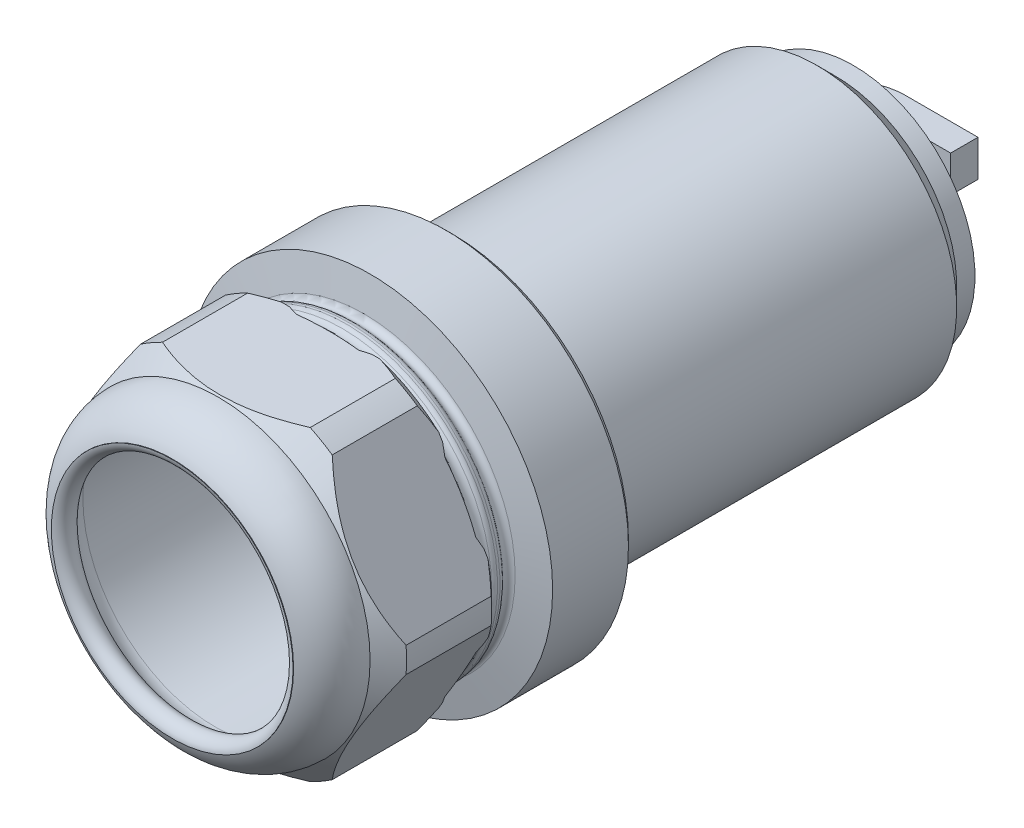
ISO-10303-21;
HEADER;
FILE_DESCRIPTION(('STEP AP214'),'2;1');
FILE_NAME('part.step','',(''),(''),'','','');
FILE_SCHEMA(('AUTOMOTIVE_DESIGN { 1 0 10303 214 1 1 1 1 }'));
ENDSEC;
DATA;
#1=APPLICATION_CONTEXT('core data for automotive mechanical design processes');
#2=APPLICATION_PROTOCOL_DEFINITION('international standard','automotive_design',2000,#1);
#3=PRODUCT_CONTEXT('',#1,'mechanical');
#4=PRODUCT('Part','Part','',(#3));
#5=PRODUCT_RELATED_PRODUCT_CATEGORY('part','',(#4));
#6=PRODUCT_DEFINITION_FORMATION('','',#4);
#7=PRODUCT_DEFINITION_CONTEXT('part definition',#1,'design');
#8=PRODUCT_DEFINITION('design','',#6,#7);
#9=PRODUCT_DEFINITION_SHAPE('','',#8);
#10=(LENGTH_UNIT() NAMED_UNIT(*) SI_UNIT(.MILLI.,.METRE.));
#11=(NAMED_UNIT(*) PLANE_ANGLE_UNIT() SI_UNIT($,.RADIAN.));
#12=(NAMED_UNIT(*) SI_UNIT($,.STERADIAN.) SOLID_ANGLE_UNIT());
#13=UNCERTAINTY_MEASURE_WITH_UNIT(LENGTH_MEASURE(1.E-05),#10,'distance_accuracy_value','');
#14=(GEOMETRIC_REPRESENTATION_CONTEXT(3) GLOBAL_UNCERTAINTY_ASSIGNED_CONTEXT((#13)) GLOBAL_UNIT_ASSIGNED_CONTEXT((#10,
#11,#12)) REPRESENTATION_CONTEXT('',''));
#15=CARTESIAN_POINT('',(0.,0.,0.));
#16=DIRECTION('',(0.,0.,1.));
#17=DIRECTION('',(1.,0.,0.));
#18=AXIS2_PLACEMENT_3D('',#15,#16,#17);
#19=CARTESIAN_POINT('',(0.,0.,79.1201861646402));
#20=DIRECTION('',(0.,0.,-1.));
#21=DIRECTION('',(-1.,0.,0.));
#22=AXIS2_PLACEMENT_3D('',#19,#20,#21);
#23=CONICAL_SURFACE('',#22,31.7465084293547,0.68429479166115);
#24=CARTESIAN_POINT('',(0.,0.,86.));
#25=DIRECTION('',(0.,0.,-1.));
#26=DIRECTION('',(-1.,0.,0.));
#27=AXIS2_PLACEMENT_3D('',#24,#25,#26);
#28=CIRCLE('',#27,26.1340287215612);
#29=CARTESIAN_POINT('',(-25.2605901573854,6.70000314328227,86.));
#30=VERTEX_POINT('',#29);
#31=CARTESIAN_POINT('',(-25.2605901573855,-6.70000314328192,86.));
#32=VERTEX_POINT('',#31);
#33=EDGE_CURVE('E502',#30,#32,#28,.F.);
#34=ORIENTED_EDGE('',*,*,#33,.F.);
#35=CARTESIAN_POINT('',(-35.8002090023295,-11.5551521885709,71.9218542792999));
#36=CARTESIAN_POINT('',(-35.6286734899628,-11.2580439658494,72.2338203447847));
#37=CARTESIAN_POINT('',(-35.456498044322,-10.9598273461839,72.5443773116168));
#38=CARTESIAN_POINT('',(-35.1107544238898,-10.3609818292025,73.1623899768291));
#39=CARTESIAN_POINT('',(-34.9371862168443,-10.0603528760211,73.4698456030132));
#40=CARTESIAN_POINT('',(-34.4141185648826,-9.15437312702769,74.3873186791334));
#41=CARTESIAN_POINT('',(-34.0623706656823,-8.54512789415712,74.9922332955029));
#42=CARTESIAN_POINT('',(-33.3471050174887,-7.30625145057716,76.1934834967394));
#43=CARTESIAN_POINT('',(-32.9834925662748,-6.67645621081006,76.7895939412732));
#44=CARTESIAN_POINT('',(-32.2478598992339,-5.40230305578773,77.9606493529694));
#45=CARTESIAN_POINT('',(-31.8758406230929,-4.75794676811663,78.5355966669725));
#46=CARTESIAN_POINT('',(-31.2954713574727,-3.75271771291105,79.4002729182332));
#47=CARTESIAN_POINT('',(-31.0906308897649,-3.39792361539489,79.6994368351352));
#48=CARTESIAN_POINT('',(-30.6777999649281,-2.68287947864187,80.2889292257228));
#49=CARTESIAN_POINT('',(-30.4698096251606,-2.32262964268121,80.5792580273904));
#50=CARTESIAN_POINT('',(-30.050310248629,-1.59603540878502,81.1499596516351));
#51=CARTESIAN_POINT('',(-29.8387998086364,-1.22968858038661,81.4303283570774));
#52=CARTESIAN_POINT('',(-29.4120669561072,-0.49056559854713,81.9794940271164));
#53=CARTESIAN_POINT('',(-29.1968447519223,-0.117789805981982,82.2482916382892));
#54=CARTESIAN_POINT('',(-28.7635734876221,0.63265803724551,82.7711726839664));
#55=CARTESIAN_POINT('',(-28.5455465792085,1.01029172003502,83.0253291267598));
#56=CARTESIAN_POINT('',(-28.1052679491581,1.77287667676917,83.5185054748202));
#57=CARTESIAN_POINT('',(-27.8830160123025,2.15782832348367,83.7575246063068));
#58=CARTESIAN_POINT('',(-27.2098577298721,3.32377267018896,84.4481785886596));
#59=CARTESIAN_POINT('',(-26.7520711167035,4.11668234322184,84.873997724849));
#60=CARTESIAN_POINT('',(-26.1097557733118,5.22920515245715,85.3966890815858));
#61=CARTESIAN_POINT('',(-25.9331133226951,5.53515885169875,85.5329198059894));
#62=CARTESIAN_POINT('',(-25.5772354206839,6.15155745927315,85.7911672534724));
#63=CARTESIAN_POINT('',(-25.3980000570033,6.46200221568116,85.9131844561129));
#64=CARTESIAN_POINT('',(-25.0370025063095,7.08726831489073,86.1416894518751));
#65=CARTESIAN_POINT('',(-24.8552395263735,7.40209103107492,86.2481722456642));
#66=CARTESIAN_POINT('',(-24.4894483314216,8.035659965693,86.4442160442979));
#67=CARTESIAN_POINT('',(-24.3054202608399,8.35440593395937,86.5337781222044));
#68=CARTESIAN_POINT('',(-23.938796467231,8.98941697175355,86.6932372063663));
#69=CARTESIAN_POINT('',(-23.7562370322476,9.30561918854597,86.7634667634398));
#70=CARTESIAN_POINT('',(-23.3895702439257,9.94070469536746,86.8853590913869));
#71=CARTESIAN_POINT('',(-23.2054629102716,10.2595879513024,86.9370220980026));
#72=CARTESIAN_POINT('',(-22.8361629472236,10.8992342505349,87.0209415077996));
#73=CARTESIAN_POINT('',(-22.6509704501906,11.2199970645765,87.0532002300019));
#74=CARTESIAN_POINT('',(-22.2799831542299,11.862565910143,87.0977705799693));
#75=CARTESIAN_POINT('',(-22.0941883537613,12.1843719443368,87.1100821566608));
#76=CARTESIAN_POINT('',(-21.7205082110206,12.8316049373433,87.114565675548));
#77=CARTESIAN_POINT('',(-21.532622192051,13.1570330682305,87.1065162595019));
#78=CARTESIAN_POINT('',(-21.1573506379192,13.8070224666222,87.0699551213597));
#79=CARTESIAN_POINT('',(-20.9699651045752,14.1315837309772,87.041443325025));
#80=CARTESIAN_POINT('',(-20.5962101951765,14.7789462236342,86.9644550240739));
#81=CARTESIAN_POINT('',(-20.4098409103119,15.1017472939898,86.9159767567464));
#82=CARTESIAN_POINT('',(-20.0386058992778,15.7447451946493,86.7998669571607));
#83=CARTESIAN_POINT('',(-19.8537401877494,16.0649419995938,86.732235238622));
#84=CARTESIAN_POINT('',(-19.4843834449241,16.7046866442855,86.5782351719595));
#85=CARTESIAN_POINT('',(-19.2999080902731,17.0242073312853,86.4917168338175));
#86=CARTESIAN_POINT('',(-18.933172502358,17.6594120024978,86.3015184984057));
#87=CARTESIAN_POINT('',(-18.7509126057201,17.9750954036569,86.19783592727));
#88=CARTESIAN_POINT('',(-18.2078210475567,18.9157575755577,85.8630436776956));
#89=CARTESIAN_POINT('',(-17.8506092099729,19.5344666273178,85.6081601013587));
#90=CARTESIAN_POINT('',(-17.1773120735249,20.7006514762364,85.0702488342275));
#91=CARTESIAN_POINT('',(-16.8603416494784,21.2496603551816,84.7915612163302));
#92=CARTESIAN_POINT('',(-16.2349737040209,22.3328294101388,84.1977366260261));
#93=CARTESIAN_POINT('',(-15.9265790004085,22.8669847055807,83.8825878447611));
#94=CARTESIAN_POINT('',(-15.3175983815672,23.9217700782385,83.2218997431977));
#95=CARTESIAN_POINT('',(-15.0170227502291,24.4423823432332,82.8763227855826));
#96=CARTESIAN_POINT('',(-14.4234067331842,25.4705554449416,82.1604314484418));
#97=CARTESIAN_POINT('',(-14.1303656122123,25.978117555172,81.7901194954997));
#98=CARTESIAN_POINT('',(-13.5499390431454,26.9834458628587,81.0275539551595));
#99=CARTESIAN_POINT('',(-13.2625793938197,27.4811673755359,80.6352221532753));
#100=CARTESIAN_POINT('',(-12.6939284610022,28.4660996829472,79.833375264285));
#101=CARTESIAN_POINT('',(-12.4126373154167,28.9533102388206,79.4238597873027));
#102=CARTESIAN_POINT('',(-11.8556478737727,29.9180442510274,78.5907372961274));
#103=CARTESIAN_POINT('',(-11.5799457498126,30.3955743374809,78.1671404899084));
#104=CARTESIAN_POINT('',(-11.0333251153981,31.3423490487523,77.3078312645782));
#105=CARTESIAN_POINT('',(-10.7624064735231,31.8115939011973,76.8721191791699));
#106=CARTESIAN_POINT('',(-10.2708457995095,32.6630019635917,76.0658893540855));
#107=CARTESIAN_POINT('',(-10.0495398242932,33.046315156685,75.6969866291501));
#108=CARTESIAN_POINT('',(-9.60956628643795,33.808371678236,74.9529456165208));
#109=CARTESIAN_POINT('',(-9.39089872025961,34.1871150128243,74.5778073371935));
#110=CARTESIAN_POINT('',(-8.95781327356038,34.9372410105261,73.8252532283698));
#111=CARTESIAN_POINT('',(-8.74337505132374,35.3086589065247,73.4478841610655));
#112=CARTESIAN_POINT('',(-8.31665127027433,36.0477661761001,72.6883344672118));
#113=CARTESIAN_POINT('',(-8.10436564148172,36.4154556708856,72.3061539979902));
#114=CARTESIAN_POINT('',(-7.89304916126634,36.7814665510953,71.9218542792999));
#115=B_SPLINE_CURVE_WITH_KNOTS('',3,(#35,#36,#37,#38,#39,#40,#41,#42,#43,#44,#45,#46,#47,#48,
#49,#50,#51,#52,#53,#54,#55,#56,#57,#58,#59,#60,#61,#62,#63,#64,#65,#66,#67,#68,#69,#70,#71,#72,
#73,#74,#75,#76,#77,#78,#79,#80,#81,#82,#83,#84,#85,#86,#87,#88,#89,#90,#91,#92,#93,#94,#95,#96,
#97,#98,#99,#100,#101,#102,#103,#104,#105,#106,#107,#108,#109,#110,#111,#112,#113,#114),
.UNSPECIFIED.,.F.,.F.,(4,2,2,2,2,2,2,2,2,2,2,2,2,2,2,2,2,2,2,2,2,2,2,2,2,2,2,2,2,2,2,2,2,2,2,2,
2,2,2,4),(0.,1.39110136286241,2.78223503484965,5.56543274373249,8.38610048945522,
11.2064544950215,12.7282131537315,14.2499152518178,15.7722392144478,17.2944780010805,
18.8083170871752,20.3222334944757,23.3467074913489,24.4824082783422,25.618070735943,
26.7540978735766,27.8900529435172,29.0050345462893,30.1200019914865,31.2348361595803,
32.3496731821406,33.4766823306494,34.6036955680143,35.7308083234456,36.8579320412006,
37.9943555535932,39.1309496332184,41.4037201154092,43.4799430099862,45.5568402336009,
47.6363435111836,49.7156430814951,51.8028639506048,53.890132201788,55.9759189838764,
58.0616483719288,59.7901566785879,61.5186626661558,63.2324166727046,64.9461147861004),.UNSPECIFIED.);
#116=CARTESIAN_POINT('',(-24.3892299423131,8.20924330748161,86.4906565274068));
#117=VERTEX_POINT('',#116);
#118=EDGE_CURVE('E432',#30,#117,#115,.T.);
#119=ORIENTED_EDGE('',*,*,#118,.T.);
#120=CARTESIAN_POINT('',(0.,0.,86.4906565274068));
#121=DIRECTION('',(0.,0.,1.));
#122=DIRECTION('',(1.,0.,0.));
#123=AXIS2_PLACEMENT_3D('',#120,#121,#122);
#124=CIRCLE('',#123,25.7337562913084);
#125=CARTESIAN_POINT('',(-24.3892299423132,-8.20924330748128,86.4906565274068));
#126=VERTEX_POINT('',#125);
#127=EDGE_CURVE('E504',#117,#126,#124,.T.);
#128=ORIENTED_EDGE('',*,*,#127,.T.);
#129=CARTESIAN_POINT('',(-7.8930491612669,-36.7814665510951,71.9218542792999));
#130=CARTESIAN_POINT('',(-8.06458467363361,-36.4843583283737,72.2338203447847));
#131=CARTESIAN_POINT('',(-8.23676011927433,-36.1861417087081,72.5443773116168));
#132=CARTESIAN_POINT('',(-8.58250373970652,-35.5872961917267,73.1623899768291));
#133=CARTESIAN_POINT('',(-8.75607194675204,-35.2866672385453,73.4698456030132));
#134=CARTESIAN_POINT('',(-9.27913959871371,-34.3806874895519,74.3873186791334));
#135=CARTESIAN_POINT('',(-9.63088749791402,-33.7714422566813,74.9922332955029));
#136=CARTESIAN_POINT('',(-10.3461531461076,-32.5325658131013,76.1934834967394));
#137=CARTESIAN_POINT('',(-10.7097655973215,-31.9027705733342,76.7895939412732));
#138=CARTESIAN_POINT('',(-11.4453982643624,-30.6286174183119,77.9606493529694));
#139=CARTESIAN_POINT('',(-11.8174175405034,-29.9842611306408,78.5355966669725));
#140=CARTESIAN_POINT('',(-12.3977868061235,-28.9790320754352,79.4002729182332));
#141=CARTESIAN_POINT('',(-12.6026272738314,-28.624237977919,79.6994368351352));
#142=CARTESIAN_POINT('',(-13.0154581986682,-27.909193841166,80.2889292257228));
#143=CARTESIAN_POINT('',(-13.2234485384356,-27.5489440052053,80.5792580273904));
#144=CARTESIAN_POINT('',(-13.6429479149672,-26.8223497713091,81.1499596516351));
#145=CARTESIAN_POINT('',(-13.8544583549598,-26.4560029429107,81.4303283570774));
#146=CARTESIAN_POINT('',(-14.281191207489,-25.7168799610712,81.9794940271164));
#147=CARTESIAN_POINT('',(-14.4964134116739,-25.3441041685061,82.2482916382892));
#148=CARTESIAN_POINT('',(-14.9296846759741,-24.5936563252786,82.7711726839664));
#149=CARTESIAN_POINT('',(-15.1477115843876,-24.2160226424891,83.0253291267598));
#150=CARTESIAN_POINT('',(-15.5879902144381,-23.4534376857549,83.5185054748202));
#151=CARTESIAN_POINT('',(-15.8102421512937,-23.0684860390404,83.7575246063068));
#152=CARTESIAN_POINT('',(-16.4834004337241,-21.9025416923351,84.4481785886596));
#153=CARTESIAN_POINT('',(-16.9411870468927,-21.1096320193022,84.8739977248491));
#154=CARTESIAN_POINT('',(-17.5835023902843,-19.9971092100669,85.3966890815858));
#155=CARTESIAN_POINT('',(-17.760144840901,-19.6911555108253,85.5329198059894));
#156=CARTESIAN_POINT('',(-18.1160227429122,-19.0747569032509,85.7911672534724));
#157=CARTESIAN_POINT('',(-18.2952581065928,-18.7643121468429,85.9131844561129));
#158=CARTESIAN_POINT('',(-18.6562556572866,-18.1390460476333,86.1416894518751));
#159=CARTESIAN_POINT('',(-18.8380186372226,-17.8242233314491,86.2481722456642));
#160=CARTESIAN_POINT('',(-19.2038098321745,-17.190654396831,86.4442160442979));
#161=CARTESIAN_POINT('',(-19.3878379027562,-16.8719084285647,86.5337781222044));
#162=CARTESIAN_POINT('',(-19.7544616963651,-16.2368973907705,86.6932372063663));
#163=CARTESIAN_POINT('',(-19.9370211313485,-15.9206951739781,86.7634667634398));
#164=CARTESIAN_POINT('',(-20.3036879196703,-15.2856096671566,86.8853590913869));
#165=CARTESIAN_POINT('',(-20.4877952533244,-14.9667264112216,86.9370220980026));
#166=CARTESIAN_POINT('',(-20.8570952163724,-14.3270801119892,87.0209415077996));
#167=CARTESIAN_POINT('',(-21.0422877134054,-14.0063172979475,87.0532002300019));
#168=CARTESIAN_POINT('',(-21.4132750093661,-13.363748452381,87.0977705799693));
#169=CARTESIAN_POINT('',(-21.5990698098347,-13.0419424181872,87.1100821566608));
#170=CARTESIAN_POINT('',(-21.9727499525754,-12.3947094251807,87.114565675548));
#171=CARTESIAN_POINT('',(-22.160635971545,-12.0692812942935,87.1065162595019));
#172=CARTESIAN_POINT('',(-22.5359075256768,-11.4192918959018,87.0699551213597));
#173=CARTESIAN_POINT('',(-22.7232930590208,-11.0947306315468,87.041443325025));
#174=CARTESIAN_POINT('',(-23.0970479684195,-10.4473681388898,86.9644550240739));
#175=CARTESIAN_POINT('',(-23.283417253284,-10.1245670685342,86.9159767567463));
#176=CARTESIAN_POINT('',(-23.6546522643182,-9.48156916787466,86.7998669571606));
#177=CARTESIAN_POINT('',(-23.8395179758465,-9.1613723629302,86.732235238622));
#178=CARTESIAN_POINT('',(-24.2088747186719,-8.52162771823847,86.5782351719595));
#179=CARTESIAN_POINT('',(-24.3933500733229,-8.20210703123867,86.4917168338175));
#180=CARTESIAN_POINT('',(-24.7600856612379,-7.5669023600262,86.3015184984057));
#181=CARTESIAN_POINT('',(-24.9423455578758,-7.25121895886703,86.19783592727));
#182=CARTESIAN_POINT('',(-25.4854371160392,-6.31055678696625,85.8630436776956));
#183=CARTESIAN_POINT('',(-25.842648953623,-5.69184773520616,85.6081601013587));
#184=CARTESIAN_POINT('',(-26.515946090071,-4.52566288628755,85.0702488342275));
#185=CARTESIAN_POINT('',(-26.8329165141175,-3.97665400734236,84.7915612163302));
#186=CARTESIAN_POINT('',(-27.4582844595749,-2.89348495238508,84.1977366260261));
#187=CARTESIAN_POINT('',(-27.7666791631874,-2.3593296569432,83.8825878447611));
#188=CARTESIAN_POINT('',(-28.3756597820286,-1.30454428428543,83.2218997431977));
#189=CARTESIAN_POINT('',(-28.6762354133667,-0.78393201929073,82.8763227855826));
#190=CARTESIAN_POINT('',(-29.2698514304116,0.244241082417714,82.1604314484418));
#191=CARTESIAN_POINT('',(-29.5628925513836,0.751803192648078,81.7901194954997));
#192=CARTESIAN_POINT('',(-30.1433191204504,1.75713150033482,81.0275539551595));
#193=CARTESIAN_POINT('',(-30.4306787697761,2.25485301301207,80.6352221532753));
#194=CARTESIAN_POINT('',(-30.9993297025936,3.23978532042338,79.8333752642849));
#195=CARTESIAN_POINT('',(-31.2806208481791,3.72699587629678,79.4238597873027));
#196=CARTESIAN_POINT('',(-31.8376102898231,4.69172988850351,78.5907372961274));
#197=CARTESIAN_POINT('',(-32.1133124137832,5.16925997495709,78.1671404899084));
#198=CARTESIAN_POINT('',(-32.6599330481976,6.11603468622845,77.3078312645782));
#199=CARTESIAN_POINT('',(-32.9308516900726,6.5852795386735,76.8721191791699));
#200=CARTESIAN_POINT('',(-33.4224123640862,7.43668760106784,76.0658893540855));
#201=CARTESIAN_POINT('',(-33.6437183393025,7.82000079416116,75.6969866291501));
#202=CARTESIAN_POINT('',(-34.0836918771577,8.58205731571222,74.9529456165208));
#203=CARTESIAN_POINT('',(-34.3023594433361,8.96080065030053,74.5778073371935));
#204=CARTESIAN_POINT('',(-34.7354448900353,9.71092664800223,73.8252532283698));
#205=CARTESIAN_POINT('',(-34.9498831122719,10.0823445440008,73.4478841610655));
#206=CARTESIAN_POINT('',(-35.3766068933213,10.8214518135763,72.6883344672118));
#207=CARTESIAN_POINT('',(-35.5888925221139,11.1891413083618,72.3061539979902));
#208=CARTESIAN_POINT('',(-35.8002090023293,11.5551521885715,71.9218542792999));
#209=B_SPLINE_CURVE_WITH_KNOTS('',3,(#129,#130,#131,#132,#133,#134,#135,#136,#137,#138,#139,
#140,#141,#142,#143,#144,#145,#146,#147,#148,#149,#150,#151,#152,#153,#154,#155,#156,#157,#158,
#159,#160,#161,#162,#163,#164,#165,#166,#167,#168,#169,#170,#171,#172,#173,#174,#175,#176,#177,
#178,#179,#180,#181,#182,#183,#184,#185,#186,#187,#188,#189,#190,#191,#192,#193,#194,#195,#196,
#197,#198,#199,#200,#201,#202,#203,#204,#205,#206,#207,#208),.UNSPECIFIED.,.F.,.F.,(4,2,2,2,2,2,
2,2,2,2,2,2,2,2,2,2,2,2,2,2,2,2,2,2,2,2,2,2,2,2,2,2,2,2,2,2,2,2,2,4),(0.,1.39110136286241,
2.78223503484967,5.5654327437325,8.38610048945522,11.2064544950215,12.7282131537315,
14.2499152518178,15.7722392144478,17.2944780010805,18.8083170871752,20.3222334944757,
23.3467074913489,24.4824082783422,25.6180707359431,26.7540978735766,27.8900529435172,
29.0050345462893,30.1200019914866,31.2348361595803,32.3496731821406,33.4766823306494,
34.6036955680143,35.7308083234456,36.8579320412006,37.9943555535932,39.1309496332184,
41.4037201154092,43.4799430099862,45.556840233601,47.6363435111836,49.7156430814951,
51.8028639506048,53.890132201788,55.9759189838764,58.0616483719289,59.790156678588,
61.5186626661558,63.2324166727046,64.9461147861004),.UNSPECIFIED.);
#210=EDGE_CURVE('E402',#126,#32,#209,.T.);
#211=ORIENTED_EDGE('',*,*,#210,.T.);
#212=EDGE_LOOP('',(#34,#119,#128,#211));
#213=FACE_BOUND('',#212,.T.);
#214=ADVANCED_FACE('F26',(#213),#23,.F.);
#215=CARTESIAN_POINT('',(-5.08520172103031,25.226314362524,86.4906565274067));
#216=VERTEX_POINT('',#215);
#217=CARTESIAN_POINT('',(-19.3040282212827,17.0170710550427,86.4906565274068));
#218=VERTEX_POINT('',#217);
#219=EDGE_CURVE('E516',#216,#218,#124,.T.);
#220=ORIENTED_EDGE('',*,*,#219,.T.);
#221=CARTESIAN_POINT('',(-18.4326680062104,18.5263112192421,86.));
#222=VERTEX_POINT('',#221);
#223=EDGE_CURVE('E433',#218,#222,#115,.T.);
#224=ORIENTED_EDGE('',*,*,#223,.T.);
#225=CARTESIAN_POINT('',(-6.82792215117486,25.226314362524,86.));
#226=VERTEX_POINT('',#225);
#227=EDGE_CURVE('E548',#226,#222,#28,.F.);
#228=ORIENTED_EDGE('',*,*,#227,.F.);
#229=CARTESIAN_POINT('',(-26.7341281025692,25.226314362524,72.978235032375));
#230=CARTESIAN_POINT('',(-26.3942387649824,25.226314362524,73.2812545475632));
#231=CARTESIAN_POINT('',(-26.0530043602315,25.226314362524,73.5827708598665));
#232=CARTESIAN_POINT('',(-25.3676097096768,25.226314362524,74.1824776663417));
#233=CARTESIAN_POINT('',(-25.0234493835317,25.226314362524,74.480668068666));
#234=CARTESIAN_POINT('',(-24.3318438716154,25.226314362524,75.0735086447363));
#235=CARTESIAN_POINT('',(-23.9843973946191,25.226314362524,75.3681573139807));
#236=CARTESIAN_POINT('',(-23.286109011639,25.226314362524,75.9533962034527));
#237=CARTESIAN_POINT('',(-22.9352671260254,25.226314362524,76.2439864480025));
#238=CARTESIAN_POINT('',(-21.8663399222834,25.226314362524,77.1179497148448));
#239=CARTESIAN_POINT('',(-21.1425107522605,25.226314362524,77.6943362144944));
#240=CARTESIAN_POINT('',(-19.6771785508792,25.226314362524,78.8241351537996));
#241=CARTESIAN_POINT('',(-18.9356777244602,25.226314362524,79.3775504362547));
#242=CARTESIAN_POINT('',(-17.7813718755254,25.226314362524,80.2049223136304));
#243=CARTESIAN_POINT('',(-17.3759696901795,25.226314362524,80.4892201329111));
#244=CARTESIAN_POINT('',(-16.5586958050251,25.226314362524,81.0483456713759));
#245=CARTESIAN_POINT('',(-16.1468243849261,25.226314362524,81.3231737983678));
#246=CARTESIAN_POINT('',(-15.3158792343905,25.226314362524,81.8621555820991));
#247=CARTESIAN_POINT('',(-14.8968023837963,25.226314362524,82.1263044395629));
#248=CARTESIAN_POINT('',(-14.0511135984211,25.226314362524,82.6422100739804));
#249=CARTESIAN_POINT('',(-13.6245021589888,25.226314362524,82.8939676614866));
#250=CARTESIAN_POINT('',(-12.765900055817,25.226314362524,83.3817456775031));
#251=CARTESIAN_POINT('',(-12.3339606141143,25.226314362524,83.6178557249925));
#252=CARTESIAN_POINT('',(-11.4616905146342,25.226314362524,84.0739701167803));
#253=CARTESIAN_POINT('',(-11.0213593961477,25.226314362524,84.2939735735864));
#254=CARTESIAN_POINT('',(-9.68788989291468,25.226314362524,84.9259898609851));
#255=CARTESIAN_POINT('',(-8.78122062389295,25.226314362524,85.310620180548));
#256=CARTESIAN_POINT('',(-7.51514946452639,25.226314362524,85.7721454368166));
#257=CARTESIAN_POINT('',(-7.17052378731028,25.226314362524,85.8903437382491));
#258=CARTESIAN_POINT('',(-6.47666458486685,25.226314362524,86.1124276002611));
#259=CARTESIAN_POINT('',(-6.12743125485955,25.226314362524,86.2163137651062));
#260=CARTESIAN_POINT('',(-5.42457609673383,25.226314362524,86.4086094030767));
#261=CARTESIAN_POINT('',(-5.07095262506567,25.226314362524,86.4970128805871));
#262=CARTESIAN_POINT('',(-4.35995486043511,25.226314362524,86.6571524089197));
#263=CARTESIAN_POINT('',(-4.00258077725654,25.226314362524,86.7288893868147));
#264=CARTESIAN_POINT('',(-3.29092899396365,25.226314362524,86.8535954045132));
#265=CARTESIAN_POINT('',(-2.93670456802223,25.226314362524,86.9068674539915));
#266=CARTESIAN_POINT('',(-2.22602041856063,25.226314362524,86.9955480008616));
#267=CARTESIAN_POINT('',(-1.86956072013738,25.226314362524,87.0309566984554));
#268=CARTESIAN_POINT('',(-1.15531860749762,25.226314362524,87.0833534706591));
#269=CARTESIAN_POINT('',(-0.797536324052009,25.226314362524,87.100343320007));
#270=CARTESIAN_POINT('',(-0.0815700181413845,25.226314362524,87.1156332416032));
#271=CARTESIAN_POINT('',(0.276614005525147,25.226314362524,87.1139332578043));
#272=CARTESIAN_POINT('',(0.994780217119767,25.226314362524,87.0917974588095));
#273=CARTESIAN_POINT('',(1.35475856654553,25.226314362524,87.0712374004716));
#274=CARTESIAN_POINT('',(2.07316429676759,25.226314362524,87.0115431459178));
#275=CARTESIAN_POINT('',(2.43159167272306,25.226314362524,86.9724088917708));
#276=CARTESIAN_POINT('',(3.14602829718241,25.226314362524,86.8761777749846));
#277=CARTESIAN_POINT('',(3.50203750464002,25.226314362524,86.8190806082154));
#278=CARTESIAN_POINT('',(4.21090417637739,25.226314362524,86.6877738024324));
#279=CARTESIAN_POINT('',(4.56376117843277,25.226314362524,86.6135616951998));
#280=CARTESIAN_POINT('',(5.6222718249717,25.226314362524,86.3654142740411));
#281=CARTESIAN_POINT('',(6.32223335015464,25.226314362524,86.1667513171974));
#282=CARTESIAN_POINT('',(7.7034272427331,25.226314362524,85.7133194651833));
#283=CARTESIAN_POINT('',(8.38465773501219,25.226314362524,85.458544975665));
#284=CARTESIAN_POINT('',(9.7263720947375,25.226314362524,84.9028380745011));
#285=CARTESIAN_POINT('',(10.3868920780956,25.226314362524,84.6019920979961));
#286=CARTESIAN_POINT('',(11.6892599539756,25.226314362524,83.9620405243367));
#287=CARTESIAN_POINT('',(12.3311008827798,25.226314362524,83.6229208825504));
#288=CARTESIAN_POINT('',(13.5981073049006,25.226314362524,82.9130175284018));
#289=CARTESIAN_POINT('',(14.2232478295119,25.226314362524,82.5421895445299));
#290=CARTESIAN_POINT('',(15.457498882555,25.226314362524,81.7750372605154));
#291=CARTESIAN_POINT('',(16.0666112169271,25.226314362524,81.3787158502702));
#292=CARTESIAN_POINT('',(17.2721840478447,25.226314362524,80.5640252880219));
#293=CARTESIAN_POINT('',(17.8686070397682,25.226314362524,80.1456008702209));
#294=CARTESIAN_POINT('',(19.0488022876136,25.226314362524,79.2913011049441));
#295=CARTESIAN_POINT('',(19.6325742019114,25.226314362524,78.8554252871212));
#296=CARTESIAN_POINT('',(20.788493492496,25.226314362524,77.9694783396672));
#297=CARTESIAN_POINT('',(21.3606495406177,25.226314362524,77.5194184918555));
#298=CARTESIAN_POINT('',(22.4951094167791,25.226314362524,76.607108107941));
#299=CARTESIAN_POINT('',(23.0574135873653,25.226314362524,76.1448579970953));
#300=CARTESIAN_POINT('',(23.8794893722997,25.226314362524,75.4561747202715));
#301=CARTESIAN_POINT('',(24.1426356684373,25.226314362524,75.2337525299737));
#302=CARTESIAN_POINT('',(24.6670917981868,25.226314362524,74.7867522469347));
#303=CARTESIAN_POINT('',(24.9284016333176,25.226314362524,74.5621741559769));
#304=CARTESIAN_POINT('',(25.4480469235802,25.226314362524,74.1120931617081));
#305=CARTESIAN_POINT('',(25.7063906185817,25.226314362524,73.8865997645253));
#306=CARTESIAN_POINT('',(26.2214537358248,25.226314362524,73.4337678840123));
#307=CARTESIAN_POINT('',(26.4781731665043,25.226314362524,73.2064294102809));
#308=CARTESIAN_POINT('',(26.7341281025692,25.226314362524,72.978235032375));
#309=B_SPLINE_CURVE_WITH_KNOTS('',3,(#229,#230,#231,#232,#233,#234,#235,#236,#237,#238,#239,
#240,#241,#242,#243,#244,#245,#246,#247,#248,#249,#250,#251,#252,#253,#254,#255,#256,#257,#258,
#259,#260,#261,#262,#263,#264,#265,#266,#267,#268,#269,#270,#271,#272,#273,#274,#275,#276,#277,
#278,#279,#280,#281,#282,#283,#284,#285,#286,#287,#288,#289,#290,#291,#292,#293,#294,#295,#296,
#297,#298,#299,#300,#301,#302,#303,#304,#305,#306,#307,#308),.UNSPECIFIED.,.F.,.F.,(4,2,2,2,2,2,
2,2,2,2,2,2,2,2,2,2,2,2,2,2,2,2,2,2,2,2,2,2,2,2,2,2,2,2,2,2,2,2,2,4),(0.,1.36605721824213,
2.73215206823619,4.09880805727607,5.46545585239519,8.24093673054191,11.0160730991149,
12.5014221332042,13.9867071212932,15.4726523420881,16.9585002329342,18.434932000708,
19.9114450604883,22.8608220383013,23.9535911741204,25.0463141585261,26.1394593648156,
27.2325437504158,28.3067315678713,29.3809073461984,30.4549796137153,31.5290551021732,
32.6102574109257,33.6914630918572,34.7726870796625,35.854067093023,38.0338166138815,
40.213783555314,42.3897096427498,44.5664368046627,46.7462543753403,48.92582527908,
51.1111308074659,53.2964952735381,55.4801633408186,57.6637553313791,58.6974092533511,
59.7310623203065,60.7597899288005,61.7885121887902),.UNSPECIFIED.);
#310=EDGE_CURVE('E719',#226,#216,#309,.T.);
#311=ORIENTED_EDGE('',*,*,#310,.T.);
#312=EDGE_LOOP('',(#220,#224,#228,#311));
#313=FACE_BOUND('',#312,.T.);
#314=ADVANCED_FACE('F359',(#313),#23,.F.);
#315=CARTESIAN_POINT('',(0.,0.,86.));
#316=DIRECTION('',(0.,0.,1.));
#317=DIRECTION('',(1.,0.,0.));
#318=AXIS2_PLACEMENT_3D('',#315,#316,#317);
#319=CONICAL_SURFACE('',#318,24.8609374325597,1.05867155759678);
#320=CARTESIAN_POINT('',(0.,0.,86.));
#321=DIRECTION('',(0.,0.,1.));
#322=DIRECTION('',(1.,0.,0.));
#323=AXIS2_PLACEMENT_3D('',#320,#321,#322);
#324=CIRCLE('',#323,24.8609374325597);
#325=CARTESIAN_POINT('',(24.8609374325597,0.,86.));
#326=VERTEX_POINT('',#325);
#327=EDGE_CURVE('E523',#326,#326,#324,.T.);
#328=ORIENTED_EDGE('',*,*,#327,.T.);
#329=EDGE_LOOP('',(#328));
#330=FACE_BOUND('',#329,.T.);
#331=CARTESIAN_POINT('',(-19.3031281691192,17.0186299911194,86.4908565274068));
#332=CARTESIAN_POINT('',(-19.5145515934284,16.6524338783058,86.4438494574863));
#333=CARTESIAN_POINT('',(-19.7262908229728,16.2856907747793,86.4024385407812));
#334=CARTESIAN_POINT('',(-20.1502619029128,15.5513513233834,86.331140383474));
#335=CARTESIAN_POINT('',(-20.3624937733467,15.1837549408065,86.3012536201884));
#336=CARTESIAN_POINT('',(-20.7866275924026,14.4491336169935,86.2534142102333));
#337=CARTESIAN_POINT('',(-20.9985284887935,14.0821104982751,86.2354244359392));
#338=CARTESIAN_POINT('',(-21.4224959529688,13.3477773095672,86.2114160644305));
#339=CARTESIAN_POINT('',(-21.6345625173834,12.9804672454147,86.2053972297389));
#340=CARTESIAN_POINT('',(-22.0586956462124,12.2458471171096,86.2053972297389));
#341=CARTESIAN_POINT('',(-22.270762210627,11.8785370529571,86.2114160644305));
#342=CARTESIAN_POINT('',(-22.6947296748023,11.1442038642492,86.2354244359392));
#343=CARTESIAN_POINT('',(-22.9066305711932,10.7771807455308,86.2534142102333));
#344=CARTESIAN_POINT('',(-23.3307643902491,10.0425594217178,86.3012536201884));
#345=CARTESIAN_POINT('',(-23.542996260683,9.67496303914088,86.331140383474));
#346=CARTESIAN_POINT('',(-23.966967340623,8.94062358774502,86.4024385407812));
#347=CARTESIAN_POINT('',(-24.1787065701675,8.57388048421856,86.4438494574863));
#348=CARTESIAN_POINT('',(-24.3901299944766,8.20768437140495,86.4908565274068));
#349=B_SPLINE_CURVE_WITH_KNOTS('',3,(#331,#332,#333,#334,#335,#336,#337,#338,#339,#340,#341,
#342,#343,#344,#345,#346,#347,#348),.UNSPECIFIED.,.F.,.F.,(4,2,2,2,2,2,2,2,4),(0.,
1.27633187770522,2.55271661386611,3.82509902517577,5.0974561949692,6.36981336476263,
7.6421957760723,8.91858051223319,10.1949123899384),.UNSPECIFIED.);
#350=EDGE_CURVE('E283',#218,#117,#349,.T.);
#351=ORIENTED_EDGE('',*,*,#350,.F.);
#352=ORIENTED_EDGE('',*,*,#219,.F.);
#353=CARTESIAN_POINT('',(10.646352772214,25.226314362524,87.4165812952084));
#354=CARTESIAN_POINT('',(10.0805287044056,25.226314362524,87.2928877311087));
#355=CARTESIAN_POINT('',(9.51290548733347,25.226314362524,87.1772008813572));
#356=CARTESIAN_POINT('',(8.37426162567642,25.226314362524,86.9633201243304));
#357=CARTESIAN_POINT('',(7.80324031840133,25.226314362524,86.8651297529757));
#358=CARTESIAN_POINT('',(6.65764208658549,25.226314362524,86.6876815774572));
#359=CARTESIAN_POINT('',(6.08306211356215,25.226314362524,86.6084433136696));
#360=CARTESIAN_POINT('',(4.93148058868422,25.226314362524,86.470368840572));
#361=CARTESIAN_POINT('',(4.35447919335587,25.226314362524,86.4115313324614));
#362=CARTESIAN_POINT('',(3.21026625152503,25.226314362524,86.3162977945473));
#363=CARTESIAN_POINT('',(2.64309035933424,25.226314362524,86.2794754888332));
#364=CARTESIAN_POINT('',(1.50774887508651,25.226314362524,86.22714388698));
#365=CARTESIAN_POINT('',(0.939583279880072,25.226314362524,86.2116346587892));
#366=CARTESIAN_POINT('',(-0.196486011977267,25.226314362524,86.2022359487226));
#367=CARTESIAN_POINT('',(-0.764389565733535,25.226314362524,86.2083295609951));
#368=CARTESIAN_POINT('',(-1.89956629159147,25.226314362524,86.2419734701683));
#369=CARTESIAN_POINT('',(-2.46683943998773,25.226314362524,86.2695245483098));
#370=CARTESIAN_POINT('',(-3.85106907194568,25.226314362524,86.3624389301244));
#371=CARTESIAN_POINT('',(-4.66728298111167,25.226314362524,86.4391475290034));
#372=CARTESIAN_POINT('',(-6.29485244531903,25.226314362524,86.6333951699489));
#373=CARTESIAN_POINT('',(-7.10620740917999,25.226314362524,86.7509390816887));
#374=CARTESIAN_POINT('',(-8.72428910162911,25.226314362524,87.0232258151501));
#375=CARTESIAN_POINT('',(-9.53100311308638,25.226314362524,87.1780435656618));
#376=CARTESIAN_POINT('',(-11.1374774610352,25.226314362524,87.5203820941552));
#377=CARTESIAN_POINT('',(-11.9372371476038,25.226314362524,87.707905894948));
#378=CARTESIAN_POINT('',(-13.5542429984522,25.226314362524,88.1175120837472));
#379=CARTESIAN_POINT('',(-14.3712618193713,25.226314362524,88.3404861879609));
#380=CARTESIAN_POINT('',(-15.9979040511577,25.226314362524,88.812062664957));
#381=CARTESIAN_POINT('',(-16.8075267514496,25.226314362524,89.0606674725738));
#382=CARTESIAN_POINT('',(-18.4157681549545,25.226314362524,89.5782362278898));
#383=CARTESIAN_POINT('',(-19.2144215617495,25.226314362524,89.8470927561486));
#384=CARTESIAN_POINT('',(-20.4074967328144,25.226314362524,90.2638948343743));
#385=CARTESIAN_POINT('',(-20.8043074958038,25.226314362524,90.4050579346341));
#386=CARTESIAN_POINT('',(-21.5964152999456,25.226314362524,90.6915443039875));
#387=CARTESIAN_POINT('',(-21.9917123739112,25.226314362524,90.8368674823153));
#388=CARTESIAN_POINT('',(-22.3863000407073,25.226314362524,90.9840949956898));
#389=B_SPLINE_CURVE_WITH_KNOTS('',3,(#353,#354,#355,#356,#357,#358,#359,#360,#361,#362,#363,
#364,#365,#366,#367,#368,#369,#370,#371,#372,#373,#374,#375,#376,#377,#378,#379,#380,#381,#382,
#383,#384,#385,#386,#387,#388),.UNSPECIFIED.,.F.,.F.,(4,2,2,2,2,2,2,2,2,2,2,2,2,2,2,2,2,4),(0.,
1.73757242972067,3.4754956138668,5.21520301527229,6.95479963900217,8.65951933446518,
10.3642444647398,12.0676358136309,13.7710891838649,16.2293441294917,18.6878923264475,
21.1514246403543,23.6151847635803,26.1553870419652,28.6958308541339,31.2236382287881,
32.4871352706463,33.7506047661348),.UNSPECIFIED.);
#390=CARTESIAN_POINT('',(5.08520172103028,25.226314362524,86.4906565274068));
#391=VERTEX_POINT('',#390);
#392=EDGE_CURVE('E343',#391,#216,#389,.T.);
#393=ORIENTED_EDGE('',*,*,#392,.F.);
#394=CARTESIAN_POINT('',(19.3040282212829,17.0170710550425,86.4906565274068));
#395=VERTEX_POINT('',#394);
#396=EDGE_CURVE('E522',#395,#391,#124,.T.);
#397=ORIENTED_EDGE('',*,*,#396,.F.);
#398=CARTESIAN_POINT('',(24.3901299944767,8.20768437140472,86.4908565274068));
#399=CARTESIAN_POINT('',(24.1787065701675,8.57388048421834,86.4438494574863));
#400=CARTESIAN_POINT('',(23.9669673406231,8.94062358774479,86.4024385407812));
#401=CARTESIAN_POINT('',(23.5429962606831,9.67496303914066,86.331140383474));
#402=CARTESIAN_POINT('',(23.3307643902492,10.0425594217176,86.3012536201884));
#403=CARTESIAN_POINT('',(22.9066305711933,10.7771807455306,86.2534142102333));
#404=CARTESIAN_POINT('',(22.6947296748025,11.144203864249,86.2354244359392));
#405=CARTESIAN_POINT('',(22.2707622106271,11.8785370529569,86.2114160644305));
#406=CARTESIAN_POINT('',(22.0586956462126,12.2458471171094,86.2053972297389));
#407=CARTESIAN_POINT('',(21.6345625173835,12.9804672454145,86.2053972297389));
#408=CARTESIAN_POINT('',(21.422495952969,13.347777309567,86.2114160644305));
#409=CARTESIAN_POINT('',(20.9985284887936,14.0821104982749,86.2354244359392));
#410=CARTESIAN_POINT('',(20.7866275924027,14.4491336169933,86.2534142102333));
#411=CARTESIAN_POINT('',(20.3624937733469,15.1837549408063,86.3012536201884));
#412=CARTESIAN_POINT('',(20.1502619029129,15.5513513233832,86.331140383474));
#413=CARTESIAN_POINT('',(19.726290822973,16.2856907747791,86.4024385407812));
#414=CARTESIAN_POINT('',(19.5145515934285,16.6524338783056,86.4438494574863));
#415=CARTESIAN_POINT('',(19.3031281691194,17.0186299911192,86.4908565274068));
#416=B_SPLINE_CURVE_WITH_KNOTS('',3,(#398,#399,#400,#401,#402,#403,#404,#405,#406,#407,#408,
#409,#410,#411,#412,#413,#414,#415),.UNSPECIFIED.,.F.,.F.,(4,2,2,2,2,2,2,2,4),(0.,
1.27633187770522,2.55271661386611,3.82509902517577,5.0974561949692,6.36981336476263,
7.64219577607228,8.91858051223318,10.1949123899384),.UNSPECIFIED.);
#417=CARTESIAN_POINT('',(24.3892299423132,8.20924330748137,86.4906565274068));
#418=VERTEX_POINT('',#417);
#419=EDGE_CURVE('E372',#418,#395,#416,.T.);
#420=ORIENTED_EDGE('',*,*,#419,.F.);
#421=CARTESIAN_POINT('',(24.3892299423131,-8.20924330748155,86.4906565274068));
#422=VERTEX_POINT('',#421);
#423=EDGE_CURVE('E517',#422,#418,#124,.T.);
#424=ORIENTED_EDGE('',*,*,#423,.F.);
#425=CARTESIAN_POINT('',(19.3031281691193,-17.0186299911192,86.4908565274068));
#426=CARTESIAN_POINT('',(19.5145515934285,-16.6524338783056,86.4438494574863));
#427=CARTESIAN_POINT('',(19.7262908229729,-16.2856907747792,86.4024385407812));
#428=CARTESIAN_POINT('',(20.1502619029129,-15.5513513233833,86.331140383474));
#429=CARTESIAN_POINT('',(20.3624937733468,-15.1837549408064,86.3012536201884));
#430=CARTESIAN_POINT('',(20.7866275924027,-14.4491336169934,86.2534142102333));
#431=CARTESIAN_POINT('',(20.9985284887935,-14.082110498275,86.2354244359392));
#432=CARTESIAN_POINT('',(21.4224959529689,-13.3477773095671,86.2114160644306));
#433=CARTESIAN_POINT('',(21.6345625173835,-12.9804672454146,86.2053972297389));
#434=CARTESIAN_POINT('',(22.0586956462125,-12.2458471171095,86.2053972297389));
#435=CARTESIAN_POINT('',(22.270762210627,-11.878537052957,86.2114160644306));
#436=CARTESIAN_POINT('',(22.6947296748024,-11.1442038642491,86.2354244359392));
#437=CARTESIAN_POINT('',(22.9066305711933,-10.7771807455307,86.2534142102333));
#438=CARTESIAN_POINT('',(23.3307643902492,-10.0425594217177,86.3012536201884));
#439=CARTESIAN_POINT('',(23.5429962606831,-9.6749630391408,86.331140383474));
#440=CARTESIAN_POINT('',(23.966967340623,-8.94062358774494,86.4024385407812));
#441=CARTESIAN_POINT('',(24.1787065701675,-8.57388048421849,86.4438494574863));
#442=CARTESIAN_POINT('',(24.3901299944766,-8.20768437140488,86.4908565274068));
#443=B_SPLINE_CURVE_WITH_KNOTS('',3,(#425,#426,#427,#428,#429,#430,#431,#432,#433,#434,#435,
#436,#437,#438,#439,#440,#441,#442),.UNSPECIFIED.,.F.,.F.,(4,2,2,2,2,2,2,2,4),(0.,
1.27633187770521,2.55271661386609,3.82509902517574,5.09745619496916,6.36981336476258,
7.64219577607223,8.91858051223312,10.1949123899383),.UNSPECIFIED.);
#444=CARTESIAN_POINT('',(19.3040282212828,-17.0170710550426,86.4906565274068));
#445=VERTEX_POINT('',#444);
#446=EDGE_CURVE('E380',#445,#422,#443,.T.);
#447=ORIENTED_EDGE('',*,*,#446,.F.);
#448=CARTESIAN_POINT('',(5.08520172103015,-25.226314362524,86.4906565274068));
#449=VERTEX_POINT('',#448);
#450=EDGE_CURVE('E514',#449,#445,#124,.T.);
#451=ORIENTED_EDGE('',*,*,#450,.F.);
#452=CARTESIAN_POINT('',(-22.3863000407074,-25.2263143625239,90.9840949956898));
#453=CARTESIAN_POINT('',(-21.9917123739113,-25.2263143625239,90.8368674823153));
#454=CARTESIAN_POINT('',(-21.5964152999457,-25.2263143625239,90.6915443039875));
#455=CARTESIAN_POINT('',(-20.8043074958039,-25.2263143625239,90.4050579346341));
#456=CARTESIAN_POINT('',(-20.4074967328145,-25.2263143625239,90.2638948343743));
#457=CARTESIAN_POINT('',(-19.2144215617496,-25.2263143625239,89.8470927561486));
#458=CARTESIAN_POINT('',(-18.4157681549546,-25.2263143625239,89.5782362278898));
#459=CARTESIAN_POINT('',(-16.8075267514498,-25.2263143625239,89.0606674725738));
#460=CARTESIAN_POINT('',(-15.9979040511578,-25.2263143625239,88.812062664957));
#461=CARTESIAN_POINT('',(-14.3712618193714,-25.2263143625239,88.3404861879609));
#462=CARTESIAN_POINT('',(-13.5542429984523,-25.2263143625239,88.1175120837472));
#463=CARTESIAN_POINT('',(-11.9372371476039,-25.2263143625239,87.707905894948));
#464=CARTESIAN_POINT('',(-11.1374774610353,-25.2263143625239,87.5203820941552));
#465=CARTESIAN_POINT('',(-9.5310031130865,-25.2263143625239,87.1780435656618));
#466=CARTESIAN_POINT('',(-8.72428910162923,-25.2263143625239,87.0232258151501));
#467=CARTESIAN_POINT('',(-7.10620740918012,-25.2263143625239,86.7509390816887));
#468=CARTESIAN_POINT('',(-6.29485244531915,-25.2263143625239,86.6333951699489));
#469=CARTESIAN_POINT('',(-4.6672829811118,-25.226314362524,86.4391475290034));
#470=CARTESIAN_POINT('',(-3.85106907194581,-25.226314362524,86.3624389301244));
#471=CARTESIAN_POINT('',(-2.46683943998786,-25.226314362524,86.2695245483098));
#472=CARTESIAN_POINT('',(-1.8995662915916,-25.226314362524,86.2419734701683));
#473=CARTESIAN_POINT('',(-0.764389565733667,-25.226314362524,86.2083295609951));
#474=CARTESIAN_POINT('',(-0.1964860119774,-25.226314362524,86.2022359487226));
#475=CARTESIAN_POINT('',(0.939583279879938,-25.226314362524,86.2116346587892));
#476=CARTESIAN_POINT('',(1.50774887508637,-25.226314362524,86.22714388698));
#477=CARTESIAN_POINT('',(2.64309035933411,-25.226314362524,86.2794754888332));
#478=CARTESIAN_POINT('',(3.2102662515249,-25.226314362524,86.3162977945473));
#479=CARTESIAN_POINT('',(4.35447919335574,-25.226314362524,86.4115313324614));
#480=CARTESIAN_POINT('',(4.93148058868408,-25.226314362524,86.470368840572));
#481=CARTESIAN_POINT('',(6.08306211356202,-25.226314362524,86.6084433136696));
#482=CARTESIAN_POINT('',(6.65764208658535,-25.226314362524,86.6876815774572));
#483=CARTESIAN_POINT('',(7.8032403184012,-25.226314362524,86.8651297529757));
#484=CARTESIAN_POINT('',(8.37426162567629,-25.226314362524,86.9633201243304));
#485=CARTESIAN_POINT('',(9.51290548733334,-25.226314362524,87.1772008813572));
#486=CARTESIAN_POINT('',(10.0805287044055,-25.226314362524,87.2928877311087));
#487=CARTESIAN_POINT('',(10.6463527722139,-25.226314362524,87.4165812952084));
#488=B_SPLINE_CURVE_WITH_KNOTS('',3,(#452,#453,#454,#455,#456,#457,#458,#459,#460,#461,#462,
#463,#464,#465,#466,#467,#468,#469,#470,#471,#472,#473,#474,#475,#476,#477,#478,#479,#480,#481,
#482,#483,#484,#485,#486,#487),.UNSPECIFIED.,.F.,.F.,(4,2,2,2,2,2,2,2,2,2,2,2,2,2,2,2,2,4),(0.,
1.26346949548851,2.52696653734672,5.05477391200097,7.59521772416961,10.1354200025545,
12.5991801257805,15.0627124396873,17.5212606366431,19.9795155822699,21.6829689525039,
23.386360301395,25.0910854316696,26.7958051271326,28.5354017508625,30.275109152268,
32.0130323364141,33.7506047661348),.UNSPECIFIED.);
#489=CARTESIAN_POINT('',(-5.08520172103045,-25.2263143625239,86.4906565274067));
#490=VERTEX_POINT('',#489);
#491=EDGE_CURVE('E387',#490,#449,#488,.T.);
#492=ORIENTED_EDGE('',*,*,#491,.F.);
#493=CARTESIAN_POINT('',(-19.304028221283,-17.0170710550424,86.4906565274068));
#494=VERTEX_POINT('',#493);
#495=EDGE_CURVE('E510',#494,#490,#124,.T.);
#496=ORIENTED_EDGE('',*,*,#495,.F.);
#497=CARTESIAN_POINT('',(-24.3901299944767,-8.20768437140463,86.4908565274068));
#498=CARTESIAN_POINT('',(-24.1787065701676,-8.57388048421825,86.4438494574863));
#499=CARTESIAN_POINT('',(-23.9669673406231,-8.94062358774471,86.4024385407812));
#500=CARTESIAN_POINT('',(-23.5429962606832,-9.67496303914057,86.331140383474));
#501=CARTESIAN_POINT('',(-23.3307643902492,-10.0425594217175,86.3012536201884));
#502=CARTESIAN_POINT('',(-22.9066305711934,-10.7771807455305,86.2534142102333));
#503=CARTESIAN_POINT('',(-22.6947296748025,-11.1442038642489,86.2354244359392));
#504=CARTESIAN_POINT('',(-22.2707622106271,-11.8785370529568,86.2114160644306));
#505=CARTESIAN_POINT('',(-22.0586956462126,-12.2458471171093,86.2053972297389));
#506=CARTESIAN_POINT('',(-21.6345625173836,-12.9804672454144,86.2053972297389));
#507=CARTESIAN_POINT('',(-21.4224959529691,-13.3477773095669,86.2114160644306));
#508=CARTESIAN_POINT('',(-20.9985284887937,-14.0821104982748,86.2354244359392));
#509=CARTESIAN_POINT('',(-20.7866275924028,-14.4491336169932,86.2534142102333));
#510=CARTESIAN_POINT('',(-20.362493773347,-15.1837549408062,86.3012536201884));
#511=CARTESIAN_POINT('',(-20.150261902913,-15.5513513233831,86.331140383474));
#512=CARTESIAN_POINT('',(-19.7262908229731,-16.285690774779,86.4024385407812));
#513=CARTESIAN_POINT('',(-19.5145515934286,-16.6524338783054,86.4438494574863));
#514=CARTESIAN_POINT('',(-19.3031281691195,-17.0186299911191,86.4908565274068));
#515=B_SPLINE_CURVE_WITH_KNOTS('',3,(#497,#498,#499,#500,#501,#502,#503,#504,#505,#506,#507,
#508,#509,#510,#511,#512,#513,#514),.UNSPECIFIED.,.F.,.F.,(4,2,2,2,2,2,2,2,4),(0.,
1.27633187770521,2.55271661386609,3.82509902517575,5.09745619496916,6.36981336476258,
7.64219577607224,8.91858051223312,10.1949123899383),.UNSPECIFIED.);
#516=EDGE_CURVE('E395',#126,#494,#515,.T.);
#517=ORIENTED_EDGE('',*,*,#516,.F.);
#518=ORIENTED_EDGE('',*,*,#127,.F.);
#519=EDGE_LOOP('',(#351,#352,#393,#397,#420,#424,#447,#451,#492,#496,#517,#518));
#520=FACE_BOUND('',#519,.T.);
#521=ADVANCED_FACE('F354',(#330,#520),#319,.T.);
#522=CARTESIAN_POINT('',(0.,-25.,86.));
#523=DIRECTION('',(0.,0.,-1.));
#524=DIRECTION('',(-1.,0.,0.));
#525=AXIS2_PLACEMENT_3D('',#522,#523,#524);
#526=PLANE('',#525);
#527=CARTESIAN_POINT('',(0.,0.,86.));
#528=DIRECTION('',(0.,0.,-1.));
#529=DIRECTION('',(-1.,0.,0.));
#530=AXIS2_PLACEMENT_3D('',#527,#528,#529);
#531=CIRCLE('',#530,26.5);
#532=CARTESIAN_POINT('',(-25.9050482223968,-5.58376903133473,86.));
#533=VERTEX_POINT('',#532);
#534=CARTESIAN_POINT('',(-25.9050482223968,5.58376903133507,86.));
#535=VERTEX_POINT('',#534);
#536=EDGE_CURVE('E851',#533,#535,#531,.T.);
#537=ORIENTED_EDGE('',*,*,#536,.T.);
#538=DIRECTION('',(0.500000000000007,0.866025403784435,0.));
#539=VECTOR('',#538,1.);
#540=CARTESIAN_POINT('',(-27.9218464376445,2.09057205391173,86.));
#541=LINE('',#540,#539);
#542=EDGE_CURVE('E1381',#535,#30,#541,.T.);
#543=ORIENTED_EDGE('',*,*,#542,.T.);
#544=ORIENTED_EDGE('',*,*,#33,.T.);
#545=DIRECTION('',(-0.499999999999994,0.866025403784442,0.));
#546=VECTOR('',#545,1.);
#547=CARTESIAN_POINT('',(-15.7714117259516,-23.1357423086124,86.));
#548=LINE('',#547,#546);
#549=EDGE_CURVE('E429',#32,#533,#548,.T.);
#550=ORIENTED_EDGE('',*,*,#549,.T.);
#551=EDGE_LOOP('',(#537,#543,#544,#550));
#552=FACE_BOUND('',#551,.T.);
#553=ADVANCED_FACE('F358',(#552),#526,.T.);
#554=ORIENTED_EDGE('',*,*,#227,.T.);
#555=CARTESIAN_POINT('',(-17.7882099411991,19.6425453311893,86.));
#556=VERTEX_POINT('',#555);
#557=EDGE_CURVE('E860',#222,#556,#541,.T.);
#558=ORIENTED_EDGE('',*,*,#557,.T.);
#559=CARTESIAN_POINT('',(-8.11683828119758,25.226314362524,86.));
#560=VERTEX_POINT('',#559);
#561=EDGE_CURVE('E297',#556,#560,#531,.T.);
#562=ORIENTED_EDGE('',*,*,#561,.T.);
#563=DIRECTION('',(1.,0.,0.));
#564=VECTOR('',#563,1.);
#565=CARTESIAN_POINT('',(-12.1504347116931,25.226314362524,86.));
#566=LINE('',#565,#564);
#567=EDGE_CURVE('E715',#560,#226,#566,.T.);
#568=ORIENTED_EDGE('',*,*,#567,.T.);
#569=EDGE_LOOP('',(#554,#558,#562,#568));
#570=FACE_BOUND('',#569,.T.);
#571=ADVANCED_FACE('F454',(#570),#526,.T.);
#572=CARTESIAN_POINT('',(0.,0.,101.5));
#573=DIRECTION('',(0.,0.,-1.));
#574=DIRECTION('',(-1.,0.,0.));
#575=AXIS2_PLACEMENT_3D('',#572,#573,#574);
#576=CONICAL_SURFACE('',#575,28.,0.785398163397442);
#577=CARTESIAN_POINT('',(0.,0.,104.5));
#578=DIRECTION('',(0.,0.,-1.));
#579=DIRECTION('',(-1.,0.,0.));
#580=AXIS2_PLACEMENT_3D('',#577,#578,#579);
#581=CIRCLE('',#580,25.);
#582=CARTESIAN_POINT('',(-25.,0.,104.5));
#583=VERTEX_POINT('',#582);
#584=EDGE_CURVE('E525',#583,#583,#581,.T.);
#585=ORIENTED_EDGE('',*,*,#584,.T.);
#586=EDGE_LOOP('',(#585));
#587=FACE_BOUND('',#586,.T.);
#588=CARTESIAN_POINT('',(0.,0.,101.5));
#589=DIRECTION('',(0.,0.,1.));
#590=DIRECTION('',(1.,0.,0.));
#591=AXIS2_PLACEMENT_3D('',#588,#589,#590);
#592=CIRCLE('',#591,28.);
#593=CARTESIAN_POINT('',(-15.7714117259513,23.1357423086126,101.5));
#594=VERTEX_POINT('',#593);
#595=CARTESIAN_POINT('',(-12.1504347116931,25.226314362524,101.5));
#596=VERTEX_POINT('',#595);
#597=EDGE_CURVE('E282',#594,#596,#592,.F.);
#598=ORIENTED_EDGE('',*,*,#597,.F.);
#599=CARTESIAN_POINT('',(-15.7712962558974,23.1359423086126,101.49989978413));
#600=CARTESIAN_POINT('',(-15.9904938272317,22.756280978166,101.690114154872));
#601=CARTESIAN_POINT('',(-16.2111905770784,22.3740229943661,101.873323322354));
#602=CARTESIAN_POINT('',(-16.6558156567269,21.6039097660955,102.224047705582));
#603=CARTESIAN_POINT('',(-16.8797457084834,21.2160515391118,102.39155417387));
#604=CARTESIAN_POINT('',(-17.5577545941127,20.0417057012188,102.86866022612));
#605=CARTESIAN_POINT('',(-18.0167064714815,19.2467777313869,103.151655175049));
#606=CARTESIAN_POINT('',(-18.7108942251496,18.0444092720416,103.509600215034));
#607=CARTESIAN_POINT('',(-18.9419760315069,17.6441638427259,103.617414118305));
#608=CARTESIAN_POINT('',(-19.4065633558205,16.8394749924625,103.809998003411));
#609=CARTESIAN_POINT('',(-19.6400689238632,16.4350314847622,103.89476750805));
#610=CARTESIAN_POINT('',(-20.1086647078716,15.6233997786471,104.039541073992));
#611=CARTESIAN_POINT('',(-20.343752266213,15.2162161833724,104.099579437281));
#612=CARTESIAN_POINT('',(-20.8152235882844,14.3996038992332,104.193832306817));
#613=CARTESIAN_POINT('',(-21.0516073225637,13.9901752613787,104.22804739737));
#614=CARTESIAN_POINT('',(-21.5104046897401,13.1955149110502,104.268628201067));
#615=CARTESIAN_POINT('',(-21.7327835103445,12.8103434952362,104.27657710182));
#616=CARTESIAN_POINT('',(-22.1774280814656,12.0401965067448,104.268928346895));
#617=CARTESIAN_POINT('',(-22.3996938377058,11.655220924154,104.253332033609));
#618=CARTESIAN_POINT('',(-22.8436055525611,10.8863432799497,104.198886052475));
#619=CARTESIAN_POINT('',(-23.065251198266,10.5024417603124,104.160026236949));
#620=CARTESIAN_POINT('',(-23.5072885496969,9.73681060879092,104.059772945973));
#621=CARTESIAN_POINT('',(-23.7276800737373,9.35508129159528,103.998376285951));
#622=CARTESIAN_POINT('',(-24.1665663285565,8.59490799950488,103.854180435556));
#623=CARTESIAN_POINT('',(-24.3850621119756,8.21646220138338,103.771394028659));
#624=CARTESIAN_POINT('',(-24.8199214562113,7.46326372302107,103.585753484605));
#625=CARTESIAN_POINT('',(-25.036284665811,7.08851165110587,103.482896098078));
#626=CARTESIAN_POINT('',(-25.681800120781,5.97044608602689,103.146421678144));
#627=CARTESIAN_POINT('',(-26.1073985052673,5.23328806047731,102.884895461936));
#628=CARTESIAN_POINT('',(-26.6455163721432,4.30124057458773,102.510464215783));
#629=CARTESIAN_POINT('',(-26.7631953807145,4.09741455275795,102.425843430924));
#630=CARTESIAN_POINT('',(-26.9976656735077,3.69130009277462,102.252022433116));
#631=CARTESIAN_POINT('',(-27.1144572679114,3.48901111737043,102.162823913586));
#632=CARTESIAN_POINT('',(-27.3468365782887,3.08651834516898,101.98036142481));
#633=CARTESIAN_POINT('',(-27.462426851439,2.88631011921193,101.88711042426));
#634=CARTESIAN_POINT('',(-27.6928041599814,2.48728491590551,101.696510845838));
#635=CARTESIAN_POINT('',(-27.8075909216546,2.28846841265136,101.599160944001));
#636=CARTESIAN_POINT('',(-27.9219619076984,2.09037205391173,101.49989978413));
#637=B_SPLINE_CURVE_WITH_KNOTS('',3,(#599,#600,#601,#602,#603,#604,#605,#606,#607,#608,#609,
#610,#611,#612,#613,#614,#615,#616,#617,#618,#619,#620,#621,#622,#623,#624,#625,#626,#627,#628,
#629,#630,#631,#632,#633,#634,#635,#636),.UNSPECIFIED.,.F.,.F.,(4,2,2,2,2,2,2,2,2,2,2,2,2,2,2,2,
2,2,4),(0.,1.43347765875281,2.8677491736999,5.74510186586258,7.1683549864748,8.59163757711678,
10.0129393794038,11.4342090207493,12.7680789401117,14.1018728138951,15.4362489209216,
16.770813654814,18.1045826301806,19.4385677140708,22.1064146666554,22.8567364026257,
23.606782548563,24.3545835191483,25.1026279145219),.UNSPECIFIED.);
#638=CARTESIAN_POINT('',(-27.9218464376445,2.09057205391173,101.5));
#639=VERTEX_POINT('',#638);
#640=EDGE_CURVE('E270',#594,#639,#637,.T.);
#641=ORIENTED_EDGE('',*,*,#640,.T.);
#642=CARTESIAN_POINT('',(-27.9218464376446,-2.09057205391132,101.5));
#643=VERTEX_POINT('',#642);
#644=EDGE_CURVE('E280',#643,#639,#592,.F.);
#645=ORIENTED_EDGE('',*,*,#644,.F.);
#646=CARTESIAN_POINT('',(-27.9219619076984,-2.09037205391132,101.49989978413));
#647=CARTESIAN_POINT('',(-27.7027643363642,-2.47003338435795,101.690114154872));
#648=CARTESIAN_POINT('',(-27.4820675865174,-2.85229136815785,101.873323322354));
#649=CARTESIAN_POINT('',(-27.0374425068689,-3.62240459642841,102.224047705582));
#650=CARTESIAN_POINT('',(-26.8135124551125,-4.01026282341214,102.39155417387));
#651=CARTESIAN_POINT('',(-26.1355035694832,-5.18460866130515,102.86866022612));
#652=CARTESIAN_POINT('',(-25.6765516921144,-5.97953663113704,103.151655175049));
#653=CARTESIAN_POINT('',(-24.9823639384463,-7.18190509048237,103.509600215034));
#654=CARTESIAN_POINT('',(-24.751282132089,-7.58215051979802,103.617414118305));
#655=CARTESIAN_POINT('',(-24.2866948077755,-8.38683937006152,103.809998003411));
#656=CARTESIAN_POINT('',(-24.0531892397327,-8.79128287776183,103.89476750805));
#657=CARTESIAN_POINT('',(-23.5845934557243,-9.60291458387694,104.039541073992));
#658=CARTESIAN_POINT('',(-23.3495058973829,-10.0100981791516,104.099579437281));
#659=CARTESIAN_POINT('',(-22.8780345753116,-10.8267104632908,104.193832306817));
#660=CARTESIAN_POINT('',(-22.6416508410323,-11.2361391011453,104.22804739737));
#661=CARTESIAN_POINT('',(-22.1828534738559,-12.0307994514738,104.268628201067));
#662=CARTESIAN_POINT('',(-21.9604746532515,-12.4159708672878,104.27657710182));
#663=CARTESIAN_POINT('',(-21.5158300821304,-13.1861178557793,104.268928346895));
#664=CARTESIAN_POINT('',(-21.2935643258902,-13.57109343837,104.253332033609));
#665=CARTESIAN_POINT('',(-20.8496526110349,-14.3399710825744,104.198886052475));
#666=CARTESIAN_POINT('',(-20.62800696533,-14.7238726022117,104.160026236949));
#667=CARTESIAN_POINT('',(-20.1859696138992,-15.4895037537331,104.059772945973));
#668=CARTESIAN_POINT('',(-19.9655780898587,-15.8712330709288,103.998376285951));
#669=CARTESIAN_POINT('',(-19.5266918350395,-16.6314063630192,103.854180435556));
#670=CARTESIAN_POINT('',(-19.3081960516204,-17.0098521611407,103.771394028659));
#671=CARTESIAN_POINT('',(-18.8733367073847,-17.763050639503,103.585753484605));
#672=CARTESIAN_POINT('',(-18.6569734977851,-18.1378027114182,103.482896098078));
#673=CARTESIAN_POINT('',(-18.0114580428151,-19.2558682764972,103.146421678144));
#674=CARTESIAN_POINT('',(-17.5858596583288,-19.9930263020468,102.884895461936));
#675=CARTESIAN_POINT('',(-17.0477417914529,-20.9250737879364,102.510464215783));
#676=CARTESIAN_POINT('',(-16.9300627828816,-21.1288998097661,102.425843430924));
#677=CARTESIAN_POINT('',(-16.6955924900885,-21.5350142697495,102.252022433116));
#678=CARTESIAN_POINT('',(-16.5788008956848,-21.7373032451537,102.162823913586));
#679=CARTESIAN_POINT('',(-16.3464215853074,-22.1397960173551,101.98036142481));
#680=CARTESIAN_POINT('',(-16.2308313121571,-22.3400042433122,101.88711042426));
#681=CARTESIAN_POINT('',(-16.0004540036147,-22.7390294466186,101.696510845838));
#682=CARTESIAN_POINT('',(-15.8856672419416,-22.9378459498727,101.599160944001));
#683=CARTESIAN_POINT('',(-15.7712962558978,-23.1359423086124,101.49989978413));
#684=B_SPLINE_CURVE_WITH_KNOTS('',3,(#646,#647,#648,#649,#650,#651,#652,#653,#654,#655,#656,
#657,#658,#659,#660,#661,#662,#663,#664,#665,#666,#667,#668,#669,#670,#671,#672,#673,#674,#675,
#676,#677,#678,#679,#680,#681,#682,#683),.UNSPECIFIED.,.F.,.F.,(4,2,2,2,2,2,2,2,2,2,2,2,2,2,2,2,
2,2,4),(0.,1.43347765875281,2.8677491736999,5.74510186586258,7.1683549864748,8.59163757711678,
10.0129393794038,11.4342090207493,12.7680789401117,14.1018728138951,15.4362489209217,
16.770813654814,18.1045826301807,19.4385677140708,22.1064146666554,22.8567364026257,
23.606782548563,24.3545835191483,25.1026279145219),.UNSPECIFIED.);
#685=CARTESIAN_POINT('',(-15.7714117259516,-23.1357423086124,101.5));
#686=VERTEX_POINT('',#685);
#687=EDGE_CURVE('E403',#643,#686,#684,.T.);
#688=ORIENTED_EDGE('',*,*,#687,.T.);
#689=CARTESIAN_POINT('',(-12.1504347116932,-25.2263143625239,101.5));
#690=VERTEX_POINT('',#689);
#691=EDGE_CURVE('E288',#690,#686,#592,.F.);
#692=ORIENTED_EDGE('',*,*,#691,.F.);
#693=CARTESIAN_POINT('',(-26.1454488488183,-25.2263143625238,93.1688641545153));
#694=CARTESIAN_POINT('',(-25.8215339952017,-25.2263143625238,93.4019630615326));
#695=CARTESIAN_POINT('',(-25.4966338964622,-25.2263143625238,93.6336914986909));
#696=CARTESIAN_POINT('',(-24.8447136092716,-25.2263143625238,94.094160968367));
#697=CARTESIAN_POINT('',(-24.5176933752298,-25.2263143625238,94.3229019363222));
#698=CARTESIAN_POINT('',(-23.5330790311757,-25.2263143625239,95.0043766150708));
#699=CARTESIAN_POINT('',(-22.8720989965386,-25.2263143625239,95.4522410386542));
#700=CARTESIAN_POINT('',(-21.534882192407,-25.2263143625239,96.3357979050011));
#701=CARTESIAN_POINT('',(-20.8585681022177,-25.2263143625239,96.7713735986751));
#702=CARTESIAN_POINT('',(-19.4941493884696,-25.2263143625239,97.6235990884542));
#703=CARTESIAN_POINT('',(-18.8060456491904,-25.2263143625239,98.0402502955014));
#704=CARTESIAN_POINT('',(-17.3857436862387,-25.2263143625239,98.8685850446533));
#705=CARTESIAN_POINT('',(-16.6529403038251,-25.2263143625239,99.2792362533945));
#706=CARTESIAN_POINT('',(-15.1707975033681,-25.2263143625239,100.069962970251));
#707=CARTESIAN_POINT('',(-14.4214559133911,-25.2263143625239,100.450034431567));
#708=CARTESIAN_POINT('',(-12.9068516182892,-25.2263143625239,101.1713621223));
#709=CARTESIAN_POINT('',(-12.1416417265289,-25.2263143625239,101.51272833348));
#710=CARTESIAN_POINT('',(-10.5924033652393,-25.2263143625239,102.149178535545));
#711=CARTESIAN_POINT('',(-9.80838244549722,-25.2263143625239,102.444280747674));
#712=CARTESIAN_POINT('',(-8.2395585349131,-25.2263143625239,102.972180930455));
#713=CARTESIAN_POINT('',(-7.45519701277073,-25.2263143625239,103.206267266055));
#714=CARTESIAN_POINT('',(-6.26650956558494,-25.2263143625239,103.509827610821));
#715=CARTESIAN_POINT('',(-5.86818328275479,-25.2263143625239,103.603098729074));
#716=CARTESIAN_POINT('',(-5.06794195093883,-25.2263143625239,103.772618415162));
#717=CARTESIAN_POINT('',(-4.66602733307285,-25.226314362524,103.848869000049));
#718=CARTESIAN_POINT('',(-3.86542224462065,-25.226314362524,103.982260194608));
#719=CARTESIAN_POINT('',(-3.46677808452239,-25.226314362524,104.039678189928));
#720=CARTESIAN_POINT('',(-2.66726780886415,-25.226314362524,104.136171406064));
#721=CARTESIAN_POINT('',(-2.26640171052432,-25.226314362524,104.175246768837));
#722=CARTESIAN_POINT('',(-1.46330108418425,-25.226314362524,104.234453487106));
#723=CARTESIAN_POINT('',(-1.06106667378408,-25.226314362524,104.254586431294));
#724=CARTESIAN_POINT('',(-0.2560938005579,-25.226314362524,104.275594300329));
#725=CARTESIAN_POINT('',(0.146644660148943,-25.226314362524,104.276469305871));
#726=CARTESIAN_POINT('',(0.942076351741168,-25.226314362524,104.259157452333));
#727=CARTESIAN_POINT('',(1.33477959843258,-25.226314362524,104.241425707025));
#728=CARTESIAN_POINT('',(2.11894271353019,-25.226314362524,104.187871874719));
#729=CARTESIAN_POINT('',(2.51040258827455,-25.226314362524,104.152049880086));
#730=CARTESIAN_POINT('',(3.29131964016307,-25.226314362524,104.062836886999));
#731=CARTESIAN_POINT('',(3.68077677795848,-25.226314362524,104.00944554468));
#732=CARTESIAN_POINT('',(4.45702832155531,-25.226314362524,103.885842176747));
#733=CARTESIAN_POINT('',(4.84382241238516,-25.226314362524,103.815628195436));
#734=CARTESIAN_POINT('',(6.01171066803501,-25.226314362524,103.578562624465));
#735=CARTESIAN_POINT('',(6.78783949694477,-25.226314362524,103.386753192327));
#736=CARTESIAN_POINT('',(8.32330576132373,-25.226314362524,102.946231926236));
#737=CARTESIAN_POINT('',(9.08264541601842,-25.226314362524,102.69752766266));
#738=CARTESIAN_POINT('',(10.7232216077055,-25.226314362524,102.101705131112));
#739=CARTESIAN_POINT('',(11.600915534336,-25.226314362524,101.744888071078));
#740=CARTESIAN_POINT('',(13.3327396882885,-25.226314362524,100.977630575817));
#741=CARTESIAN_POINT('',(14.1868576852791,-25.2263143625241,100.567162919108));
#742=CARTESIAN_POINT('',(15.8761588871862,-25.2263143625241,99.7024981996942));
#743=CARTESIAN_POINT('',(16.7112678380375,-25.2263143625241,99.248157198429));
#744=CARTESIAN_POINT('',(18.3620077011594,-25.2263143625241,98.3059120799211));
#745=CARTESIAN_POINT('',(19.1776419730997,-25.2263143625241,97.8180138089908));
#746=CARTESIAN_POINT('',(20.750734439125,-25.2263143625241,96.841160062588));
#747=CARTESIAN_POINT('',(21.509029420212,-25.2263143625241,96.353545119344));
#748=CARTESIAN_POINT('',(23.0126521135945,-25.2263143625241,95.3586560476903));
#749=CARTESIAN_POINT('',(23.7579788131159,-25.2263143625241,94.8513803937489));
#750=CARTESIAN_POINT('',(25.2311792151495,-25.2263143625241,93.82504369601));
#751=CARTESIAN_POINT('',(25.9591468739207,-25.2263143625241,93.3061172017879));
#752=CARTESIAN_POINT('',(27.0438116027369,-25.2263143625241,92.5179349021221));
#753=CARTESIAN_POINT('',(27.4041069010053,-25.2263143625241,92.2536094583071));
#754=CARTESIAN_POINT('',(28.122458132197,-25.2263143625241,91.7219467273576));
#755=CARTESIAN_POINT('',(28.4805141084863,-25.2263143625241,91.4546094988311));
#756=CARTESIAN_POINT('',(28.8375363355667,-25.2263143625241,91.1858976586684));
#757=B_SPLINE_CURVE_WITH_KNOTS('',3,(#693,#694,#695,#696,#697,#698,#699,#700,#701,#702,#703,
#704,#705,#706,#707,#708,#709,#710,#711,#712,#713,#714,#715,#716,#717,#718,#719,#720,#721,#722,
#723,#724,#725,#726,#727,#728,#729,#730,#731,#732,#733,#734,#735,#736,#737,#738,#739,#740,#741,
#742,#743,#744,#745,#746,#747,#748,#749,#750,#751,#752,#753,#754,#755,#756),.UNSPECIFIED.,.F.,
.F.,(4,2,2,2,2,2,2,2,2,2,2,2,2,2,2,2,2,2,2,2,2,2,2,2,2,2,2,2,2,2,2,4),(0.,1.19719984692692,
2.39442552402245,4.78949731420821,7.20256596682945,9.61545441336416,12.1349218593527,
14.6547221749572,17.1671728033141,19.6786313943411,22.1317341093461,23.3587281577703,
24.5855767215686,25.7934457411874,27.0013054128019,28.2090637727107,29.416817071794,
30.5957028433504,31.7745825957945,32.9534854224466,34.1325253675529,36.5281536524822,
38.9234633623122,41.7634836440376,44.6049505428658,47.4560786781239,50.3067113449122,
53.0109783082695,55.7154555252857,58.3972472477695,59.7378037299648,61.0783341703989),.UNSPECIFIED.);
#758=CARTESIAN_POINT('',(12.150434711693,-25.226314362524,101.5));
#759=VERTEX_POINT('',#758);
#760=EDGE_CURVE('E472',#690,#759,#757,.T.);
#761=ORIENTED_EDGE('',*,*,#760,.T.);
#762=CARTESIAN_POINT('',(15.7714117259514,-23.1357423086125,101.5));
#763=VERTEX_POINT('',#762);
#764=EDGE_CURVE('E291',#763,#759,#592,.F.);
#765=ORIENTED_EDGE('',*,*,#764,.F.);
#766=CARTESIAN_POINT('',(15.7712962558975,-23.1359423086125,101.49989978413));
#767=CARTESIAN_POINT('',(15.9904938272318,-22.7562809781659,101.690114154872));
#768=CARTESIAN_POINT('',(16.2111905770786,-22.374022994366,101.873323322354));
#769=CARTESIAN_POINT('',(16.6558156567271,-21.6039097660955,102.224047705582));
#770=CARTESIAN_POINT('',(16.8797457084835,-21.2160515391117,102.39155417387));
#771=CARTESIAN_POINT('',(17.5577545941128,-20.0417057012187,102.86866022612));
#772=CARTESIAN_POINT('',(18.0167064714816,-19.2467777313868,103.151655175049));
#773=CARTESIAN_POINT('',(18.7108942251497,-18.0444092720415,103.509600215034));
#774=CARTESIAN_POINT('',(18.941976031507,-17.6441638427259,103.617414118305));
#775=CARTESIAN_POINT('',(19.4065633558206,-16.8394749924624,103.809998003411));
#776=CARTESIAN_POINT('',(19.6400689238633,-16.4350314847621,103.89476750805));
#777=CARTESIAN_POINT('',(20.1086647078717,-15.623399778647,104.039541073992));
#778=CARTESIAN_POINT('',(20.3437522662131,-15.2162161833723,104.099579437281));
#779=CARTESIAN_POINT('',(20.8152235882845,-14.3996038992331,104.193832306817));
#780=CARTESIAN_POINT('',(21.0516073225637,-13.9901752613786,104.22804739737));
#781=CARTESIAN_POINT('',(21.5104046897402,-13.1955149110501,104.268628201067));
#782=CARTESIAN_POINT('',(21.7327835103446,-12.8103434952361,104.27657710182));
#783=CARTESIAN_POINT('',(22.1774280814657,-12.0401965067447,104.268928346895));
#784=CARTESIAN_POINT('',(22.3996938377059,-11.6552209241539,104.253332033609));
#785=CARTESIAN_POINT('',(22.8436055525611,-10.8863432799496,104.198886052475));
#786=CARTESIAN_POINT('',(23.0652511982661,-10.5024417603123,104.160026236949));
#787=CARTESIAN_POINT('',(23.5072885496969,-9.7368106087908,104.059772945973));
#788=CARTESIAN_POINT('',(23.7276800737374,-9.35508129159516,103.998376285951));
#789=CARTESIAN_POINT('',(24.1665663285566,-8.59490799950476,103.854180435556));
#790=CARTESIAN_POINT('',(24.3850621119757,-8.21646220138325,103.771394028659));
#791=CARTESIAN_POINT('',(24.8199214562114,-7.46326372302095,103.585753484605));
#792=CARTESIAN_POINT('',(25.036284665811,-7.08851165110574,103.482896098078));
#793=CARTESIAN_POINT('',(25.681800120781,-5.97044608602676,103.146421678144));
#794=CARTESIAN_POINT('',(26.1073985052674,-5.23328806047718,102.884895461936));
#795=CARTESIAN_POINT('',(26.6455163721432,-4.3012405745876,102.510464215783));
#796=CARTESIAN_POINT('',(26.7631953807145,-4.09741455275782,102.425843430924));
#797=CARTESIAN_POINT('',(26.9976656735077,-3.69130009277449,102.252022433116));
#798=CARTESIAN_POINT('',(27.1144572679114,-3.4890111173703,102.162823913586));
#799=CARTESIAN_POINT('',(27.3468365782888,-3.08651834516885,101.98036142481));
#800=CARTESIAN_POINT('',(27.4624268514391,-2.8863101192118,101.88711042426));
#801=CARTESIAN_POINT('',(27.6928041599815,-2.48728491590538,101.696510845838));
#802=CARTESIAN_POINT('',(27.8075909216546,-2.28846841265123,101.599160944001));
#803=CARTESIAN_POINT('',(27.9219619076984,-2.0903720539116,101.49989978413));
#804=B_SPLINE_CURVE_WITH_KNOTS('',3,(#766,#767,#768,#769,#770,#771,#772,#773,#774,#775,#776,
#777,#778,#779,#780,#781,#782,#783,#784,#785,#786,#787,#788,#789,#790,#791,#792,#793,#794,#795,
#796,#797,#798,#799,#800,#801,#802,#803),.UNSPECIFIED.,.F.,.F.,(4,2,2,2,2,2,2,2,2,2,2,2,2,2,2,2,
2,2,4),(0.,1.43347765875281,2.86774917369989,5.74510186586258,7.1683549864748,8.59163757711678,
10.0129393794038,11.4342090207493,12.7680789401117,14.1018728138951,15.4362489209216,
16.770813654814,18.1045826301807,19.4385677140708,22.1064146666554,22.8567364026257,
23.606782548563,24.3545835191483,25.1026279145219),.UNSPECIFIED.);
#805=CARTESIAN_POINT('',(27.9218464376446,-2.0905720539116,101.5));
#806=VERTEX_POINT('',#805);
#807=EDGE_CURVE('E467',#763,#806,#804,.T.);
#808=ORIENTED_EDGE('',*,*,#807,.T.);
#809=CARTESIAN_POINT('',(27.9218464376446,2.09057205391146,101.5));
#810=VERTEX_POINT('',#809);
#811=EDGE_CURVE('E298',#810,#806,#592,.F.);
#812=ORIENTED_EDGE('',*,*,#811,.F.);
#813=CARTESIAN_POINT('',(27.9219619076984,2.09037205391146,101.49989978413));
#814=CARTESIAN_POINT('',(27.7027643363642,2.47003338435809,101.690114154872));
#815=CARTESIAN_POINT('',(27.4820675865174,2.85229136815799,101.873323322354));
#816=CARTESIAN_POINT('',(27.0374425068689,3.62240459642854,102.224047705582));
#817=CARTESIAN_POINT('',(26.8135124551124,4.01026282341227,102.39155417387));
#818=CARTESIAN_POINT('',(26.1355035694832,5.18460866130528,102.86866022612));
#819=CARTESIAN_POINT('',(25.6765516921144,5.97953663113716,103.151655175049));
#820=CARTESIAN_POINT('',(24.9823639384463,7.18190509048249,103.509600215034));
#821=CARTESIAN_POINT('',(24.751282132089,7.58215051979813,103.617414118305));
#822=CARTESIAN_POINT('',(24.2866948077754,8.38683937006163,103.809998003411));
#823=CARTESIAN_POINT('',(24.0531892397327,8.79128287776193,103.89476750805));
#824=CARTESIAN_POINT('',(23.5845934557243,9.60291458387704,104.039541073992));
#825=CARTESIAN_POINT('',(23.3495058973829,10.0100981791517,104.099579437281));
#826=CARTESIAN_POINT('',(22.8780345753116,10.8267104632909,104.193832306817));
#827=CARTESIAN_POINT('',(22.6416508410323,11.2361391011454,104.22804739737));
#828=CARTESIAN_POINT('',(22.1828534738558,12.0307994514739,104.268628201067));
#829=CARTESIAN_POINT('',(21.9604746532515,12.4159708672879,104.27657710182));
#830=CARTESIAN_POINT('',(21.5158300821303,13.1861178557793,104.268928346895));
#831=CARTESIAN_POINT('',(21.2935643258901,13.5710934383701,104.253332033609));
#832=CARTESIAN_POINT('',(20.8496526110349,14.3399710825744,104.198886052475));
#833=CARTESIAN_POINT('',(20.62800696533,14.7238726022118,104.160026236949));
#834=CARTESIAN_POINT('',(20.1859696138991,15.4895037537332,104.059772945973));
#835=CARTESIAN_POINT('',(19.9655780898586,15.8712330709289,103.998376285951));
#836=CARTESIAN_POINT('',(19.5266918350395,16.6314063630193,103.854180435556));
#837=CARTESIAN_POINT('',(19.3081960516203,17.0098521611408,103.771394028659));
#838=CARTESIAN_POINT('',(18.8733367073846,17.7630506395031,103.585753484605));
#839=CARTESIAN_POINT('',(18.656973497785,18.1378027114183,103.482896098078));
#840=CARTESIAN_POINT('',(18.011458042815,19.2558682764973,103.146421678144));
#841=CARTESIAN_POINT('',(17.5858596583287,19.9930263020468,102.884895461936));
#842=CARTESIAN_POINT('',(17.0477417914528,20.9250737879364,102.510464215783));
#843=CARTESIAN_POINT('',(16.9300627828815,21.1288998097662,102.425843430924));
#844=CARTESIAN_POINT('',(16.6955924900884,21.5350142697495,102.252022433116));
#845=CARTESIAN_POINT('',(16.5788008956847,21.7373032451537,102.162823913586));
#846=CARTESIAN_POINT('',(16.3464215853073,22.1397960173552,101.98036142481));
#847=CARTESIAN_POINT('',(16.230831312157,22.3400042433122,101.88711042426));
#848=CARTESIAN_POINT('',(16.0004540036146,22.7390294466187,101.696510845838));
#849=CARTESIAN_POINT('',(15.8856672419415,22.9378459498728,101.599160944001));
#850=CARTESIAN_POINT('',(15.7712962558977,23.1359423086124,101.49989978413));
#851=B_SPLINE_CURVE_WITH_KNOTS('',3,(#813,#814,#815,#816,#817,#818,#819,#820,#821,#822,#823,
#824,#825,#826,#827,#828,#829,#830,#831,#832,#833,#834,#835,#836,#837,#838,#839,#840,#841,#842,
#843,#844,#845,#846,#847,#848,#849,#850),.UNSPECIFIED.,.F.,.F.,(4,2,2,2,2,2,2,2,2,2,2,2,2,2,2,2,
2,2,4),(0.,1.4334776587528,2.86774917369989,5.74510186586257,7.16835498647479,8.59163757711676,
10.0129393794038,11.4342090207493,12.7680789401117,14.1018728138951,15.4362489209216,
16.770813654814,18.1045826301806,19.4385677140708,22.1064146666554,22.8567364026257,
23.606782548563,24.3545835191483,25.1026279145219),.UNSPECIFIED.);
#852=CARTESIAN_POINT('',(15.7714117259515,23.1357423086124,101.5));
#853=VERTEX_POINT('',#852);
#854=EDGE_CURVE('E461',#810,#853,#851,.T.);
#855=ORIENTED_EDGE('',*,*,#854,.T.);
#856=CARTESIAN_POINT('',(12.1504347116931,25.226314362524,101.5));
#857=VERTEX_POINT('',#856);
#858=EDGE_CURVE('E293',#857,#853,#592,.F.);
#859=ORIENTED_EDGE('',*,*,#858,.F.);
#860=CARTESIAN_POINT('',(-26.1454488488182,25.226314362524,93.1688641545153));
#861=CARTESIAN_POINT('',(-25.8215339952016,25.226314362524,93.4019630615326));
#862=CARTESIAN_POINT('',(-25.4966338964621,25.226314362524,93.6336914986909));
#863=CARTESIAN_POINT('',(-24.8447136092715,25.226314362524,94.094160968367));
#864=CARTESIAN_POINT('',(-24.5176933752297,25.226314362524,94.3229019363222));
#865=CARTESIAN_POINT('',(-23.5330790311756,25.226314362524,95.0043766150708));
#866=CARTESIAN_POINT('',(-22.8720989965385,25.226314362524,95.4522410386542));
#867=CARTESIAN_POINT('',(-21.5348821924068,25.226314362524,96.3357979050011));
#868=CARTESIAN_POINT('',(-20.8585681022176,25.226314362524,96.7713735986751));
#869=CARTESIAN_POINT('',(-19.4941493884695,25.226314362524,97.6235990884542));
#870=CARTESIAN_POINT('',(-18.8060456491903,25.226314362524,98.0402502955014));
#871=CARTESIAN_POINT('',(-17.3857436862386,25.226314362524,98.8685850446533));
#872=CARTESIAN_POINT('',(-16.6529403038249,25.226314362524,99.2792362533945));
#873=CARTESIAN_POINT('',(-15.170797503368,25.226314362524,100.069962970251));
#874=CARTESIAN_POINT('',(-14.421455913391,25.226314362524,100.450034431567));
#875=CARTESIAN_POINT('',(-12.906851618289,25.226314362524,101.1713621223));
#876=CARTESIAN_POINT('',(-12.1416417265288,25.226314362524,101.51272833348));
#877=CARTESIAN_POINT('',(-10.5924033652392,25.226314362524,102.149178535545));
#878=CARTESIAN_POINT('',(-9.80838244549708,25.226314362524,102.444280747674));
#879=CARTESIAN_POINT('',(-8.23955853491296,25.226314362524,102.972180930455));
#880=CARTESIAN_POINT('',(-7.45519701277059,25.226314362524,103.206267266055));
#881=CARTESIAN_POINT('',(-6.2665095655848,25.226314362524,103.509827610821));
#882=CARTESIAN_POINT('',(-5.86818328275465,25.226314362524,103.603098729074));
#883=CARTESIAN_POINT('',(-5.06794195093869,25.226314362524,103.772618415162));
#884=CARTESIAN_POINT('',(-4.66602733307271,25.226314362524,103.848869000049));
#885=CARTESIAN_POINT('',(-3.86542224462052,25.226314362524,103.982260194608));
#886=CARTESIAN_POINT('',(-3.46677808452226,25.226314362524,104.039678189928));
#887=CARTESIAN_POINT('',(-2.66726780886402,25.226314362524,104.136171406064));
#888=CARTESIAN_POINT('',(-2.26640171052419,25.226314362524,104.175246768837));
#889=CARTESIAN_POINT('',(-1.46330108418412,25.226314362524,104.234453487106));
#890=CARTESIAN_POINT('',(-1.06106667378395,25.226314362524,104.254586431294));
#891=CARTESIAN_POINT('',(-0.256093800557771,25.226314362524,104.275594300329));
#892=CARTESIAN_POINT('',(0.146644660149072,25.226314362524,104.276469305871));
#893=CARTESIAN_POINT('',(0.942076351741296,25.226314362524,104.259157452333));
#894=CARTESIAN_POINT('',(1.33477959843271,25.226314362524,104.241425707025));
#895=CARTESIAN_POINT('',(2.11894271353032,25.226314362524,104.187871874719));
#896=CARTESIAN_POINT('',(2.51040258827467,25.226314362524,104.152049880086));
#897=CARTESIAN_POINT('',(3.2913196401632,25.226314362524,104.062836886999));
#898=CARTESIAN_POINT('',(3.68077677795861,25.226314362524,104.00944554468));
#899=CARTESIAN_POINT('',(4.45702832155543,25.226314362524,103.885842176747));
#900=CARTESIAN_POINT('',(4.84382241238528,25.226314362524,103.815628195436));
#901=CARTESIAN_POINT('',(6.01171066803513,25.226314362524,103.578562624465));
#902=CARTESIAN_POINT('',(6.78783949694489,25.226314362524,103.386753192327));
#903=CARTESIAN_POINT('',(8.32330576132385,25.226314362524,102.946231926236));
#904=CARTESIAN_POINT('',(9.08264541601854,25.226314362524,102.69752766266));
#905=CARTESIAN_POINT('',(10.7232216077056,25.226314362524,102.101705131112));
#906=CARTESIAN_POINT('',(11.6009155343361,25.226314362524,101.744888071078));
#907=CARTESIAN_POINT('',(13.3327396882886,25.226314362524,100.977630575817));
#908=CARTESIAN_POINT('',(14.1868576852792,25.226314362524,100.567162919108));
#909=CARTESIAN_POINT('',(15.8761588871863,25.226314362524,99.7024981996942));
#910=CARTESIAN_POINT('',(16.7112678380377,25.226314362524,99.248157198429));
#911=CARTESIAN_POINT('',(18.3620077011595,25.226314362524,98.3059120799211));
#912=CARTESIAN_POINT('',(19.1776419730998,25.226314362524,97.8180138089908));
#913=CARTESIAN_POINT('',(20.750734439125,25.226314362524,96.841160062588));
#914=CARTESIAN_POINT('',(21.5090294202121,25.226314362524,96.3535451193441));
#915=CARTESIAN_POINT('',(23.0126521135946,25.226314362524,95.3586560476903));
#916=CARTESIAN_POINT('',(23.757978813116,25.226314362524,94.8513803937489));
#917=CARTESIAN_POINT('',(25.2311792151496,25.226314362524,93.82504369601));
#918=CARTESIAN_POINT('',(25.9591468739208,25.226314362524,93.3061172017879));
#919=CARTESIAN_POINT('',(27.043811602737,25.226314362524,92.5179349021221));
#920=CARTESIAN_POINT('',(27.4041069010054,25.226314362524,92.2536094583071));
#921=CARTESIAN_POINT('',(28.1224581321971,25.226314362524,91.7219467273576));
#922=CARTESIAN_POINT('',(28.4805141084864,25.226314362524,91.4546094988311));
#923=CARTESIAN_POINT('',(28.8375363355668,25.226314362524,91.1858976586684));
#924=B_SPLINE_CURVE_WITH_KNOTS('',3,(#860,#861,#862,#863,#864,#865,#866,#867,#868,#869,#870,
#871,#872,#873,#874,#875,#876,#877,#878,#879,#880,#881,#882,#883,#884,#885,#886,#887,#888,#889,
#890,#891,#892,#893,#894,#895,#896,#897,#898,#899,#900,#901,#902,#903,#904,#905,#906,#907,#908,
#909,#910,#911,#912,#913,#914,#915,#916,#917,#918,#919,#920,#921,#922,#923),.UNSPECIFIED.,.F.,
.F.,(4,2,2,2,2,2,2,2,2,2,2,2,2,2,2,2,2,2,2,2,2,2,2,2,2,2,2,2,2,2,2,4),(0.,1.19719984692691,
2.39442552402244,4.7894973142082,7.20256596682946,9.61545441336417,12.1349218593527,
14.6547221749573,17.1671728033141,19.6786313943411,22.1317341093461,23.3587281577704,
24.5855767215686,25.7934457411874,27.0013054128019,28.2090637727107,29.416817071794,
30.5957028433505,31.7745825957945,32.9534854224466,34.1325253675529,36.5281536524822,
38.9234633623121,41.7634836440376,44.6049505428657,47.4560786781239,50.3067113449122,
53.0109783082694,55.7154555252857,58.3972472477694,59.7378037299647,61.0783341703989),.UNSPECIFIED.);
#925=EDGE_CURVE('E337',#857,#596,#924,.F.);
#926=ORIENTED_EDGE('',*,*,#925,.T.);
#927=EDGE_LOOP('',(#598,#641,#645,#688,#692,#761,#765,#808,#812,#855,#859,#926));
#928=FACE_BOUND('',#927,.T.);
#929=ADVANCED_FACE('F278',(#587,#928),#576,.T.);
#930=CARTESIAN_POINT('',(0.,0.,86.));
#931=DIRECTION('',(0.,0.,1.));
#932=DIRECTION('',(1.,0.,0.));
#933=AXIS2_PLACEMENT_3D('',#930,#931,#932);
#934=CONICAL_SURFACE('',#933,26.5,0.785398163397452);
#935=CARTESIAN_POINT('',(0.,0.,87.5));
#936=DIRECTION('',(0.,0.,-1.));
#937=DIRECTION('',(-1.,0.,0.));
#938=AXIS2_PLACEMENT_3D('',#935,#936,#937);
#939=CIRCLE('',#938,28.);
#940=CARTESIAN_POINT('',(-27.9218464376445,2.09057205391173,87.5));
#941=VERTEX_POINT('',#940);
#942=CARTESIAN_POINT('',(-27.9218464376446,-2.09057205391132,87.5));
#943=VERTEX_POINT('',#942);
#944=EDGE_CURVE('E309',#941,#943,#939,.F.);
#945=ORIENTED_EDGE('',*,*,#944,.F.);
#946=CARTESIAN_POINT('',(-36.3560516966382,-12.5178999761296,97.9507518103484));
#947=CARTESIAN_POINT('',(-36.17338007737,-12.2015034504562,97.6750319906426));
#948=CARTESIAN_POINT('',(-35.9901726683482,-11.8841789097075,97.4007332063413));
#949=CARTESIAN_POINT('',(-35.6225949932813,-11.2475157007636,96.8552551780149));
#950=CARTESIAN_POINT('',(-35.4382247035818,-10.9281769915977,96.5840759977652));
#951=CARTESIAN_POINT('',(-34.8831450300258,-9.9667507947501,95.7755070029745));
#952=CARTESIAN_POINT('',(-34.5105642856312,-9.32142201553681,95.24323325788));
#953=CARTESIAN_POINT('',(-33.7561726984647,-8.01477745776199,94.1903607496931));
#954=CARTESIAN_POINT('',(-33.3743084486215,-7.35336917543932,93.6699146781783));
#955=CARTESIAN_POINT('',(-32.6037766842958,-6.01876901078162,92.6496352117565));
#956=CARTESIAN_POINT('',(-32.2151097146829,-5.34557807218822,92.149800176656));
#957=CARTESIAN_POINT('',(-31.40679733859,-3.94553996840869,91.1469383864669));
#958=CARTESIAN_POINT('',(-30.9866729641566,-3.21786320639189,90.6454474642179));
#959=CARTESIAN_POINT('',(-30.1360363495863,-1.74451737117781,89.6783718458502));
#960=CARTESIAN_POINT('',(-29.705522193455,-0.99884497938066,89.2127938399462));
#961=CARTESIAN_POINT('',(-28.8343428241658,0.510081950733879,88.3291114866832));
#962=CARTESIAN_POINT('',(-28.3937196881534,1.2732636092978,87.9108424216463));
#963=CARTESIAN_POINT('',(-27.4998451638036,2.82149970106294,87.1325129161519));
#964=CARTESIAN_POINT('',(-27.0466007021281,3.6065421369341,86.7724212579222));
#965=CARTESIAN_POINT('',(-26.3697117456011,4.77894820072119,86.2961706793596));
#966=CARTESIAN_POINT('',(-26.1510413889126,5.15769636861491,86.1515185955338));
#967=CARTESIAN_POINT('',(-25.7108993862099,5.92004467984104,85.8803326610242));
#968=CARTESIAN_POINT('',(-25.4894278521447,6.30364462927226,85.7537980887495));
#969=CARTESIAN_POINT('',(-25.043847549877,7.07541235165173,85.5205846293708));
#970=CARTESIAN_POINT('',(-24.8197384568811,7.46358068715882,85.4139082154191));
#971=CARTESIAN_POINT('',(-24.3692284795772,8.24388685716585,85.2221160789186));
#972=CARTESIAN_POINT('',(-24.1428277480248,8.63602442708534,85.1369989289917));
#973=CARTESIAN_POINT('',(-23.692655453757,9.41574571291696,84.9912689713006));
#974=CARTESIAN_POINT('',(-23.4689206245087,9.80326580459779,84.9302042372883));
#975=CARTESIAN_POINT('',(-23.0201650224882,10.5805333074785,84.8313397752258));
#976=CARTESIAN_POINT('',(-22.7951442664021,10.9702806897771,84.7935397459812));
#977=CARTESIAN_POINT('',(-22.3444308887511,11.7509391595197,84.7419435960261));
#978=CARTESIAN_POINT('',(-22.1187383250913,12.1418501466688,84.7281454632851));
#979=CARTESIAN_POINT('',(-21.6673078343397,12.9237506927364,84.724824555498));
#980=CARTESIAN_POINT('',(-21.4415699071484,13.3147402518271,84.7353018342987));
#981=CARTESIAN_POINT('',(-20.9905187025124,14.0959838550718,84.780338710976));
#982=CARTESIAN_POINT('',(-20.7652059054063,14.4862370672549,84.8149174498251));
#983=CARTESIAN_POINT('',(-20.3157932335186,15.2646426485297,84.9074970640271));
#984=CARTESIAN_POINT('',(-20.091693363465,15.6527950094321,84.9654980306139));
#985=CARTESIAN_POINT('',(-19.6451955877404,16.4261518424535,85.1038584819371));
#986=CARTESIAN_POINT('',(-19.422797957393,16.8113558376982,85.1842215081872));
#987=CARTESIAN_POINT('',(-18.9801738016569,17.5780033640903,85.3659120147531));
#988=CARTESIAN_POINT('',(-18.7599473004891,17.9594468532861,85.4672397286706));
#989=CARTESIAN_POINT('',(-18.0943223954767,19.1123430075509,85.8047556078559));
#990=CARTESIAN_POINT('',(-17.6527648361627,19.8771431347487,86.0716603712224));
#991=CARTESIAN_POINT('',(-16.7813935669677,21.3864024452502,86.6720970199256));
#992=CARTESIAN_POINT('',(-16.3515797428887,22.1308618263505,87.0056282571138));
#993=CARTESIAN_POINT('',(-15.529073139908,23.5554850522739,87.7044799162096));
#994=CARTESIAN_POINT('',(-15.1357066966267,24.2368157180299,88.0666614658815));
#995=CARTESIAN_POINT('',(-14.3583054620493,25.5833141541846,88.829297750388));
#996=CARTESIAN_POINT('',(-13.9742731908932,26.2484775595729,89.2297626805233));
#997=CARTESIAN_POINT('',(-13.2139845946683,27.5653360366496,90.062259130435));
#998=CARTESIAN_POINT('',(-12.8377440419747,28.2170037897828,90.4943479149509));
#999=CARTESIAN_POINT('',(-12.0928026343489,29.5072801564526,91.3835107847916));
#1000=CARTESIAN_POINT('',(-11.7241010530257,30.1458900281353,91.8405824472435));
#1001=CARTESIAN_POINT('',(-11.0128155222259,31.3778727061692,92.7501168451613));
#1002=CARTESIAN_POINT('',(-10.6698901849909,31.9718368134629,93.2015159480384));
#1003=CARTESIAN_POINT('',(-9.98916122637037,33.150893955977,94.1195384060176));
#1004=CARTESIAN_POINT('',(-9.65135785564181,33.7359865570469,94.5861625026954));
#1005=CARTESIAN_POINT('',(-8.98191399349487,34.8954973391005,95.5297948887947));
#1006=CARTESIAN_POINT('',(-8.65025121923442,35.4699541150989,96.0067400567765));
#1007=CARTESIAN_POINT('',(-8.15571655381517,36.3265132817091,96.7301064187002));
#1008=CARTESIAN_POINT('',(-7.99137843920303,36.6111552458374,96.9725328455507));
#1009=CARTESIAN_POINT('',(-7.66362004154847,37.1788494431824,97.4598459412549));
#1010=CARTESIAN_POINT('',(-7.50019974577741,37.4619016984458,97.7047325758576));
#1011=CARTESIAN_POINT('',(-7.33720646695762,37.7442143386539,97.9507518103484));
#1012=B_SPLINE_CURVE_WITH_KNOTS('',3,(#946,#947,#948,#949,#950,#951,#952,#953,#954,#955,#956,
#957,#958,#959,#960,#961,#962,#963,#964,#965,#966,#967,#968,#969,#970,#971,#972,#973,#974,#975,
#976,#977,#978,#979,#980,#981,#982,#983,#984,#985,#986,#987,#988,#989,#990,#991,#992,#993,#994,
#995,#996,#997,#998,#999,#1000,#1001,#1002,#1003,#1004,#1005,#1006,#1007,#1008,#1009,#1010,
#1011),.UNSPECIFIED.,.F.,.F.,(4,2,2,2,2,2,2,2,2,2,2,2,2,2,2,2,2,2,2,2,2,2,2,2,2,2,2,2,2,2,2,2,
4),(0.,1.37311919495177,2.74626641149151,5.49329402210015,8.26562372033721,11.0377323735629,
13.9726092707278,16.9080315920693,19.8328966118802,22.7561869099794,24.137794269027,
25.5193465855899,26.9010708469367,28.2827036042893,29.6369728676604,30.9912245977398,
32.3453627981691,33.6995040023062,35.0547218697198,36.4099450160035,37.765382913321,
39.1208359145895,41.8849270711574,44.6489913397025,47.2460282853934,49.8437587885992,
52.4463155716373,55.0486204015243,57.5115870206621,59.9746737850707,62.4255213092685,
63.6507415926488,64.8759448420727),.UNSPECIFIED.);
#1013=EDGE_CURVE('E41',#941,#535,#1012,.T.);
#1014=ORIENTED_EDGE('',*,*,#1013,.T.);
#1015=ORIENTED_EDGE('',*,*,#536,.F.);
#1016=CARTESIAN_POINT('',(-7.33720646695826,-37.7442143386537,97.9507518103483));
#1017=CARTESIAN_POINT('',(-7.51987808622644,-37.4278178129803,97.6750319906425));
#1018=CARTESIAN_POINT('',(-7.7030854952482,-37.1104932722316,97.4007332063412));
#1019=CARTESIAN_POINT('',(-8.0706631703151,-36.4738300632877,96.8552551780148));
#1020=CARTESIAN_POINT('',(-8.25503346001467,-36.1544913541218,96.5840759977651));
#1021=CARTESIAN_POINT('',(-8.8101131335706,-35.1930651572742,95.7755070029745));
#1022=CARTESIAN_POINT('',(-9.1826938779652,-34.5477363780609,95.2432332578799));
#1023=CARTESIAN_POINT('',(-9.93708546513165,-33.2410918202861,94.190360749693));
#1024=CARTESIAN_POINT('',(-10.3189497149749,-32.5796835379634,93.6699146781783));
#1025=CARTESIAN_POINT('',(-11.0894814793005,-31.2450833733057,92.6496352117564));
#1026=CARTESIAN_POINT('',(-11.4781484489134,-30.5718924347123,92.149800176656));
#1027=CARTESIAN_POINT('',(-12.2864608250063,-29.1718543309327,91.1469383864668));
#1028=CARTESIAN_POINT('',(-12.7065851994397,-28.4441775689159,90.6454474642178));
#1029=CARTESIAN_POINT('',(-13.5572218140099,-26.9708317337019,89.6783718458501));
#1030=CARTESIAN_POINT('',(-13.9877359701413,-26.2251593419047,89.2127938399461));
#1031=CARTESIAN_POINT('',(-14.8589153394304,-24.7162324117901,88.3291114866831));
#1032=CARTESIAN_POINT('',(-15.2995384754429,-23.9530507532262,87.9108424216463));
#1033=CARTESIAN_POINT('',(-16.1934129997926,-22.4048146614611,87.1325129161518));
#1034=CARTESIAN_POINT('',(-16.646657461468,-21.6197722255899,86.7724212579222));
#1035=CARTESIAN_POINT('',(-17.3235464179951,-20.4473661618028,86.2961706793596));
#1036=CARTESIAN_POINT('',(-17.5422167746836,-20.0686179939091,86.1515185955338));
#1037=CARTESIAN_POINT('',(-17.9823587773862,-19.3062696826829,85.8803326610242));
#1038=CARTESIAN_POINT('',(-18.2038303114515,-18.9226697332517,85.7537980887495));
#1039=CARTESIAN_POINT('',(-18.6494106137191,-18.1509020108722,85.5205846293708));
#1040=CARTESIAN_POINT('',(-18.873519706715,-17.7627336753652,85.4139082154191));
#1041=CARTESIAN_POINT('',(-19.3240296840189,-16.9824275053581,85.2221160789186));
#1042=CARTESIAN_POINT('',(-19.5504304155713,-16.5902899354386,85.1369989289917));
#1043=CARTESIAN_POINT('',(-20.0006027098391,-15.810568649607,84.9912689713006));
#1044=CARTESIAN_POINT('',(-20.2243375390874,-15.4230485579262,84.9302042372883));
#1045=CARTESIAN_POINT('',(-20.6730931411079,-14.6457810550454,84.8313397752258));
#1046=CARTESIAN_POINT('',(-20.8981138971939,-14.2560336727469,84.7935397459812));
#1047=CARTESIAN_POINT('',(-21.348827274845,-13.4753752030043,84.7419435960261));
#1048=CARTESIAN_POINT('',(-21.5745198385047,-13.0844642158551,84.7281454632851));
#1049=CARTESIAN_POINT('',(-22.0259503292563,-12.3025636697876,84.724824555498));
#1050=CARTESIAN_POINT('',(-22.2516882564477,-11.9115741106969,84.7353018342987));
#1051=CARTESIAN_POINT('',(-22.7027394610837,-11.1303305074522,84.780338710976));
#1052=CARTESIAN_POINT('',(-22.9280522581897,-10.740077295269,84.8149174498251));
#1053=CARTESIAN_POINT('',(-23.3774649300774,-9.96167171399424,84.9074970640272));
#1054=CARTESIAN_POINT('',(-23.601564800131,-9.57351935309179,84.9654980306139));
#1055=CARTESIAN_POINT('',(-24.0480625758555,-8.80016252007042,85.1038584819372));
#1056=CARTESIAN_POINT('',(-24.270460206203,-8.41495852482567,85.1842215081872));
#1057=CARTESIAN_POINT('',(-24.713084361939,-7.64831099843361,85.3659120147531));
#1058=CARTESIAN_POINT('',(-24.9333108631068,-7.26686750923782,85.4672397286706));
#1059=CARTESIAN_POINT('',(-25.5989357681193,-6.11397135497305,85.8047556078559));
#1060=CARTESIAN_POINT('',(-26.0404933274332,-5.34917122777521,86.0716603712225));
#1061=CARTESIAN_POINT('',(-26.9118645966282,-3.83991191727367,86.6720970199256));
#1062=CARTESIAN_POINT('',(-27.3416784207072,-3.09545253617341,87.0056282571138));
#1063=CARTESIAN_POINT('',(-28.1641850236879,-1.67082931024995,87.7044799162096));
#1064=CARTESIAN_POINT('',(-28.5575514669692,-0.989498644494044,88.0666614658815));
#1065=CARTESIAN_POINT('',(-29.3349527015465,0.356999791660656,88.829297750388));
#1066=CARTESIAN_POINT('',(-29.7189849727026,1.02216319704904,89.2297626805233));
#1067=CARTESIAN_POINT('',(-30.4792735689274,2.33902167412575,90.062259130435));
#1068=CARTESIAN_POINT('',(-30.855514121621,2.99068942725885,90.4943479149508));
#1069=CARTESIAN_POINT('',(-31.6004555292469,4.28096579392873,91.3835107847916));
#1070=CARTESIAN_POINT('',(-31.96915711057,4.91957566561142,91.8405824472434));
#1071=CARTESIAN_POINT('',(-32.6804426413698,6.15155834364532,92.7501168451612));
#1072=CARTESIAN_POINT('',(-33.0233679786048,6.74552245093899,93.2015159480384));
#1073=CARTESIAN_POINT('',(-33.7040969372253,7.92457959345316,94.1195384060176));
#1074=CARTESIAN_POINT('',(-34.0419003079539,8.50967219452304,94.5861625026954));
#1075=CARTESIAN_POINT('',(-34.7113441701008,9.66918297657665,95.5297948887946));
#1076=CARTESIAN_POINT('',(-35.0430069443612,10.243639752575,96.0067400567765));
#1077=CARTESIAN_POINT('',(-35.5375416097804,11.1001989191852,96.7301064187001));
#1078=CARTESIAN_POINT('',(-35.7018797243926,11.3848408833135,96.9725328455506));
#1079=CARTESIAN_POINT('',(-36.0296381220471,11.9525350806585,97.4598459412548));
#1080=CARTESIAN_POINT('',(-36.1930584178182,12.2355873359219,97.7047325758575));
#1081=CARTESIAN_POINT('',(-36.3560516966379,12.51789997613,97.9507518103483));
#1082=B_SPLINE_CURVE_WITH_KNOTS('',3,(#1016,#1017,#1018,#1019,#1020,#1021,#1022,#1023,#1024,
#1025,#1026,#1027,#1028,#1029,#1030,#1031,#1032,#1033,#1034,#1035,#1036,#1037,#1038,#1039,#1040,
#1041,#1042,#1043,#1044,#1045,#1046,#1047,#1048,#1049,#1050,#1051,#1052,#1053,#1054,#1055,#1056,
#1057,#1058,#1059,#1060,#1061,#1062,#1063,#1064,#1065,#1066,#1067,#1068,#1069,#1070,#1071,#1072,
#1073,#1074,#1075,#1076,#1077,#1078,#1079,#1080,#1081),.UNSPECIFIED.,.F.,.F.,(4,2,2,2,2,2,2,2,2,
2,2,2,2,2,2,2,2,2,2,2,2,2,2,2,2,2,2,2,2,2,2,2,4),(0.,1.37311919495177,2.74626641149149,
5.49329402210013,8.2656237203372,11.0377323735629,13.9726092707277,16.9080315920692,
19.8328966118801,22.7561869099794,24.1377942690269,25.5193465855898,26.9010708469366,
28.2827036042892,29.6369728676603,30.9912245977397,32.3453627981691,33.6995040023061,
35.0547218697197,36.4099450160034,37.7653829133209,39.1208359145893,41.8849270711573,
44.6489913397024,47.2460282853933,49.843758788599,52.4463155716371,55.0486204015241,
57.5115870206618,59.9746737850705,62.4255213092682,63.6507415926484,64.8759448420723),.UNSPECIFIED.);
#1083=EDGE_CURVE('E421',#533,#943,#1082,.T.);
#1084=ORIENTED_EDGE('',*,*,#1083,.T.);
#1085=EDGE_LOOP('',(#945,#1014,#1015,#1084));
#1086=FACE_BOUND('',#1085,.T.);
#1087=ADVANCED_FACE('F453',(#1086),#934,.T.);
#1088=ORIENTED_EDGE('',*,*,#561,.F.);
#1089=CARTESIAN_POINT('',(-15.7714117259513,23.1357423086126,87.5));
#1090=VERTEX_POINT('',#1089);
#1091=EDGE_CURVE('E445',#556,#1090,#1012,.T.);
#1092=ORIENTED_EDGE('',*,*,#1091,.T.);
#1093=CARTESIAN_POINT('',(-12.1504347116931,25.226314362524,87.5));
#1094=VERTEX_POINT('',#1093);
#1095=EDGE_CURVE('E305',#1094,#1090,#939,.F.);
#1096=ORIENTED_EDGE('',*,*,#1095,.F.);
#1097=CARTESIAN_POINT('',(-26.7589067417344,25.226314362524,96.2750734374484));
#1098=CARTESIAN_POINT('',(-26.4016794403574,25.226314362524,96.0151474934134));
#1099=CARTESIAN_POINT('',(-26.0432936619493,25.226314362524,95.756815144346));
#1100=CARTESIAN_POINT('',(-25.3240094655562,25.226314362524,95.2436541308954));
#1101=CARTESIAN_POINT('',(-24.9631109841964,25.226314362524,94.9888255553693));
#1102=CARTESIAN_POINT('',(-23.8761276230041,25.226314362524,94.2299135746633));
#1103=CARTESIAN_POINT('',(-23.1460036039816,25.226314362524,93.7315855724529));
#1104=CARTESIAN_POINT('',(-21.6651417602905,25.226314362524,92.7480888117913));
#1105=CARTESIAN_POINT('',(-20.9142648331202,25.226314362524,92.2631288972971));
#1106=CARTESIAN_POINT('',(-19.3979474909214,25.226314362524,91.3166063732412));
#1107=CARTESIAN_POINT('',(-18.6325085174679,25.226314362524,90.8550414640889));
#1108=CARTESIAN_POINT('',(-17.0514444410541,25.226314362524,89.9414914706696));
#1109=CARTESIAN_POINT('',(-16.2350791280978,25.226314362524,89.4907795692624));
#1110=CARTESIAN_POINT('',(-14.5814098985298,25.226314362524,88.6287919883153));
#1111=CARTESIAN_POINT('',(-13.7441019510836,25.226314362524,88.2175239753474));
#1112=CARTESIAN_POINT('',(-12.0504160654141,25.226314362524,87.44661718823));
#1113=CARTESIAN_POINT('',(-11.194141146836,25.226314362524,87.0867539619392));
#1114=CARTESIAN_POINT('',(-9.45797184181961,25.226314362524,86.4290924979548));
#1115=CARTESIAN_POINT('',(-8.57808687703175,25.226314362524,86.1312699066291));
#1116=CARTESIAN_POINT('',(-7.26885884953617,25.226314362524,85.7496282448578));
#1117=CARTESIAN_POINT('',(-6.84808138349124,25.226314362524,85.6360864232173));
#1118=CARTESIAN_POINT('',(-6.00207322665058,25.226314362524,85.4272809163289));
#1119=CARTESIAN_POINT('',(-5.576843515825,25.226314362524,85.3320132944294));
#1120=CARTESIAN_POINT('',(-4.72232503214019,25.226314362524,85.1610990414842));
#1121=CARTESIAN_POINT('',(-4.29303517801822,25.226314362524,85.0854577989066));
#1122=CARTESIAN_POINT('',(-3.43127790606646,25.226314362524,84.9550433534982));
#1123=CARTESIAN_POINT('',(-2.99881047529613,25.226314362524,84.9002702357));
#1124=CARTESIAN_POINT('',(-2.13875458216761,25.226314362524,84.8132611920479));
#1125=CARTESIAN_POINT('',(-1.71120208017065,25.226314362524,84.7806711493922));
#1126=CARTESIAN_POINT('',(-0.854993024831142,25.226314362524,84.7371781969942));
#1127=CARTESIAN_POINT('',(-0.4263364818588,25.226314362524,84.726275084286));
#1128=CARTESIAN_POINT('',(0.430963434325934,25.226314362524,84.7263538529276));
#1129=CARTESIAN_POINT('',(0.859606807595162,25.226314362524,84.7373351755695));
#1130=CARTESIAN_POINT('',(1.71578409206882,25.226314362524,84.7809821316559));
#1131=CARTESIAN_POINT('',(2.14331799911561,25.226314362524,84.8136478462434));
#1132=CARTESIAN_POINT('',(2.99456550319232,25.226314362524,84.8999163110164));
#1133=CARTESIAN_POINT('',(3.4182875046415,25.226314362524,84.9534365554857));
#1134=CARTESIAN_POINT('',(4.26269968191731,25.226314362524,85.0805257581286));
#1135=CARTESIAN_POINT('',(4.68338985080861,25.226314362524,85.1540947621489));
#1136=CARTESIAN_POINT('',(5.52102873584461,25.226314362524,85.320150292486));
#1137=CARTESIAN_POINT('',(5.93797727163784,25.226314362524,85.4126377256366));
#1138=CARTESIAN_POINT('',(6.76759103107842,25.226314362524,85.6152318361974));
#1139=CARTESIAN_POINT('',(7.18025571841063,25.226314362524,85.7253406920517));
#1140=CARTESIAN_POINT('',(8.42403407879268,25.226314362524,86.0837275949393));
#1141=CARTESIAN_POINT('',(9.24790332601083,25.226314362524,86.3574127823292));
#1142=CARTESIAN_POINT('',(10.8747617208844,25.226314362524,86.9600742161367));
#1143=CARTESIAN_POINT('',(11.6777513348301,25.226314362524,87.2890492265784));
#1144=CARTESIAN_POINT('',(13.1206913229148,25.226314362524,87.9285101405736));
#1145=CARTESIAN_POINT('',(13.7639365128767,25.226314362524,88.2316372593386));
#1146=CARTESIAN_POINT('',(15.0379160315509,25.226314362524,88.8632373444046));
#1147=CARTESIAN_POINT('',(15.6686486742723,25.226314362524,89.1917136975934));
#1148=CARTESIAN_POINT('',(16.9192200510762,25.226314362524,89.8702287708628));
#1149=CARTESIAN_POINT('',(17.5390465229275,25.226314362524,90.2202899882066));
#1150=CARTESIAN_POINT('',(18.7682044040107,25.226314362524,90.9382509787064));
#1151=CARTESIAN_POINT('',(19.3775363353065,25.226314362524,91.3061498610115));
#1152=CARTESIAN_POINT('',(20.5627833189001,25.226314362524,92.042094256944));
#1153=CARTESIAN_POINT('',(21.1390639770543,25.226314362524,92.4095527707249));
#1154=CARTESIAN_POINT('',(22.2838852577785,25.226314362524,93.1563564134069));
#1155=CARTESIAN_POINT('',(22.8524256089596,25.226314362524,93.5357019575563));
#1156=CARTESIAN_POINT('',(23.9808643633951,25.226314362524,94.3034206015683));
#1157=CARTESIAN_POINT('',(24.5407836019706,25.226314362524,94.6917631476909));
#1158=CARTESIAN_POINT('',(25.6543514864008,25.226314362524,95.4771860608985));
#1159=CARTESIAN_POINT('',(26.2080009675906,25.226314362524,95.8742652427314));
#1160=CARTESIAN_POINT('',(26.7589067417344,25.226314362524,96.2750734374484));
#1161=B_SPLINE_CURVE_WITH_KNOTS('',3,(#1097,#1098,#1099,#1100,#1101,#1102,#1103,#1104,#1105,
#1106,#1107,#1108,#1109,#1110,#1111,#1112,#1113,#1114,#1115,#1116,#1117,#1118,#1119,#1120,#1121,
#1122,#1123,#1124,#1125,#1126,#1127,#1128,#1129,#1130,#1131,#1132,#1133,#1134,#1135,#1136,#1137,
#1138,#1139,#1140,#1141,#1142,#1143,#1144,#1145,#1146,#1147,#1148,#1149,#1150,#1151,#1152,#1153,
#1154,#1155,#1156,#1157,#1158,#1159,#1160),.UNSPECIFIED.,.F.,.F.,(4,2,2,2,2,2,2,2,2,2,2,2,2,2,2,
2,2,2,2,2,2,2,2,2,2,2,2,2,2,2,2,4),(0.,1.32534299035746,2.65071953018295,5.30239656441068,
7.98365782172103,10.6646550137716,13.4613597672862,16.2586070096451,19.0432404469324,
21.8267787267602,23.1339275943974,24.4407945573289,25.7480199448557,27.0552506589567,
28.3410907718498,29.6269188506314,30.912714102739,32.1985141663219,33.4792781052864,
34.7600449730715,36.0408732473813,37.3218599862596,39.9235999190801,42.5252816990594,
44.6579316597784,46.7908670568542,48.9260644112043,51.061155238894,53.1113857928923,
55.1616880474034,57.2058290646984,59.2496944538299),.UNSPECIFIED.);
#1162=EDGE_CURVE('E317',#1094,#560,#1161,.T.);
#1163=ORIENTED_EDGE('',*,*,#1162,.T.);
#1164=EDGE_LOOP('',(#1088,#1092,#1096,#1163));
#1165=FACE_BOUND('',#1164,.T.);
#1166=ADVANCED_FACE('F690',(#1165),#934,.T.);
#1167=CARTESIAN_POINT('',(0.,0.,-8.05987419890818));
#1168=DIRECTION('',(0.,0.,-1.));
#1169=DIRECTION('',(-1.,0.,0.));
#1170=AXIS2_PLACEMENT_3D('',#1167,#1168,#1169);
#1171=CYLINDRICAL_SURFACE('',#1170,28.);
#1172=ORIENTED_EDGE('',*,*,#1095,.T.);
#1173=DIRECTION('',(0.,0.,-1.));
#1174=VECTOR('',#1173,1.);
#1175=CARTESIAN_POINT('',(-15.7714117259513,23.1357423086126,-8.05987419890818));
#1176=LINE('',#1175,#1174);
#1177=EDGE_CURVE('E11',#1090,#594,#1176,.F.);
#1178=ORIENTED_EDGE('',*,*,#1177,.T.);
#1179=ORIENTED_EDGE('',*,*,#597,.T.);
#1180=DIRECTION('',(0.,0.,-1.));
#1181=VECTOR('',#1180,1.);
#1182=CARTESIAN_POINT('',(-12.1504347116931,25.226314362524,112.052498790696));
#1183=LINE('',#1182,#1181);
#1184=EDGE_CURVE('E866',#596,#1094,#1183,.T.);
#1185=ORIENTED_EDGE('',*,*,#1184,.T.);
#1186=EDGE_LOOP('',(#1172,#1178,#1179,#1185));
#1187=FACE_BOUND('',#1186,.T.);
#1188=ADVANCED_FACE('F683',(#1187),#1171,.T.);
#1189=CARTESIAN_POINT('',(-18.4326680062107,-18.5263112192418,86.));
#1190=VERTEX_POINT('',#1189);
#1191=CARTESIAN_POINT('',(-6.82792215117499,-25.2263143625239,86.));
#1192=VERTEX_POINT('',#1191);
#1193=EDGE_CURVE('E693',#1190,#1192,#28,.F.);
#1194=ORIENTED_EDGE('',*,*,#1193,.F.);
#1195=EDGE_CURVE('E487',#1190,#494,#209,.T.);
#1196=ORIENTED_EDGE('',*,*,#1195,.T.);
#1197=ORIENTED_EDGE('',*,*,#495,.T.);
#1198=CARTESIAN_POINT('',(26.7341281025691,-25.2263143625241,72.978235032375));
#1199=CARTESIAN_POINT('',(26.3942387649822,-25.2263143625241,73.2812545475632));
#1200=CARTESIAN_POINT('',(26.0530043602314,-25.2263143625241,73.5827708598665));
#1201=CARTESIAN_POINT('',(25.3676097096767,-25.2263143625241,74.1824776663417));
#1202=CARTESIAN_POINT('',(25.0234493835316,-25.2263143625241,74.480668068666));
#1203=CARTESIAN_POINT('',(24.3318438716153,-25.2263143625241,75.0735086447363));
#1204=CARTESIAN_POINT('',(23.9843973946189,-25.2263143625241,75.3681573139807));
#1205=CARTESIAN_POINT('',(23.2861090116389,-25.2263143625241,75.9533962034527));
#1206=CARTESIAN_POINT('',(22.9352671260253,-25.2263143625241,76.2439864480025));
#1207=CARTESIAN_POINT('',(21.8663399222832,-25.2263143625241,77.1179497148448));
#1208=CARTESIAN_POINT('',(21.1425107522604,-25.2263143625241,77.6943362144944));
#1209=CARTESIAN_POINT('',(19.6771785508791,-25.2263143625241,78.8241351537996));
#1210=CARTESIAN_POINT('',(18.93567772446,-25.2263143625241,79.3775504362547));
#1211=CARTESIAN_POINT('',(17.7813718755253,-25.2263143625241,80.2049223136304));
#1212=CARTESIAN_POINT('',(17.3759696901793,-25.2263143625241,80.4892201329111));
#1213=CARTESIAN_POINT('',(16.558695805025,-25.2263143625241,81.0483456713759));
#1214=CARTESIAN_POINT('',(16.1468243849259,-25.2263143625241,81.3231737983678));
#1215=CARTESIAN_POINT('',(15.3158792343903,-25.2263143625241,81.8621555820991));
#1216=CARTESIAN_POINT('',(14.8968023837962,-25.2263143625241,82.1263044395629));
#1217=CARTESIAN_POINT('',(14.051113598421,-25.2263143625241,82.6422100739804));
#1218=CARTESIAN_POINT('',(13.6245021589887,-25.226314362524,82.8939676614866));
#1219=CARTESIAN_POINT('',(12.7659000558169,-25.226314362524,83.3817456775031));
#1220=CARTESIAN_POINT('',(12.3339606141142,-25.226314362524,83.6178557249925));
#1221=CARTESIAN_POINT('',(11.4616905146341,-25.226314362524,84.0739701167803));
#1222=CARTESIAN_POINT('',(11.0213593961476,-25.226314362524,84.2939735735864));
#1223=CARTESIAN_POINT('',(9.68788989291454,-25.226314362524,84.9259898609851));
#1224=CARTESIAN_POINT('',(8.78122062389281,-25.226314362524,85.310620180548));
#1225=CARTESIAN_POINT('',(7.51514946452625,-25.226314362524,85.7721454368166));
#1226=CARTESIAN_POINT('',(7.17052378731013,-25.226314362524,85.8903437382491));
#1227=CARTESIAN_POINT('',(6.4766645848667,-25.226314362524,86.1124276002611));
#1228=CARTESIAN_POINT('',(6.12743125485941,-25.226314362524,86.2163137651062));
#1229=CARTESIAN_POINT('',(5.4245760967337,-25.226314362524,86.4086094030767));
#1230=CARTESIAN_POINT('',(5.07095262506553,-25.226314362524,86.4970128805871));
#1231=CARTESIAN_POINT('',(4.35995486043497,-25.226314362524,86.6571524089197));
#1232=CARTESIAN_POINT('',(4.0025807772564,-25.226314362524,86.7288893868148));
#1233=CARTESIAN_POINT('',(3.29092899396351,-25.226314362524,86.8535954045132));
#1234=CARTESIAN_POINT('',(2.93670456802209,-25.226314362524,86.9068674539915));
#1235=CARTESIAN_POINT('',(2.22602041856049,-25.226314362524,86.9955480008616));
#1236=CARTESIAN_POINT('',(1.86956072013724,-25.226314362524,87.0309566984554));
#1237=CARTESIAN_POINT('',(1.15531860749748,-25.226314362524,87.0833534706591));
#1238=CARTESIAN_POINT('',(0.797536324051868,-25.226314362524,87.100343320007));
#1239=CARTESIAN_POINT('',(0.0815700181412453,-25.226314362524,87.1156332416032));
#1240=CARTESIAN_POINT('',(-0.276614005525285,-25.226314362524,87.1139332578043));
#1241=CARTESIAN_POINT('',(-0.994780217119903,-25.226314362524,87.0917974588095));
#1242=CARTESIAN_POINT('',(-1.35475856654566,-25.226314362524,87.0712374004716));
#1243=CARTESIAN_POINT('',(-2.07316429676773,-25.226314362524,87.0115431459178));
#1244=CARTESIAN_POINT('',(-2.4315916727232,-25.226314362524,86.9724088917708));
#1245=CARTESIAN_POINT('',(-3.14602829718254,-25.226314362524,86.8761777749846));
#1246=CARTESIAN_POINT('',(-3.50203750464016,-25.226314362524,86.8190806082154));
#1247=CARTESIAN_POINT('',(-4.21090417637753,-25.226314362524,86.6877738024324));
#1248=CARTESIAN_POINT('',(-4.5637611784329,-25.226314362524,86.6135616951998));
#1249=CARTESIAN_POINT('',(-5.62227182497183,-25.2263143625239,86.3654142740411));
#1250=CARTESIAN_POINT('',(-6.32223335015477,-25.2263143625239,86.1667513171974));
#1251=CARTESIAN_POINT('',(-7.70342724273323,-25.2263143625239,85.7133194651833));
#1252=CARTESIAN_POINT('',(-8.38465773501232,-25.2263143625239,85.458544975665));
#1253=CARTESIAN_POINT('',(-9.72637209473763,-25.2263143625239,84.9028380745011));
#1254=CARTESIAN_POINT('',(-10.3868920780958,-25.2263143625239,84.6019920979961));
#1255=CARTESIAN_POINT('',(-11.6892599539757,-25.2263143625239,83.9620405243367));
#1256=CARTESIAN_POINT('',(-12.33110088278,-25.2263143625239,83.6229208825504));
#1257=CARTESIAN_POINT('',(-13.5981073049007,-25.2263143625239,82.9130175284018));
#1258=CARTESIAN_POINT('',(-14.2232478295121,-25.2263143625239,82.5421895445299));
#1259=CARTESIAN_POINT('',(-15.4574988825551,-25.2263143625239,81.7750372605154));
#1260=CARTESIAN_POINT('',(-16.0666112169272,-25.2263143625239,81.3787158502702));
#1261=CARTESIAN_POINT('',(-17.2721840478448,-25.2263143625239,80.5640252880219));
#1262=CARTESIAN_POINT('',(-17.8686070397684,-25.2263143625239,80.1456008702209));
#1263=CARTESIAN_POINT('',(-19.0488022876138,-25.2263143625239,79.2913011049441));
#1264=CARTESIAN_POINT('',(-19.6325742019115,-25.2263143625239,78.8554252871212));
#1265=CARTESIAN_POINT('',(-20.7884934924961,-25.2263143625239,77.9694783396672));
#1266=CARTESIAN_POINT('',(-21.3606495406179,-25.2263143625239,77.5194184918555));
#1267=CARTESIAN_POINT('',(-22.4951094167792,-25.2263143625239,76.607108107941));
#1268=CARTESIAN_POINT('',(-23.0574135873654,-25.2263143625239,76.1448579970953));
#1269=CARTESIAN_POINT('',(-23.8794893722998,-25.2263143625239,75.4561747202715));
#1270=CARTESIAN_POINT('',(-24.1426356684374,-25.2263143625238,75.2337525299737));
#1271=CARTESIAN_POINT('',(-24.6670917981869,-25.2263143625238,74.7867522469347));
#1272=CARTESIAN_POINT('',(-24.9284016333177,-25.2263143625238,74.5621741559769));
#1273=CARTESIAN_POINT('',(-25.4480469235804,-25.2263143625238,74.1120931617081));
#1274=CARTESIAN_POINT('',(-25.7063906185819,-25.2263143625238,73.8865997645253));
#1275=CARTESIAN_POINT('',(-26.2214537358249,-25.2263143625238,73.4337678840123));
#1276=CARTESIAN_POINT('',(-26.4781731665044,-25.2263143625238,73.2064294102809));
#1277=CARTESIAN_POINT('',(-26.7341281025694,-25.2263143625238,72.978235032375));
#1278=B_SPLINE_CURVE_WITH_KNOTS('',3,(#1198,#1199,#1200,#1201,#1202,#1203,#1204,#1205,#1206,
#1207,#1208,#1209,#1210,#1211,#1212,#1213,#1214,#1215,#1216,#1217,#1218,#1219,#1220,#1221,#1222,
#1223,#1224,#1225,#1226,#1227,#1228,#1229,#1230,#1231,#1232,#1233,#1234,#1235,#1236,#1237,#1238,
#1239,#1240,#1241,#1242,#1243,#1244,#1245,#1246,#1247,#1248,#1249,#1250,#1251,#1252,#1253,#1254,
#1255,#1256,#1257,#1258,#1259,#1260,#1261,#1262,#1263,#1264,#1265,#1266,#1267,#1268,#1269,#1270,
#1271,#1272,#1273,#1274,#1275,#1276,#1277),.UNSPECIFIED.,.F.,.F.,(4,2,2,2,2,2,2,2,2,2,2,2,2,2,2,
2,2,2,2,2,2,2,2,2,2,2,2,2,2,2,2,2,2,2,2,2,2,2,2,4),(0.,1.36605721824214,2.7321520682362,
4.09880805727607,5.46545585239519,8.24093673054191,11.0160730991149,12.5014221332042,
13.9867071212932,15.4726523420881,16.9585002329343,18.434932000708,19.9114450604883,
22.8608220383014,23.9535911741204,25.0463141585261,26.1394593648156,27.2325437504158,
28.3067315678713,29.3809073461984,30.4549796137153,31.5290551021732,32.6102574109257,
33.6914630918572,34.7726870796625,35.854067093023,38.0338166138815,40.213783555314,
42.3897096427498,44.5664368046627,46.7462543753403,48.92582527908,51.1111308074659,
53.2964952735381,55.4801633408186,57.6637553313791,58.6974092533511,59.7310623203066,
60.7597899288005,61.7885121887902),.UNSPECIFIED.);
#1279=EDGE_CURVE('E694',#490,#1192,#1278,.T.);
#1280=ORIENTED_EDGE('',*,*,#1279,.T.);
#1281=EDGE_LOOP('',(#1194,#1196,#1197,#1280));
#1282=FACE_BOUND('',#1281,.T.);
#1283=ADVANCED_FACE('F645',(#1282),#23,.F.);
#1284=CARTESIAN_POINT('',(-8.11683828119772,-25.2263143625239,86.));
#1285=VERTEX_POINT('',#1284);
#1286=CARTESIAN_POINT('',(-17.7882099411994,-19.642545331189,86.));
#1287=VERTEX_POINT('',#1286);
#1288=EDGE_CURVE('E849',#1285,#1287,#531,.T.);
#1289=ORIENTED_EDGE('',*,*,#1288,.T.);
#1290=EDGE_CURVE('E428',#1287,#1190,#548,.T.);
#1291=ORIENTED_EDGE('',*,*,#1290,.T.);
#1292=ORIENTED_EDGE('',*,*,#1193,.T.);
#1293=DIRECTION('',(-1.,0.,0.));
#1294=VECTOR('',#1293,1.);
#1295=CARTESIAN_POINT('',(12.150434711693,-25.226314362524,86.));
#1296=LINE('',#1295,#1294);
#1297=EDGE_CURVE('E485',#1192,#1285,#1296,.T.);
#1298=ORIENTED_EDGE('',*,*,#1297,.T.);
#1299=EDGE_LOOP('',(#1289,#1291,#1292,#1298));
#1300=FACE_BOUND('',#1299,.T.);
#1301=ADVANCED_FACE('F681',(#1300),#526,.T.);
#1302=CARTESIAN_POINT('',(-15.7714117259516,-23.1357423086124,87.5));
#1303=VERTEX_POINT('',#1302);
#1304=CARTESIAN_POINT('',(-12.1504347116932,-25.2263143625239,87.5));
#1305=VERTEX_POINT('',#1304);
#1306=EDGE_CURVE('E889',#1303,#1305,#939,.F.);
#1307=ORIENTED_EDGE('',*,*,#1306,.F.);
#1308=EDGE_CURVE('E49',#1303,#1287,#1082,.T.);
#1309=ORIENTED_EDGE('',*,*,#1308,.T.);
#1310=ORIENTED_EDGE('',*,*,#1288,.F.);
#1311=CARTESIAN_POINT('',(26.7589067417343,-25.2263143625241,96.2750734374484));
#1312=CARTESIAN_POINT('',(26.4016794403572,-25.2263143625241,96.0151474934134));
#1313=CARTESIAN_POINT('',(26.0432936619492,-25.2263143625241,95.756815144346));
#1314=CARTESIAN_POINT('',(25.3240094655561,-25.2263143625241,95.2436541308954));
#1315=CARTESIAN_POINT('',(24.9631109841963,-25.2263143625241,94.9888255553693));
#1316=CARTESIAN_POINT('',(23.876127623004,-25.2263143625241,94.2299135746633));
#1317=CARTESIAN_POINT('',(23.1460036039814,-25.2263143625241,93.7315855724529));
#1318=CARTESIAN_POINT('',(21.6651417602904,-25.2263143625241,92.7480888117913));
#1319=CARTESIAN_POINT('',(20.91426483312,-25.2263143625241,92.2631288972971));
#1320=CARTESIAN_POINT('',(19.3979474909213,-25.2263143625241,91.3166063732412));
#1321=CARTESIAN_POINT('',(18.6325085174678,-25.2263143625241,90.8550414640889));
#1322=CARTESIAN_POINT('',(17.051444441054,-25.2263143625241,89.9414914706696));
#1323=CARTESIAN_POINT('',(16.2350791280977,-25.2263143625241,89.4907795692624));
#1324=CARTESIAN_POINT('',(14.5814098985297,-25.2263143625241,88.6287919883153));
#1325=CARTESIAN_POINT('',(13.7441019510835,-25.226314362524,88.2175239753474));
#1326=CARTESIAN_POINT('',(12.050416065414,-25.226314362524,87.44661718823));
#1327=CARTESIAN_POINT('',(11.1941411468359,-25.226314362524,87.0867539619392));
#1328=CARTESIAN_POINT('',(9.45797184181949,-25.226314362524,86.4290924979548));
#1329=CARTESIAN_POINT('',(8.57808687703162,-25.226314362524,86.1312699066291));
#1330=CARTESIAN_POINT('',(7.26885884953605,-25.226314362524,85.7496282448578));
#1331=CARTESIAN_POINT('',(6.84808138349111,-25.226314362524,85.6360864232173));
#1332=CARTESIAN_POINT('',(6.00207322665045,-25.226314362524,85.4272809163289));
#1333=CARTESIAN_POINT('',(5.57684351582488,-25.226314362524,85.3320132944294));
#1334=CARTESIAN_POINT('',(4.72232503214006,-25.226314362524,85.1610990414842));
#1335=CARTESIAN_POINT('',(4.29303517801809,-25.226314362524,85.0854577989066));
#1336=CARTESIAN_POINT('',(3.43127790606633,-25.226314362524,84.9550433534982));
#1337=CARTESIAN_POINT('',(2.998810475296,-25.226314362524,84.9002702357));
#1338=CARTESIAN_POINT('',(2.13875458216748,-25.226314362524,84.8132611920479));
#1339=CARTESIAN_POINT('',(1.71120208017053,-25.226314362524,84.7806711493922));
#1340=CARTESIAN_POINT('',(0.854993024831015,-25.226314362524,84.7371781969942));
#1341=CARTESIAN_POINT('',(0.426336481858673,-25.226314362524,84.726275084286));
#1342=CARTESIAN_POINT('',(-0.43096343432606,-25.226314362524,84.7263538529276));
#1343=CARTESIAN_POINT('',(-0.859606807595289,-25.226314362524,84.7373351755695));
#1344=CARTESIAN_POINT('',(-1.71578409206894,-25.226314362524,84.7809821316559));
#1345=CARTESIAN_POINT('',(-2.14331799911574,-25.226314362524,84.8136478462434));
#1346=CARTESIAN_POINT('',(-2.99456550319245,-25.226314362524,84.8999163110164));
#1347=CARTESIAN_POINT('',(-3.41828750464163,-25.226314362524,84.9534365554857));
#1348=CARTESIAN_POINT('',(-4.26269968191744,-25.226314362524,85.0805257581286));
#1349=CARTESIAN_POINT('',(-4.68338985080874,-25.226314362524,85.1540947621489));
#1350=CARTESIAN_POINT('',(-5.52102873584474,-25.2263143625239,85.320150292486));
#1351=CARTESIAN_POINT('',(-5.93797727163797,-25.2263143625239,85.4126377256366));
#1352=CARTESIAN_POINT('',(-6.76759103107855,-25.2263143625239,85.6152318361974));
#1353=CARTESIAN_POINT('',(-7.18025571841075,-25.2263143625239,85.7253406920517));
#1354=CARTESIAN_POINT('',(-8.42403407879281,-25.2263143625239,86.0837275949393));
#1355=CARTESIAN_POINT('',(-9.24790332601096,-25.2263143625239,86.3574127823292));
#1356=CARTESIAN_POINT('',(-10.8747617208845,-25.2263143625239,86.9600742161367));
#1357=CARTESIAN_POINT('',(-11.6777513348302,-25.2263143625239,87.2890492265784));
#1358=CARTESIAN_POINT('',(-13.1206913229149,-25.2263143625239,87.9285101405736));
#1359=CARTESIAN_POINT('',(-13.7639365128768,-25.2263143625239,88.2316372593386));
#1360=CARTESIAN_POINT('',(-15.0379160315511,-25.2263143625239,88.8632373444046));
#1361=CARTESIAN_POINT('',(-15.6686486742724,-25.2263143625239,89.1917136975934));
#1362=CARTESIAN_POINT('',(-16.9192200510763,-25.2263143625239,89.8702287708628));
#1363=CARTESIAN_POINT('',(-17.5390465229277,-25.2263143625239,90.2202899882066));
#1364=CARTESIAN_POINT('',(-18.7682044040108,-25.2263143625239,90.9382509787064));
#1365=CARTESIAN_POINT('',(-19.3775363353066,-25.2263143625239,91.3061498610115));
#1366=CARTESIAN_POINT('',(-20.5627833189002,-25.2263143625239,92.042094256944));
#1367=CARTESIAN_POINT('',(-21.1390639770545,-25.2263143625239,92.4095527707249));
#1368=CARTESIAN_POINT('',(-22.2838852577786,-25.2263143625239,93.1563564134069));
#1369=CARTESIAN_POINT('',(-22.8524256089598,-25.2263143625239,93.5357019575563));
#1370=CARTESIAN_POINT('',(-23.9808643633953,-25.2263143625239,94.3034206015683));
#1371=CARTESIAN_POINT('',(-24.5407836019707,-25.2263143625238,94.6917631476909));
#1372=CARTESIAN_POINT('',(-25.654351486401,-25.2263143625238,95.4771860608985));
#1373=CARTESIAN_POINT('',(-26.2080009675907,-25.2263143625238,95.8742652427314));
#1374=CARTESIAN_POINT('',(-26.7589067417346,-25.2263143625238,96.2750734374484));
#1375=B_SPLINE_CURVE_WITH_KNOTS('',3,(#1311,#1312,#1313,#1314,#1315,#1316,#1317,#1318,#1319,
#1320,#1321,#1322,#1323,#1324,#1325,#1326,#1327,#1328,#1329,#1330,#1331,#1332,#1333,#1334,#1335,
#1336,#1337,#1338,#1339,#1340,#1341,#1342,#1343,#1344,#1345,#1346,#1347,#1348,#1349,#1350,#1351,
#1352,#1353,#1354,#1355,#1356,#1357,#1358,#1359,#1360,#1361,#1362,#1363,#1364,#1365,#1366,#1367,
#1368,#1369,#1370,#1371,#1372,#1373,#1374),.UNSPECIFIED.,.F.,.F.,(4,2,2,2,2,2,2,2,2,2,2,2,2,2,2,
2,2,2,2,2,2,2,2,2,2,2,2,2,2,2,2,4),(0.,1.32534299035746,2.65071953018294,5.30239656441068,
7.98365782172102,10.6646550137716,13.4613597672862,16.2586070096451,19.0432404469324,
21.8267787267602,23.1339275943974,24.4407945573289,25.7480199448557,27.0552506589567,
28.3410907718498,29.6269188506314,30.912714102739,32.1985141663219,33.4792781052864,
34.7600449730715,36.0408732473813,37.3218599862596,39.9235999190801,42.5252816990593,
44.6579316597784,46.7908670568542,48.9260644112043,51.061155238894,53.1113857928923,
55.1616880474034,57.2058290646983,59.2496944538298),.UNSPECIFIED.);
#1376=EDGE_CURVE('E479',#1285,#1305,#1375,.T.);
#1377=ORIENTED_EDGE('',*,*,#1376,.T.);
#1378=EDGE_LOOP('',(#1307,#1309,#1310,#1377));
#1379=FACE_BOUND('',#1378,.T.);
#1380=ADVANCED_FACE('F682',(#1379),#934,.T.);
#1381=ORIENTED_EDGE('',*,*,#644,.T.);
#1382=DIRECTION('',(0.,0.,-1.));
#1383=VECTOR('',#1382,1.);
#1384=CARTESIAN_POINT('',(-27.9218464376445,2.09057205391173,-8.05987419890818));
#1385=LINE('',#1384,#1383);
#1386=EDGE_CURVE('E34',#639,#941,#1385,.T.);
#1387=ORIENTED_EDGE('',*,*,#1386,.T.);
#1388=ORIENTED_EDGE('',*,*,#944,.T.);
#1389=DIRECTION('',(0.,0.,-1.));
#1390=VECTOR('',#1389,1.);
#1391=CARTESIAN_POINT('',(-27.9218464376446,-2.09057205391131,-8.05987419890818));
#1392=LINE('',#1391,#1390);
#1393=EDGE_CURVE('E274',#943,#643,#1392,.F.);
#1394=ORIENTED_EDGE('',*,*,#1393,.T.);
#1395=EDGE_LOOP('',(#1381,#1387,#1388,#1394));
#1396=FACE_BOUND('',#1395,.T.);
#1397=ADVANCED_FACE('F286',(#1396),#1171,.T.);
#1398=CARTESIAN_POINT('',(6.82792215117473,-25.226314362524,86.));
#1399=VERTEX_POINT('',#1398);
#1400=CARTESIAN_POINT('',(18.4326680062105,-18.526311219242,86.));
#1401=VERTEX_POINT('',#1400);
#1402=EDGE_CURVE('E696',#1399,#1401,#28,.F.);
#1403=ORIENTED_EDGE('',*,*,#1402,.F.);
#1404=EDGE_CURVE('E830',#1399,#449,#1278,.T.);
#1405=ORIENTED_EDGE('',*,*,#1404,.T.);
#1406=ORIENTED_EDGE('',*,*,#450,.T.);
#1407=CARTESIAN_POINT('',(35.8002090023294,11.5551521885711,71.9218542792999));
#1408=CARTESIAN_POINT('',(35.6286734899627,11.2580439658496,72.2338203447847));
#1409=CARTESIAN_POINT('',(35.456498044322,10.9598273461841,72.5443773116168));
#1410=CARTESIAN_POINT('',(35.1107544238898,10.3609818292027,73.1623899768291));
#1411=CARTESIAN_POINT('',(34.9371862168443,10.0603528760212,73.4698456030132));
#1412=CARTESIAN_POINT('',(34.4141185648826,9.15437312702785,74.3873186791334));
#1413=CARTESIAN_POINT('',(34.0623706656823,8.54512789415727,74.9922332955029));
#1414=CARTESIAN_POINT('',(33.3471050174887,7.30625145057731,76.1934834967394));
#1415=CARTESIAN_POINT('',(32.9834925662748,6.67645621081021,76.7895939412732));
#1416=CARTESIAN_POINT('',(32.2478598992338,5.40230305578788,77.9606493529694));
#1417=CARTESIAN_POINT('',(31.8758406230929,4.75794676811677,78.5355966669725));
#1418=CARTESIAN_POINT('',(31.2954713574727,3.75271771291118,79.4002729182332));
#1419=CARTESIAN_POINT('',(31.0906308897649,3.39792361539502,79.6994368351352));
#1420=CARTESIAN_POINT('',(30.677799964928,2.682879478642,80.2889292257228));
#1421=CARTESIAN_POINT('',(30.4698096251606,2.32262964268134,80.5792580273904));
#1422=CARTESIAN_POINT('',(30.050310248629,1.59603540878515,81.149959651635));
#1423=CARTESIAN_POINT('',(29.8387998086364,1.22968858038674,81.4303283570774));
#1424=CARTESIAN_POINT('',(29.4120669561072,0.490565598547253,81.9794940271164));
#1425=CARTESIAN_POINT('',(29.1968447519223,0.117789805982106,82.2482916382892));
#1426=CARTESIAN_POINT('',(28.7635734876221,-0.632658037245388,82.7711726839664));
#1427=CARTESIAN_POINT('',(28.5455465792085,-1.0102917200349,83.0253291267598));
#1428=CARTESIAN_POINT('',(28.1052679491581,-1.77287667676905,83.5185054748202));
#1429=CARTESIAN_POINT('',(27.8830160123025,-2.15782832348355,83.7575246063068));
#1430=CARTESIAN_POINT('',(27.2098577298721,-3.32377267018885,84.4481785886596));
#1431=CARTESIAN_POINT('',(26.7520711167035,-4.11668234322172,84.8739977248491));
#1432=CARTESIAN_POINT('',(26.1097557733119,-5.22920515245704,85.3966890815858));
#1433=CARTESIAN_POINT('',(25.9331133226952,-5.53515885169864,85.5329198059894));
#1434=CARTESIAN_POINT('',(25.577235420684,-6.15155745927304,85.7911672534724));
#1435=CARTESIAN_POINT('',(25.3980000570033,-6.46200221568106,85.9131844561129));
#1436=CARTESIAN_POINT('',(25.0370025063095,-7.08726831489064,86.1416894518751));
#1437=CARTESIAN_POINT('',(24.8552395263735,-7.40209103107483,86.2481722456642));
#1438=CARTESIAN_POINT('',(24.4894483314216,-8.0356599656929,86.4442160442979));
#1439=CARTESIAN_POINT('',(24.3054202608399,-8.35440593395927,86.5337781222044));
#1440=CARTESIAN_POINT('',(23.9387964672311,-8.98941697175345,86.6932372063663));
#1441=CARTESIAN_POINT('',(23.7562370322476,-9.30561918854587,86.7634667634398));
#1442=CARTESIAN_POINT('',(23.3895702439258,-9.94070469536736,86.8853590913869));
#1443=CARTESIAN_POINT('',(23.2054629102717,-10.2595879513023,86.9370220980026));
#1444=CARTESIAN_POINT('',(22.8361629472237,-10.8992342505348,87.0209415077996));
#1445=CARTESIAN_POINT('',(22.6509704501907,-11.2199970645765,87.0532002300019));
#1446=CARTESIAN_POINT('',(22.27998315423,-11.8625659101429,87.0977705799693));
#1447=CARTESIAN_POINT('',(22.0941883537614,-12.1843719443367,87.1100821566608));
#1448=CARTESIAN_POINT('',(21.7205082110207,-12.8316049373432,87.114565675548));
#1449=CARTESIAN_POINT('',(21.532622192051,-13.1570330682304,87.1065162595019));
#1450=CARTESIAN_POINT('',(21.1573506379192,-13.8070224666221,87.0699551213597));
#1451=CARTESIAN_POINT('',(20.9699651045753,-14.1315837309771,87.041443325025));
#1452=CARTESIAN_POINT('',(20.5962101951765,-14.7789462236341,86.9644550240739));
#1453=CARTESIAN_POINT('',(20.409840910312,-15.1017472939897,86.9159767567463));
#1454=CARTESIAN_POINT('',(20.0386058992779,-15.7447451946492,86.7998669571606));
#1455=CARTESIAN_POINT('',(19.8537401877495,-16.0649419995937,86.732235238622));
#1456=CARTESIAN_POINT('',(19.4843834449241,-16.7046866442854,86.5782351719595));
#1457=CARTESIAN_POINT('',(19.2999080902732,-17.0242073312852,86.4917168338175));
#1458=CARTESIAN_POINT('',(18.9331725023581,-17.6594120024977,86.3015184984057));
#1459=CARTESIAN_POINT('',(18.7509126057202,-17.9750954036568,86.19783592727));
#1460=CARTESIAN_POINT('',(18.2078210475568,-18.9157575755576,85.8630436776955));
#1461=CARTESIAN_POINT('',(17.850609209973,-19.5344666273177,85.6081601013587));
#1462=CARTESIAN_POINT('',(17.177312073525,-20.7006514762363,85.0702488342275));
#1463=CARTESIAN_POINT('',(16.8603416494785,-21.2496603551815,84.7915612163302));
#1464=CARTESIAN_POINT('',(16.234973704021,-22.3328294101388,84.1977366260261));
#1465=CARTESIAN_POINT('',(15.9265790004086,-22.8669847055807,83.8825878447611));
#1466=CARTESIAN_POINT('',(15.3175983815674,-23.9217700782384,83.2218997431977));
#1467=CARTESIAN_POINT('',(15.0170227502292,-24.4423823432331,82.8763227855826));
#1468=CARTESIAN_POINT('',(14.4234067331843,-25.4705554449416,82.1604314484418));
#1469=CARTESIAN_POINT('',(14.1303656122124,-25.9781175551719,81.7901194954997));
#1470=CARTESIAN_POINT('',(13.5499390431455,-26.9834458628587,81.0275539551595));
#1471=CARTESIAN_POINT('',(13.2625793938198,-27.4811673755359,80.6352221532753));
#1472=CARTESIAN_POINT('',(12.6939284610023,-28.4660996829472,79.8333752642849));
#1473=CARTESIAN_POINT('',(12.4126373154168,-28.9533102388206,79.4238597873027));
#1474=CARTESIAN_POINT('',(11.8556478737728,-29.9180442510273,78.5907372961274));
#1475=CARTESIAN_POINT('',(11.5799457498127,-30.3955743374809,78.1671404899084));
#1476=CARTESIAN_POINT('',(11.0333251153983,-31.3423490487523,77.3078312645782));
#1477=CARTESIAN_POINT('',(10.7624064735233,-31.8115939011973,76.8721191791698));
#1478=CARTESIAN_POINT('',(10.2708457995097,-32.6630019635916,76.0658893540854));
#1479=CARTESIAN_POINT('',(10.0495398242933,-33.046315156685,75.6969866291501));
#1480=CARTESIAN_POINT('',(9.60956628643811,-33.808371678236,74.9529456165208));
#1481=CARTESIAN_POINT('',(9.39089872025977,-34.1871150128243,74.5778073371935));
#1482=CARTESIAN_POINT('',(8.95781327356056,-34.937241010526,73.8252532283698));
#1483=CARTESIAN_POINT('',(8.74337505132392,-35.3086589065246,73.4478841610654));
#1484=CARTESIAN_POINT('',(8.31665127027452,-36.0477661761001,72.6883344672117));
#1485=CARTESIAN_POINT('',(8.10436564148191,-36.4154556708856,72.3061539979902));
#1486=CARTESIAN_POINT('',(7.89304916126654,-36.7814665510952,71.9218542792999));
#1487=B_SPLINE_CURVE_WITH_KNOTS('',3,(#1407,#1408,#1409,#1410,#1411,#1412,#1413,#1414,#1415,
#1416,#1417,#1418,#1419,#1420,#1421,#1422,#1423,#1424,#1425,#1426,#1427,#1428,#1429,#1430,#1431,
#1432,#1433,#1434,#1435,#1436,#1437,#1438,#1439,#1440,#1441,#1442,#1443,#1444,#1445,#1446,#1447,
#1448,#1449,#1450,#1451,#1452,#1453,#1454,#1455,#1456,#1457,#1458,#1459,#1460,#1461,#1462,#1463,
#1464,#1465,#1466,#1467,#1468,#1469,#1470,#1471,#1472,#1473,#1474,#1475,#1476,#1477,#1478,#1479,
#1480,#1481,#1482,#1483,#1484,#1485,#1486),.UNSPECIFIED.,.F.,.F.,(4,2,2,2,2,2,2,2,2,2,2,2,2,2,2,
2,2,2,2,2,2,2,2,2,2,2,2,2,2,2,2,2,2,2,2,2,2,2,2,4),(0.,1.39110136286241,2.78223503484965,
5.5654327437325,8.38610048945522,11.2064544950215,12.7282131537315,14.2499152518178,
15.7722392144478,17.2944780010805,18.8083170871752,20.3222334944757,23.3467074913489,
24.4824082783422,25.6180707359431,26.7540978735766,27.8900529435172,29.0050345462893,
30.1200019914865,31.2348361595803,32.3496731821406,33.4766823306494,34.6036955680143,
35.7308083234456,36.8579320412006,37.9943555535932,39.1309496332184,41.4037201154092,
43.4799430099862,45.5568402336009,47.6363435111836,49.7156430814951,51.8028639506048,
53.890132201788,55.9759189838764,58.0616483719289,59.790156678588,61.5186626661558,
63.2324166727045,64.9461147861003),.UNSPECIFIED.);
#1488=EDGE_CURVE('E809',#445,#1401,#1487,.T.);
#1489=ORIENTED_EDGE('',*,*,#1488,.T.);
#1490=EDGE_LOOP('',(#1403,#1405,#1406,#1489));
#1491=FACE_BOUND('',#1490,.T.);
#1492=ADVANCED_FACE('F664',(#1491),#23,.F.);
#1493=CARTESIAN_POINT('',(17.7882099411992,-19.6425453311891,86.));
#1494=VERTEX_POINT('',#1493);
#1495=CARTESIAN_POINT('',(8.11683828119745,-25.226314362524,86.));
#1496=VERTEX_POINT('',#1495);
#1497=EDGE_CURVE('E847',#1494,#1496,#531,.T.);
#1498=ORIENTED_EDGE('',*,*,#1497,.T.);
#1499=EDGE_CURVE('E484',#1496,#1399,#1296,.T.);
#1500=ORIENTED_EDGE('',*,*,#1499,.T.);
#1501=ORIENTED_EDGE('',*,*,#1402,.T.);
#1502=DIRECTION('',(-0.500000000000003,-0.866025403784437,0.));
#1503=VECTOR('',#1502,1.);
#1504=CARTESIAN_POINT('',(27.9218464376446,-2.0905720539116,86.));
#1505=LINE('',#1504,#1503);
#1506=EDGE_CURVE('E829',#1401,#1494,#1505,.T.);
#1507=ORIENTED_EDGE('',*,*,#1506,.T.);
#1508=EDGE_LOOP('',(#1498,#1500,#1501,#1507));
#1509=FACE_BOUND('',#1508,.T.);
#1510=ADVANCED_FACE('F670',(#1509),#526,.T.);
#1511=CARTESIAN_POINT('',(12.150434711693,-25.226314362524,87.5));
#1512=VERTEX_POINT('',#1511);
#1513=CARTESIAN_POINT('',(15.7714117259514,-23.1357423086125,87.5));
#1514=VERTEX_POINT('',#1513);
#1515=EDGE_CURVE('E893',#1512,#1514,#939,.F.);
#1516=ORIENTED_EDGE('',*,*,#1515,.F.);
#1517=EDGE_CURVE('E478',#1512,#1496,#1375,.T.);
#1518=ORIENTED_EDGE('',*,*,#1517,.T.);
#1519=ORIENTED_EDGE('',*,*,#1497,.F.);
#1520=CARTESIAN_POINT('',(36.3560516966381,12.5178999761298,97.9507518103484));
#1521=CARTESIAN_POINT('',(36.1733800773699,12.2015034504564,97.6750319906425));
#1522=CARTESIAN_POINT('',(35.9901726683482,11.8841789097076,97.4007332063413));
#1523=CARTESIAN_POINT('',(35.6225949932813,11.2475157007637,96.8552551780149));
#1524=CARTESIAN_POINT('',(35.4382247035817,10.9281769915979,96.5840759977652));
#1525=CARTESIAN_POINT('',(34.8831450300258,9.96675079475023,95.7755070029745));
#1526=CARTESIAN_POINT('',(34.5105642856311,9.32142201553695,95.24323325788));
#1527=CARTESIAN_POINT('',(33.7561726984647,8.01477745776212,94.1903607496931));
#1528=CARTESIAN_POINT('',(33.3743084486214,7.35336917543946,93.6699146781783));
#1529=CARTESIAN_POINT('',(32.6037766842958,6.01876901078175,92.6496352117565));
#1530=CARTESIAN_POINT('',(32.2151097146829,5.34557807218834,92.149800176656));
#1531=CARTESIAN_POINT('',(31.40679733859,3.9455399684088,91.1469383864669));
#1532=CARTESIAN_POINT('',(30.9866729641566,3.21786320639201,90.6454474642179));
#1533=CARTESIAN_POINT('',(30.1360363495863,1.74451737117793,89.6783718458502));
#1534=CARTESIAN_POINT('',(29.7055221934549,0.998844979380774,89.2127938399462));
#1535=CARTESIAN_POINT('',(28.8343428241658,-0.510081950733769,88.3291114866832));
#1536=CARTESIAN_POINT('',(28.3937196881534,-1.27326360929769,87.9108424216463));
#1537=CARTESIAN_POINT('',(27.4998451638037,-2.82149970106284,87.1325129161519));
#1538=CARTESIAN_POINT('',(27.0466007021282,-3.606542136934,86.7724212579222));
#1539=CARTESIAN_POINT('',(26.3697117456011,-4.7789482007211,86.2961706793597));
#1540=CARTESIAN_POINT('',(26.1510413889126,-5.15769636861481,86.1515185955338));
#1541=CARTESIAN_POINT('',(25.7108993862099,-5.92004467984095,85.8803326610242));
#1542=CARTESIAN_POINT('',(25.4894278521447,-6.30364462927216,85.7537980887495));
#1543=CARTESIAN_POINT('',(25.043847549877,-7.07541235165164,85.5205846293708));
#1544=CARTESIAN_POINT('',(24.8197384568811,-7.46358068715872,85.4139082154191));
#1545=CARTESIAN_POINT('',(24.3692284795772,-8.24388685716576,85.2221160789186));
#1546=CARTESIAN_POINT('',(24.1428277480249,-8.63602442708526,85.1369989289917));
#1547=CARTESIAN_POINT('',(23.6926554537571,-9.41574571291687,84.9912689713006));
#1548=CARTESIAN_POINT('',(23.4689206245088,-9.80326580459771,84.9302042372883));
#1549=CARTESIAN_POINT('',(23.0201650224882,-10.5805333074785,84.8313397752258));
#1550=CARTESIAN_POINT('',(22.7951442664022,-10.970280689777,84.7935397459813));
#1551=CARTESIAN_POINT('',(22.3444308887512,-11.7509391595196,84.7419435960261));
#1552=CARTESIAN_POINT('',(22.1187383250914,-12.1418501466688,84.7281454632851));
#1553=CARTESIAN_POINT('',(21.6673078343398,-12.9237506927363,84.724824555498));
#1554=CARTESIAN_POINT('',(21.4415699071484,-13.314740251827,84.7353018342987));
#1555=CARTESIAN_POINT('',(20.9905187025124,-14.0959838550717,84.780338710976));
#1556=CARTESIAN_POINT('',(20.7652059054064,-14.4862370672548,84.8149174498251));
#1557=CARTESIAN_POINT('',(20.3157932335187,-15.2646426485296,84.9074970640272));
#1558=CARTESIAN_POINT('',(20.091693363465,-15.6527950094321,84.9654980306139));
#1559=CARTESIAN_POINT('',(19.6451955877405,-16.4261518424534,85.1038584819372));
#1560=CARTESIAN_POINT('',(19.422797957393,-16.8113558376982,85.1842215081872));
#1561=CARTESIAN_POINT('',(18.980173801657,-17.5780033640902,85.3659120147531));
#1562=CARTESIAN_POINT('',(18.7599473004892,-17.959446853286,85.4672397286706));
#1563=CARTESIAN_POINT('',(18.0943223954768,-19.1123430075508,85.8047556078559));
#1564=CARTESIAN_POINT('',(17.6527648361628,-19.8771431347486,86.0716603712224));
#1565=CARTESIAN_POINT('',(16.7813935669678,-21.3864024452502,86.6720970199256));
#1566=CARTESIAN_POINT('',(16.3515797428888,-22.1308618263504,87.0056282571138));
#1567=CARTESIAN_POINT('',(15.5290731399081,-23.5554850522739,87.7044799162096));
#1568=CARTESIAN_POINT('',(15.1357066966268,-24.2368157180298,88.0666614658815));
#1569=CARTESIAN_POINT('',(14.3583054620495,-25.5833141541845,88.829297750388));
#1570=CARTESIAN_POINT('',(13.9742731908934,-26.2484775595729,89.2297626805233));
#1571=CARTESIAN_POINT('',(13.2139845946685,-27.5653360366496,90.062259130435));
#1572=CARTESIAN_POINT('',(12.8377440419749,-28.2170037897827,90.4943479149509));
#1573=CARTESIAN_POINT('',(12.092802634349,-29.5072801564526,91.3835107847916));
#1574=CARTESIAN_POINT('',(11.7241010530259,-30.1458900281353,91.8405824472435));
#1575=CARTESIAN_POINT('',(11.012815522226,-31.3778727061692,92.7501168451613));
#1576=CARTESIAN_POINT('',(10.6698901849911,-31.9718368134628,93.2015159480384));
#1577=CARTESIAN_POINT('',(9.98916122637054,-33.150893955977,94.1195384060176));
#1578=CARTESIAN_POINT('',(9.65135785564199,-33.7359865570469,94.5861625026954));
#1579=CARTESIAN_POINT('',(8.98191399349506,-34.8954973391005,95.5297948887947));
#1580=CARTESIAN_POINT('',(8.65025121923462,-35.4699541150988,96.0067400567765));
#1581=CARTESIAN_POINT('',(8.15571655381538,-36.326513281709,96.7301064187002));
#1582=CARTESIAN_POINT('',(7.99137843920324,-36.6111552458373,96.9725328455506));
#1583=CARTESIAN_POINT('',(7.66362004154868,-37.1788494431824,97.4598459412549));
#1584=CARTESIAN_POINT('',(7.50019974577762,-37.4619016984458,97.7047325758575));
#1585=CARTESIAN_POINT('',(7.33720646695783,-37.7442143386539,97.9507518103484));
#1586=B_SPLINE_CURVE_WITH_KNOTS('',3,(#1520,#1521,#1522,#1523,#1524,#1525,#1526,#1527,#1528,
#1529,#1530,#1531,#1532,#1533,#1534,#1535,#1536,#1537,#1538,#1539,#1540,#1541,#1542,#1543,#1544,
#1545,#1546,#1547,#1548,#1549,#1550,#1551,#1552,#1553,#1554,#1555,#1556,#1557,#1558,#1559,#1560,
#1561,#1562,#1563,#1564,#1565,#1566,#1567,#1568,#1569,#1570,#1571,#1572,#1573,#1574,#1575,#1576,
#1577,#1578,#1579,#1580,#1581,#1582,#1583,#1584,#1585),.UNSPECIFIED.,.F.,.F.,(4,2,2,2,2,2,2,2,2,
2,2,2,2,2,2,2,2,2,2,2,2,2,2,2,2,2,2,2,2,2,2,2,4),(0.,1.37311919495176,2.7462664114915,
5.49329402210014,8.26562372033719,11.0377323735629,13.9726092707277,16.9080315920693,
19.8328966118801,22.7561869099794,24.137794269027,25.5193465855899,26.9010708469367,
28.2827036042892,29.6369728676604,30.9912245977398,32.3453627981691,33.6995040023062,
35.0547218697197,36.4099450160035,37.765382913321,39.1208359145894,41.8849270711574,
44.6489913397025,47.2460282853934,49.8437587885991,52.4463155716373,55.0486204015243,
57.511587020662,59.9746737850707,62.4255213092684,63.6507415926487,64.8759448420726),.UNSPECIFIED.);
#1587=EDGE_CURVE('E820',#1494,#1514,#1586,.T.);
#1588=ORIENTED_EDGE('',*,*,#1587,.T.);
#1589=EDGE_LOOP('',(#1516,#1518,#1519,#1588));
#1590=FACE_BOUND('',#1589,.T.);
#1591=ADVANCED_FACE('F671',(#1590),#934,.T.);
#1592=ORIENTED_EDGE('',*,*,#691,.T.);
#1593=DIRECTION('',(0.,0.,-1.));
#1594=VECTOR('',#1593,1.);
#1595=CARTESIAN_POINT('',(-15.7714117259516,-23.1357423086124,-8.05987419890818));
#1596=LINE('',#1595,#1594);
#1597=EDGE_CURVE('E886',#686,#1303,#1596,.T.);
#1598=ORIENTED_EDGE('',*,*,#1597,.T.);
#1599=ORIENTED_EDGE('',*,*,#1306,.T.);
#1600=DIRECTION('',(0.,0.,-1.));
#1601=VECTOR('',#1600,1.);
#1602=CARTESIAN_POINT('',(-12.1504347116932,-25.2263143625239,-8.05987419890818));
#1603=LINE('',#1602,#1601);
#1604=EDGE_CURVE('E883',#1305,#690,#1603,.F.);
#1605=ORIENTED_EDGE('',*,*,#1604,.T.);
#1606=EDGE_LOOP('',(#1592,#1598,#1599,#1605));
#1607=FACE_BOUND('',#1606,.T.);
#1608=ADVANCED_FACE('F660',(#1607),#1171,.T.);
#1609=CARTESIAN_POINT('',(25.2605901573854,-6.70000314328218,86.));
#1610=VERTEX_POINT('',#1609);
#1611=CARTESIAN_POINT('',(25.2605901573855,6.70000314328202,86.));
#1612=VERTEX_POINT('',#1611);
#1613=EDGE_CURVE('E697',#1610,#1612,#28,.F.);
#1614=ORIENTED_EDGE('',*,*,#1613,.F.);
#1615=EDGE_CURVE('E791',#1610,#422,#1487,.T.);
#1616=ORIENTED_EDGE('',*,*,#1615,.T.);
#1617=ORIENTED_EDGE('',*,*,#423,.T.);
#1618=CARTESIAN_POINT('',(7.89304916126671,36.7814665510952,71.9218542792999));
#1619=CARTESIAN_POINT('',(8.06458467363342,36.4843583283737,72.2338203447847));
#1620=CARTESIAN_POINT('',(8.23676011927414,36.1861417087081,72.5443773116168));
#1621=CARTESIAN_POINT('',(8.58250373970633,35.5872961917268,73.1623899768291));
#1622=CARTESIAN_POINT('',(8.75607194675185,35.2866672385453,73.4698456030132));
#1623=CARTESIAN_POINT('',(9.27913959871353,34.3806874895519,74.3873186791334));
#1624=CARTESIAN_POINT('',(9.63088749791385,33.7714422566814,74.9922332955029));
#1625=CARTESIAN_POINT('',(10.3461531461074,32.5325658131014,76.1934834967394));
#1626=CARTESIAN_POINT('',(10.7097655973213,31.9027705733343,76.7895939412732));
#1627=CARTESIAN_POINT('',(11.4453982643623,30.6286174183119,77.9606493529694));
#1628=CARTESIAN_POINT('',(11.8174175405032,29.9842611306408,78.5355966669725));
#1629=CARTESIAN_POINT('',(12.3977868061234,28.9790320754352,79.4002729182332));
#1630=CARTESIAN_POINT('',(12.6026272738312,28.6242379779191,79.6994368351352));
#1631=CARTESIAN_POINT('',(13.015458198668,27.9091938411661,80.2889292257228));
#1632=CARTESIAN_POINT('',(13.2234485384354,27.5489440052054,80.5792580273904));
#1633=CARTESIAN_POINT('',(13.642947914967,26.8223497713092,81.1499596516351));
#1634=CARTESIAN_POINT('',(13.8544583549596,26.4560029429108,81.4303283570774));
#1635=CARTESIAN_POINT('',(14.2811912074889,25.7168799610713,81.9794940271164));
#1636=CARTESIAN_POINT('',(14.4964134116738,25.3441041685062,82.2482916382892));
#1637=CARTESIAN_POINT('',(14.9296846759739,24.5936563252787,82.7711726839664));
#1638=CARTESIAN_POINT('',(15.1477115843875,24.2160226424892,83.0253291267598));
#1639=CARTESIAN_POINT('',(15.5879902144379,23.453437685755,83.5185054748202));
#1640=CARTESIAN_POINT('',(15.8102421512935,23.0684860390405,83.7575246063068));
#1641=CARTESIAN_POINT('',(16.483400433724,21.9025416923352,84.4481785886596));
#1642=CARTESIAN_POINT('',(16.9411870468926,21.1096320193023,84.8739977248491));
#1643=CARTESIAN_POINT('',(17.5835023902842,19.997109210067,85.3966890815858));
#1644=CARTESIAN_POINT('',(17.7601448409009,19.6911555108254,85.5329198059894));
#1645=CARTESIAN_POINT('',(18.1160227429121,19.074756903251,85.7911672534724));
#1646=CARTESIAN_POINT('',(18.2952581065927,18.764312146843,85.9131844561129));
#1647=CARTESIAN_POINT('',(18.6562556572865,18.1390460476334,86.1416894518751));
#1648=CARTESIAN_POINT('',(18.8380186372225,17.8242233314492,86.2481722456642));
#1649=CARTESIAN_POINT('',(19.2038098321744,17.1906543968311,86.4442160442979));
#1650=CARTESIAN_POINT('',(19.3878379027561,16.8719084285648,86.5337781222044));
#1651=CARTESIAN_POINT('',(19.754461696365,16.2368973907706,86.6932372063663));
#1652=CARTESIAN_POINT('',(19.9370211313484,15.9206951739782,86.7634667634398));
#1653=CARTESIAN_POINT('',(20.3036879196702,15.2856096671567,86.8853590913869));
#1654=CARTESIAN_POINT('',(20.4877952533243,14.9667264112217,86.9370220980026));
#1655=CARTESIAN_POINT('',(20.8570952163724,14.3270801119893,87.0209415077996));
#1656=CARTESIAN_POINT('',(21.0422877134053,14.0063172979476,87.0532002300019));
#1657=CARTESIAN_POINT('',(21.413275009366,13.3637484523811,87.0977705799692));
#1658=CARTESIAN_POINT('',(21.5990698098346,13.0419424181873,87.1100821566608));
#1659=CARTESIAN_POINT('',(21.9727499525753,12.3947094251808,87.114565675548));
#1660=CARTESIAN_POINT('',(22.160635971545,12.0692812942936,87.1065162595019));
#1661=CARTESIAN_POINT('',(22.5359075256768,11.4192918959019,87.0699551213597));
#1662=CARTESIAN_POINT('',(22.7232930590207,11.0947306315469,87.041443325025));
#1663=CARTESIAN_POINT('',(23.0970479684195,10.4473681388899,86.9644550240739));
#1664=CARTESIAN_POINT('',(23.283417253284,10.1245670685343,86.9159767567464));
#1665=CARTESIAN_POINT('',(23.6546522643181,9.48156916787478,86.7998669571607));
#1666=CARTESIAN_POINT('',(23.8395179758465,9.16137236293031,86.732235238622));
#1667=CARTESIAN_POINT('',(24.2088747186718,8.52162771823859,86.5782351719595));
#1668=CARTESIAN_POINT('',(24.3933500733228,8.20210703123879,86.4917168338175));
#1669=CARTESIAN_POINT('',(24.7600856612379,7.56690236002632,86.3015184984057));
#1670=CARTESIAN_POINT('',(24.9423455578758,7.25121895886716,86.19783592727));
#1671=CARTESIAN_POINT('',(25.4854371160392,6.31055678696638,85.8630436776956));
#1672=CARTESIAN_POINT('',(25.842648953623,5.69184773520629,85.6081601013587));
#1673=CARTESIAN_POINT('',(26.515946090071,4.52566288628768,85.0702488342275));
#1674=CARTESIAN_POINT('',(26.8329165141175,3.97665400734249,84.7915612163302));
#1675=CARTESIAN_POINT('',(27.4582844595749,2.89348495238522,84.1977366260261));
#1676=CARTESIAN_POINT('',(27.7666791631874,2.35932965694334,83.8825878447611));
#1677=CARTESIAN_POINT('',(28.3756597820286,1.30454428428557,83.2218997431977));
#1678=CARTESIAN_POINT('',(28.6762354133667,0.783932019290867,82.8763227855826));
#1679=CARTESIAN_POINT('',(29.2698514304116,-0.244241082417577,82.1604314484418));
#1680=CARTESIAN_POINT('',(29.5628925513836,-0.751803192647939,81.7901194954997));
#1681=CARTESIAN_POINT('',(30.1433191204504,-1.75713150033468,81.0275539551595));
#1682=CARTESIAN_POINT('',(30.4306787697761,-2.25485301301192,80.6352221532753));
#1683=CARTESIAN_POINT('',(30.9993297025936,-3.23978532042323,79.8333752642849));
#1684=CARTESIAN_POINT('',(31.2806208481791,-3.72699587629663,79.4238597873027));
#1685=CARTESIAN_POINT('',(31.8376102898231,-4.69172988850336,78.5907372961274));
#1686=CARTESIAN_POINT('',(32.1133124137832,-5.16925997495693,78.1671404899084));
#1687=CARTESIAN_POINT('',(32.6599330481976,-6.11603468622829,77.3078312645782));
#1688=CARTESIAN_POINT('',(32.9308516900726,-6.58527953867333,76.8721191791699));
#1689=CARTESIAN_POINT('',(33.4224123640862,-7.43668760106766,76.0658893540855));
#1690=CARTESIAN_POINT('',(33.6437183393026,-7.82000079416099,75.6969866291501));
#1691=CARTESIAN_POINT('',(34.0836918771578,-8.58205731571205,74.9529456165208));
#1692=CARTESIAN_POINT('',(34.3023594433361,-8.96080065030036,74.5778073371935));
#1693=CARTESIAN_POINT('',(34.7354448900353,-9.71092664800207,73.8252532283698));
#1694=CARTESIAN_POINT('',(34.949883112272,-10.0823445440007,73.4478841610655));
#1695=CARTESIAN_POINT('',(35.3766068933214,-10.8214518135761,72.6883344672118));
#1696=CARTESIAN_POINT('',(35.588892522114,-11.1891413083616,72.3061539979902));
#1697=CARTESIAN_POINT('',(35.8002090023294,-11.5551521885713,71.9218542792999));
#1698=B_SPLINE_CURVE_WITH_KNOTS('',3,(#1618,#1619,#1620,#1621,#1622,#1623,#1624,#1625,#1626,
#1627,#1628,#1629,#1630,#1631,#1632,#1633,#1634,#1635,#1636,#1637,#1638,#1639,#1640,#1641,#1642,
#1643,#1644,#1645,#1646,#1647,#1648,#1649,#1650,#1651,#1652,#1653,#1654,#1655,#1656,#1657,#1658,
#1659,#1660,#1661,#1662,#1663,#1664,#1665,#1666,#1667,#1668,#1669,#1670,#1671,#1672,#1673,#1674,
#1675,#1676,#1677,#1678,#1679,#1680,#1681,#1682,#1683,#1684,#1685,#1686,#1687,#1688,#1689,#1690,
#1691,#1692,#1693,#1694,#1695,#1696,#1697),.UNSPECIFIED.,.F.,.F.,(4,2,2,2,2,2,2,2,2,2,2,2,2,2,2,
2,2,2,2,2,2,2,2,2,2,2,2,2,2,2,2,2,2,2,2,2,2,2,2,4),(0.,1.39110136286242,2.78223503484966,
5.5654327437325,8.38610048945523,11.2064544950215,12.7282131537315,14.2499152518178,
15.7722392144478,17.2944780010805,18.8083170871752,20.3222334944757,23.3467074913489,
24.4824082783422,25.618070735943,26.7540978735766,27.8900529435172,29.0050345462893,
30.1200019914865,31.2348361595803,32.3496731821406,33.4766823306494,34.6036955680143,
35.7308083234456,36.8579320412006,37.9943555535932,39.1309496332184,41.4037201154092,
43.4799430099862,45.5568402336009,47.6363435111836,49.7156430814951,51.8028639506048,
53.890132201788,55.9759189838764,58.0616483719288,59.7901566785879,61.5186626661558,
63.2324166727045,64.9461147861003),.UNSPECIFIED.);
#1699=EDGE_CURVE('E790',#418,#1612,#1698,.T.);
#1700=ORIENTED_EDGE('',*,*,#1699,.T.);
#1701=EDGE_LOOP('',(#1614,#1616,#1617,#1700));
#1702=FACE_BOUND('',#1701,.T.);
#1703=ADVANCED_FACE('F650',(#1702),#23,.F.);
#1704=CARTESIAN_POINT('',(25.9050482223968,5.58376903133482,86.));
#1705=VERTEX_POINT('',#1704);
#1706=CARTESIAN_POINT('',(25.9050482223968,-5.583769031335,86.));
#1707=VERTEX_POINT('',#1706);
#1708=EDGE_CURVE('E304',#1705,#1707,#531,.T.);
#1709=ORIENTED_EDGE('',*,*,#1708,.T.);
#1710=EDGE_CURVE('E828',#1707,#1610,#1505,.T.);
#1711=ORIENTED_EDGE('',*,*,#1710,.T.);
#1712=ORIENTED_EDGE('',*,*,#1613,.T.);
#1713=DIRECTION('',(0.499999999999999,-0.866025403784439,0.));
#1714=VECTOR('',#1713,1.);
#1715=CARTESIAN_POINT('',(15.7714117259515,23.1357423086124,86.));
#1716=LINE('',#1715,#1714);
#1717=EDGE_CURVE('E795',#1612,#1705,#1716,.T.);
#1718=ORIENTED_EDGE('',*,*,#1717,.T.);
#1719=EDGE_LOOP('',(#1709,#1711,#1712,#1718));
#1720=FACE_BOUND('',#1719,.T.);
#1721=ADVANCED_FACE('F656',(#1720),#526,.T.);
#1722=CARTESIAN_POINT('',(27.9218464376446,-2.09057205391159,87.5));
#1723=VERTEX_POINT('',#1722);
#1724=CARTESIAN_POINT('',(27.9218464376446,2.09057205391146,87.5));
#1725=VERTEX_POINT('',#1724);
#1726=EDGE_CURVE('E845',#1723,#1725,#939,.F.);
#1727=ORIENTED_EDGE('',*,*,#1726,.F.);
#1728=EDGE_CURVE('E827',#1723,#1707,#1586,.T.);
#1729=ORIENTED_EDGE('',*,*,#1728,.T.);
#1730=ORIENTED_EDGE('',*,*,#1708,.F.);
#1731=CARTESIAN_POINT('',(7.33720646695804,37.7442143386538,97.9507518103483));
#1732=CARTESIAN_POINT('',(7.51987808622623,37.4278178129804,97.6750319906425));
#1733=CARTESIAN_POINT('',(7.70308549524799,37.1104932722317,97.4007332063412));
#1734=CARTESIAN_POINT('',(8.0706631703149,36.4738300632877,96.8552551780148));
#1735=CARTESIAN_POINT('',(8.25503346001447,36.1544913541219,96.5840759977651));
#1736=CARTESIAN_POINT('',(8.8101131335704,35.1930651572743,95.7755070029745));
#1737=CARTESIAN_POINT('',(9.182693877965,34.547736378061,95.2432332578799));
#1738=CARTESIAN_POINT('',(9.93708546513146,33.2410918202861,94.190360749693));
#1739=CARTESIAN_POINT('',(10.3189497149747,32.5796835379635,93.6699146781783));
#1740=CARTESIAN_POINT('',(11.0894814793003,31.2450833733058,92.6496352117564));
#1741=CARTESIAN_POINT('',(11.4781484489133,30.5718924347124,92.149800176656));
#1742=CARTESIAN_POINT('',(12.2864608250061,29.1718543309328,91.1469383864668));
#1743=CARTESIAN_POINT('',(12.7065851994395,28.444177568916,90.6454474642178));
#1744=CARTESIAN_POINT('',(13.5572218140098,26.9708317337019,89.6783718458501));
#1745=CARTESIAN_POINT('',(13.9877359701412,26.2251593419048,89.2127938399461));
#1746=CARTESIAN_POINT('',(14.8589153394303,24.7162324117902,88.3291114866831));
#1747=CARTESIAN_POINT('',(15.2995384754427,23.9530507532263,87.9108424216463));
#1748=CARTESIAN_POINT('',(16.1934129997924,22.4048146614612,87.1325129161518));
#1749=CARTESIAN_POINT('',(16.6466574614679,21.61977222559,86.7724212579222));
#1750=CARTESIAN_POINT('',(17.323546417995,20.4473661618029,86.2961706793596));
#1751=CARTESIAN_POINT('',(17.5422167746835,20.0686179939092,86.1515185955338));
#1752=CARTESIAN_POINT('',(17.9823587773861,19.306269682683,85.8803326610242));
#1753=CARTESIAN_POINT('',(18.2038303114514,18.9226697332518,85.7537980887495));
#1754=CARTESIAN_POINT('',(18.649410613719,18.1509020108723,85.5205846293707));
#1755=CARTESIAN_POINT('',(18.8735197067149,17.7627336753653,85.4139082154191));
#1756=CARTESIAN_POINT('',(19.3240296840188,16.9824275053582,85.2221160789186));
#1757=CARTESIAN_POINT('',(19.5504304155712,16.5902899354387,85.1369989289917));
#1758=CARTESIAN_POINT('',(20.000602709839,15.8105686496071,84.9912689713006));
#1759=CARTESIAN_POINT('',(20.2243375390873,15.4230485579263,84.9302042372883));
#1760=CARTESIAN_POINT('',(20.6730931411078,14.6457810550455,84.8313397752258));
#1761=CARTESIAN_POINT('',(20.8981138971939,14.256033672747,84.7935397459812));
#1762=CARTESIAN_POINT('',(21.3488272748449,13.4753752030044,84.7419435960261));
#1763=CARTESIAN_POINT('',(21.5745198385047,13.0844642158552,84.7281454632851));
#1764=CARTESIAN_POINT('',(22.0259503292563,12.3025636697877,84.724824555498));
#1765=CARTESIAN_POINT('',(22.2516882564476,11.911574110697,84.7353018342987));
#1766=CARTESIAN_POINT('',(22.7027394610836,11.1303305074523,84.780338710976));
#1767=CARTESIAN_POINT('',(22.9280522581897,10.7400772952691,84.8149174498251));
#1768=CARTESIAN_POINT('',(23.3774649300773,9.96167171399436,84.9074970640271));
#1769=CARTESIAN_POINT('',(23.601564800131,9.57351935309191,84.9654980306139));
#1770=CARTESIAN_POINT('',(24.0480625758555,8.80016252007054,85.1038584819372));
#1771=CARTESIAN_POINT('',(24.270460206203,8.4149585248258,85.1842215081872));
#1772=CARTESIAN_POINT('',(24.713084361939,7.64831099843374,85.3659120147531));
#1773=CARTESIAN_POINT('',(24.9333108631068,7.26686750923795,85.4672397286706));
#1774=CARTESIAN_POINT('',(25.5989357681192,6.11397135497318,85.8047556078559));
#1775=CARTESIAN_POINT('',(26.0404933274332,5.34917122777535,86.0716603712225));
#1776=CARTESIAN_POINT('',(26.9118645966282,3.83991191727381,86.6720970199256));
#1777=CARTESIAN_POINT('',(27.3416784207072,3.09545253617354,87.0056282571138));
#1778=CARTESIAN_POINT('',(28.1641850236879,1.67082931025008,87.7044799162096));
#1779=CARTESIAN_POINT('',(28.5575514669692,0.989498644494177,88.0666614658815));
#1780=CARTESIAN_POINT('',(29.3349527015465,-0.356999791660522,88.829297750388));
#1781=CARTESIAN_POINT('',(29.7189849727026,-1.02216319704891,89.2297626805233));
#1782=CARTESIAN_POINT('',(30.4792735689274,-2.33902167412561,90.062259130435));
#1783=CARTESIAN_POINT('',(30.855514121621,-2.99068942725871,90.4943479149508));
#1784=CARTESIAN_POINT('',(31.6004555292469,-4.28096579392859,91.3835107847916));
#1785=CARTESIAN_POINT('',(31.96915711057,-4.91957566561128,91.8405824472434));
#1786=CARTESIAN_POINT('',(32.6804426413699,-6.15155834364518,92.7501168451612));
#1787=CARTESIAN_POINT('',(33.0233679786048,-6.74552245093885,93.2015159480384));
#1788=CARTESIAN_POINT('',(33.7040969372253,-7.92457959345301,94.1195384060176));
#1789=CARTESIAN_POINT('',(34.0419003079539,-8.50967219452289,94.5861625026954));
#1790=CARTESIAN_POINT('',(34.7113441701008,-9.6691829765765,95.5297948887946));
#1791=CARTESIAN_POINT('',(35.0430069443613,-10.2436397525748,96.0067400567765));
#1792=CARTESIAN_POINT('',(35.5375416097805,-11.100198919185,96.7301064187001));
#1793=CARTESIAN_POINT('',(35.7018797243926,-11.3848408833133,96.9725328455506));
#1794=CARTESIAN_POINT('',(36.0296381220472,-11.9525350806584,97.4598459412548));
#1795=CARTESIAN_POINT('',(36.1930584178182,-12.2355873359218,97.7047325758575));
#1796=CARTESIAN_POINT('',(36.356051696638,-12.5178999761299,97.9507518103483));
#1797=B_SPLINE_CURVE_WITH_KNOTS('',3,(#1731,#1732,#1733,#1734,#1735,#1736,#1737,#1738,#1739,
#1740,#1741,#1742,#1743,#1744,#1745,#1746,#1747,#1748,#1749,#1750,#1751,#1752,#1753,#1754,#1755,
#1756,#1757,#1758,#1759,#1760,#1761,#1762,#1763,#1764,#1765,#1766,#1767,#1768,#1769,#1770,#1771,
#1772,#1773,#1774,#1775,#1776,#1777,#1778,#1779,#1780,#1781,#1782,#1783,#1784,#1785,#1786,#1787,
#1788,#1789,#1790,#1791,#1792,#1793,#1794,#1795,#1796),.UNSPECIFIED.,.F.,.F.,(4,2,2,2,2,2,2,2,2,
2,2,2,2,2,2,2,2,2,2,2,2,2,2,2,2,2,2,2,2,2,2,2,4),(0.,1.37311919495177,2.74626641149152,
5.49329402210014,8.2656237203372,11.0377323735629,13.9726092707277,16.9080315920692,
19.8328966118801,22.7561869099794,24.137794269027,25.5193465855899,26.9010708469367,
28.2827036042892,29.6369728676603,30.9912245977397,32.3453627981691,33.6995040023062,
35.0547218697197,36.4099450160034,37.7653829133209,39.1208359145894,41.8849270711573,
44.6489913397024,47.2460282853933,49.843758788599,52.4463155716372,55.0486204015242,
57.5115870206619,59.9746737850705,62.4255213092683,63.6507415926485,64.8759448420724),.UNSPECIFIED.);
#1798=EDGE_CURVE('E801',#1705,#1725,#1797,.T.);
#1799=ORIENTED_EDGE('',*,*,#1798,.T.);
#1800=EDGE_LOOP('',(#1727,#1729,#1730,#1799));
#1801=FACE_BOUND('',#1800,.T.);
#1802=ADVANCED_FACE('F657',(#1801),#934,.T.);
#1803=ORIENTED_EDGE('',*,*,#764,.T.);
#1804=DIRECTION('',(0.,0.,-1.));
#1805=VECTOR('',#1804,1.);
#1806=CARTESIAN_POINT('',(12.150434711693,-25.226314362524,-8.05987419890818));
#1807=LINE('',#1806,#1805);
#1808=EDGE_CURVE('E880',#759,#1512,#1807,.T.);
#1809=ORIENTED_EDGE('',*,*,#1808,.T.);
#1810=ORIENTED_EDGE('',*,*,#1515,.T.);
#1811=DIRECTION('',(0.,0.,-1.));
#1812=VECTOR('',#1811,1.);
#1813=CARTESIAN_POINT('',(15.7714117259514,-23.1357423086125,-8.05987419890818));
#1814=LINE('',#1813,#1812);
#1815=EDGE_CURVE('E875',#1514,#763,#1814,.F.);
#1816=ORIENTED_EDGE('',*,*,#1815,.T.);
#1817=EDGE_LOOP('',(#1803,#1809,#1810,#1816));
#1818=FACE_BOUND('',#1817,.T.);
#1819=ADVANCED_FACE('F648',(#1818),#1171,.T.);
#1820=CARTESIAN_POINT('',(18.4326680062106,18.5263112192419,86.));
#1821=VERTEX_POINT('',#1820);
#1822=CARTESIAN_POINT('',(6.82792215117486,25.226314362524,86.));
#1823=VERTEX_POINT('',#1822);
#1824=EDGE_CURVE('E521',#1821,#1823,#28,.F.);
#1825=ORIENTED_EDGE('',*,*,#1824,.F.);
#1826=EDGE_CURVE('E716',#1821,#395,#1698,.T.);
#1827=ORIENTED_EDGE('',*,*,#1826,.T.);
#1828=ORIENTED_EDGE('',*,*,#396,.T.);
#1829=EDGE_CURVE('E348',#391,#1823,#309,.T.);
#1830=ORIENTED_EDGE('',*,*,#1829,.T.);
#1831=EDGE_LOOP('',(#1825,#1827,#1828,#1830));
#1832=FACE_BOUND('',#1831,.T.);
#1833=ADVANCED_FACE('F363',(#1832),#23,.F.);
#1834=CARTESIAN_POINT('',(8.11683828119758,25.226314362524,86.));
#1835=VERTEX_POINT('',#1834);
#1836=CARTESIAN_POINT('',(17.7882099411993,19.6425453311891,86.));
#1837=VERTEX_POINT('',#1836);
#1838=EDGE_CURVE('E300',#1835,#1837,#531,.T.);
#1839=ORIENTED_EDGE('',*,*,#1838,.T.);
#1840=EDGE_CURVE('E708',#1837,#1821,#1716,.T.);
#1841=ORIENTED_EDGE('',*,*,#1840,.T.);
#1842=ORIENTED_EDGE('',*,*,#1824,.T.);
#1843=EDGE_CURVE('E706',#1823,#1835,#566,.T.);
#1844=ORIENTED_EDGE('',*,*,#1843,.T.);
#1845=EDGE_LOOP('',(#1839,#1841,#1842,#1844));
#1846=FACE_BOUND('',#1845,.T.);
#1847=ADVANCED_FACE('F647',(#1846),#526,.T.);
#1848=CARTESIAN_POINT('',(15.7714117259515,23.1357423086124,87.5));
#1849=VERTEX_POINT('',#1848);
#1850=CARTESIAN_POINT('',(12.1504347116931,25.226314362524,87.5));
#1851=VERTEX_POINT('',#1850);
#1852=EDGE_CURVE('E303',#1849,#1851,#939,.F.);
#1853=ORIENTED_EDGE('',*,*,#1852,.F.);
#1854=EDGE_CURVE('E797',#1849,#1837,#1797,.T.);
#1855=ORIENTED_EDGE('',*,*,#1854,.T.);
#1856=ORIENTED_EDGE('',*,*,#1838,.F.);
#1857=EDGE_CURVE('E308',#1835,#1851,#1161,.T.);
#1858=ORIENTED_EDGE('',*,*,#1857,.T.);
#1859=EDGE_LOOP('',(#1853,#1855,#1856,#1858));
#1860=FACE_BOUND('',#1859,.T.);
#1861=ADVANCED_FACE('F320',(#1860),#934,.T.);
#1862=ORIENTED_EDGE('',*,*,#811,.T.);
#1863=DIRECTION('',(0.,0.,-1.));
#1864=VECTOR('',#1863,1.);
#1865=CARTESIAN_POINT('',(27.9218464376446,-2.09057205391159,-8.05987419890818));
#1866=LINE('',#1865,#1864);
#1867=EDGE_CURVE('E872',#806,#1723,#1866,.T.);
#1868=ORIENTED_EDGE('',*,*,#1867,.T.);
#1869=ORIENTED_EDGE('',*,*,#1726,.T.);
#1870=DIRECTION('',(0.,0.,-1.));
#1871=VECTOR('',#1870,1.);
#1872=CARTESIAN_POINT('',(27.9218464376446,2.09057205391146,-8.05987419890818));
#1873=LINE('',#1872,#1871);
#1874=EDGE_CURVE('E869',#1725,#810,#1873,.F.);
#1875=ORIENTED_EDGE('',*,*,#1874,.T.);
#1876=EDGE_LOOP('',(#1862,#1868,#1869,#1875));
#1877=FACE_BOUND('',#1876,.T.);
#1878=ADVANCED_FACE('F634',(#1877),#1171,.T.);
#1879=CARTESIAN_POINT('',(0.,0.,104.5));
#1880=DIRECTION('',(0.,0.,1.));
#1881=DIRECTION('',(1.,0.,0.));
#1882=AXIS2_PLACEMENT_3D('',#1879,#1880,#1881);
#1883=TOROIDAL_SURFACE('',#1882,17.,8.);
#1884=ORIENTED_EDGE('',*,*,#584,.F.);
#1885=EDGE_LOOP('',(#1884));
#1886=FACE_BOUND('',#1885,.T.);
#1887=CARTESIAN_POINT('',(0.,0.,111.96221086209));
#1888=DIRECTION('',(0.,0.,-1.));
#1889=DIRECTION('',(-1.,0.,0.));
#1890=AXIS2_PLACEMENT_3D('',#1887,#1888,#1889);
#1891=CIRCLE('',#1890,19.8836450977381);
#1892=CARTESIAN_POINT('',(-19.8836450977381,0.,111.96221086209));
#1893=VERTEX_POINT('',#1892);
#1894=EDGE_CURVE('E725',#1893,#1893,#1891,.T.);
#1895=ORIENTED_EDGE('',*,*,#1894,.T.);
#1896=EDGE_LOOP('',(#1895));
#1897=FACE_BOUND('',#1896,.T.);
#1898=ADVANCED_FACE('F623',(#1886,#1897),#1883,.T.);
#1899=CARTESIAN_POINT('',(0.,0.,105.));
#1900=DIRECTION('',(0.,0.,-1.));
#1901=DIRECTION('',(-1.,0.,0.));
#1902=AXIS2_PLACEMENT_3D('',#1899,#1900,#1901);
#1903=TOROIDAL_SURFACE('',#1902,17.7508567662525,4.);
#1904=CARTESIAN_POINT('',(0.,0.,105.));
#1905=DIRECTION('',(0.,0.,-1.));
#1906=DIRECTION('',(-1.,0.,0.));
#1907=AXIS2_PLACEMENT_3D('',#1904,#1905,#1906);
#1908=CIRCLE('',#1907,21.7508567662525);
#1909=CARTESIAN_POINT('',(-21.7508567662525,0.,105.));
#1910=VERTEX_POINT('',#1909);
#1911=EDGE_CURVE('E585',#1910,#1910,#1908,.F.);
#1912=ORIENTED_EDGE('',*,*,#1911,.F.);
#1913=EDGE_LOOP('',(#1912));
#1914=FACE_BOUND('',#1913,.T.);
#1915=CARTESIAN_POINT('',(0.,0.,108.383964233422));
#1916=DIRECTION('',(0.,0.,-1.));
#1917=DIRECTION('',(-1.,0.,0.));
#1918=AXIS2_PLACEMENT_3D('',#1915,#1916,#1917);
#1919=CIRCLE('',#1918,19.8836450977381);
#1920=CARTESIAN_POINT('',(-19.8836450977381,0.,108.383964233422));
#1921=VERTEX_POINT('',#1920);
#1922=EDGE_CURVE('E292',#1921,#1921,#1919,.T.);
#1923=ORIENTED_EDGE('',*,*,#1922,.F.);
#1924=EDGE_LOOP('',(#1923));
#1925=FACE_BOUND('',#1924,.T.);
#1926=ADVANCED_FACE('F620',(#1914,#1925),#1903,.F.);
#1927=CARTESIAN_POINT('',(3.5,3.,-17.));
#1928=DIRECTION('',(0.,1.,0.));
#1929=DIRECTION('',(-1.,0.,0.));
#1930=AXIS2_PLACEMENT_3D('',#1927,#1928,#1929);
#1931=PLANE('',#1930);
#1932=DIRECTION('',(-1.,0.,0.));
#1933=VECTOR('',#1932,1.);
#1934=CARTESIAN_POINT('',(3.5,3.,-17.));
#1935=LINE('',#1934,#1933);
#1936=CARTESIAN_POINT('',(3.5,3.,-17.));
#1937=VERTEX_POINT('',#1936);
#1938=CARTESIAN_POINT('',(-8.5,3.,-17.));
#1939=VERTEX_POINT('',#1938);
#1940=EDGE_CURVE('E754',#1937,#1939,#1935,.T.);
#1941=ORIENTED_EDGE('',*,*,#1940,.T.);
#1942=CARTESIAN_POINT('',(-8.5,3.,-7.));
#1943=DIRECTION('',(0.,1.,0.));
#1944=DIRECTION('',(-1.,0.,0.));
#1945=AXIS2_PLACEMENT_3D('',#1942,#1943,#1944);
#1946=CIRCLE('',#1945,10.);
#1947=CARTESIAN_POINT('',(-18.5,3.,-7.));
#1948=VERTEX_POINT('',#1947);
#1949=EDGE_CURVE('E607',#1939,#1948,#1946,.T.);
#1950=ORIENTED_EDGE('',*,*,#1949,.T.);
#1951=DIRECTION('',(0.,0.,1.));
#1952=VECTOR('',#1951,1.);
#1953=CARTESIAN_POINT('',(-18.5,3.,-17.));
#1954=LINE('',#1953,#1952);
#1955=CARTESIAN_POINT('',(-18.5,3.,0.));
#1956=VERTEX_POINT('',#1955);
#1957=EDGE_CURVE('E770',#1948,#1956,#1954,.T.);
#1958=ORIENTED_EDGE('',*,*,#1957,.T.);
#1959=DIRECTION('',(-1.,0.,0.));
#1960=VECTOR('',#1959,1.);
#1961=CARTESIAN_POINT('',(3.5,3.,0.));
#1962=LINE('',#1961,#1960);
#1963=CARTESIAN_POINT('',(-14.1862609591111,3.,0.));
#1964=VERTEX_POINT('',#1963);
#1965=EDGE_CURVE('E594',#1964,#1956,#1962,.T.);
#1966=ORIENTED_EDGE('',*,*,#1965,.F.);
#1967=DIRECTION('',(0.,0.,1.));
#1968=VECTOR('',#1967,1.);
#1969=CARTESIAN_POINT('',(-14.1862609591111,3.,-12.5));
#1970=LINE('',#1969,#1968);
#1971=CARTESIAN_POINT('',(-14.1862609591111,3.,-7.5));
#1972=VERTEX_POINT('',#1971);
#1973=EDGE_CURVE('E742',#1972,#1964,#1970,.T.);
#1974=ORIENTED_EDGE('',*,*,#1973,.F.);
#1975=CARTESIAN_POINT('',(-9.18626095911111,3.,-7.5));
#1976=DIRECTION('',(0.,1.,0.));
#1977=DIRECTION('',(-1.,0.,0.));
#1978=AXIS2_PLACEMENT_3D('',#1975,#1976,#1977);
#1979=CIRCLE('',#1978,5.);
#1980=CARTESIAN_POINT('',(-9.18626095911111,3.,-12.5));
#1981=VERTEX_POINT('',#1980);
#1982=EDGE_CURVE('E600',#1972,#1981,#1979,.F.);
#1983=ORIENTED_EDGE('',*,*,#1982,.T.);
#1984=DIRECTION('',(-1.,0.,0.));
#1985=VECTOR('',#1984,1.);
#1986=CARTESIAN_POINT('',(3.5,3.,-12.5));
#1987=LINE('',#1986,#1985);
#1988=CARTESIAN_POINT('',(3.5,3.,-12.5));
#1989=VERTEX_POINT('',#1988);
#1990=EDGE_CURVE('E739',#1989,#1981,#1987,.T.);
#1991=ORIENTED_EDGE('',*,*,#1990,.F.);
#1992=DIRECTION('',(0.,0.,1.));
#1993=VECTOR('',#1992,1.);
#1994=CARTESIAN_POINT('',(3.5,3.,-17.));
#1995=LINE('',#1994,#1993);
#1996=EDGE_CURVE('E767',#1937,#1989,#1995,.T.);
#1997=ORIENTED_EDGE('',*,*,#1996,.F.);
#1998=EDGE_LOOP('',(#1941,#1950,#1958,#1966,#1974,#1983,#1991,#1997));
#1999=FACE_BOUND('',#1998,.T.);
#2000=ADVANCED_FACE('F622',(#1999),#1931,.T.);
#2001=CARTESIAN_POINT('',(3.5,3.,-17.));
#2002=DIRECTION('',(-1.,0.,0.));
#2003=DIRECTION('',(0.,0.,1.));
#2004=AXIS2_PLACEMENT_3D('',#2001,#2002,#2003);
#2005=PLANE('',#2004);
#2006=DIRECTION('',(0.,-1.,0.));
#2007=VECTOR('',#2006,1.);
#2008=CARTESIAN_POINT('',(3.5,3.,-12.5));
#2009=LINE('',#2008,#2007);
#2010=CARTESIAN_POINT('',(3.5,-3.,-12.5));
#2011=VERTEX_POINT('',#2010);
#2012=EDGE_CURVE('E734',#1989,#2011,#2009,.T.);
#2013=ORIENTED_EDGE('',*,*,#2012,.T.);
#2014=DIRECTION('',(0.,0.,1.));
#2015=VECTOR('',#2014,1.);
#2016=CARTESIAN_POINT('',(3.5,-3.,-17.));
#2017=LINE('',#2016,#2015);
#2018=CARTESIAN_POINT('',(3.5,-3.,-17.));
#2019=VERTEX_POINT('',#2018);
#2020=EDGE_CURVE('E764',#2019,#2011,#2017,.T.);
#2021=ORIENTED_EDGE('',*,*,#2020,.F.);
#2022=DIRECTION('',(0.,-1.,0.));
#2023=VECTOR('',#2022,1.);
#2024=CARTESIAN_POINT('',(3.5,3.,-17.));
#2025=LINE('',#2024,#2023);
#2026=EDGE_CURVE('E757',#1937,#2019,#2025,.T.);
#2027=ORIENTED_EDGE('',*,*,#2026,.F.);
#2028=ORIENTED_EDGE('',*,*,#1996,.T.);
#2029=EDGE_LOOP('',(#2013,#2021,#2027,#2028));
#2030=FACE_BOUND('',#2029,.T.);
#2031=ADVANCED_FACE('F631',(#2030),#2005,.F.);
#2032=CARTESIAN_POINT('',(-18.5,-3.,-17.));
#2033=DIRECTION('',(0.,-1.,0.));
#2034=DIRECTION('',(0.,0.,-1.));
#2035=AXIS2_PLACEMENT_3D('',#2032,#2033,#2034);
#2036=PLANE('',#2035);
#2037=DIRECTION('',(0.,0.,1.));
#2038=VECTOR('',#2037,1.);
#2039=CARTESIAN_POINT('',(-18.5,-3.,-17.));
#2040=LINE('',#2039,#2038);
#2041=CARTESIAN_POINT('',(-18.5,-3.,-7.));
#2042=VERTEX_POINT('',#2041);
#2043=CARTESIAN_POINT('',(-18.5,-3.,0.));
#2044=VERTEX_POINT('',#2043);
#2045=EDGE_CURVE('E762',#2042,#2044,#2040,.T.);
#2046=ORIENTED_EDGE('',*,*,#2045,.F.);
#2047=CARTESIAN_POINT('',(-8.5,-3.,-7.));
#2048=DIRECTION('',(0.,-1.,0.));
#2049=DIRECTION('',(0.,0.,-1.));
#2050=AXIS2_PLACEMENT_3D('',#2047,#2048,#2049);
#2051=CIRCLE('',#2050,10.);
#2052=CARTESIAN_POINT('',(-8.5,-3.,-17.));
#2053=VERTEX_POINT('',#2052);
#2054=EDGE_CURVE('E610',#2042,#2053,#2051,.T.);
#2055=ORIENTED_EDGE('',*,*,#2054,.T.);
#2056=DIRECTION('',(1.,0.,0.));
#2057=VECTOR('',#2056,1.);
#2058=CARTESIAN_POINT('',(-18.5,-3.,-17.));
#2059=LINE('',#2058,#2057);
#2060=EDGE_CURVE('E760',#2053,#2019,#2059,.T.);
#2061=ORIENTED_EDGE('',*,*,#2060,.T.);
#2062=ORIENTED_EDGE('',*,*,#2020,.T.);
#2063=DIRECTION('',(1.,0.,0.));
#2064=VECTOR('',#2063,1.);
#2065=CARTESIAN_POINT('',(-14.1862609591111,-3.,-12.5));
#2066=LINE('',#2065,#2064);
#2067=CARTESIAN_POINT('',(-9.18626095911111,-3.,-12.5));
#2068=VERTEX_POINT('',#2067);
#2069=EDGE_CURVE('E737',#2068,#2011,#2066,.T.);
#2070=ORIENTED_EDGE('',*,*,#2069,.F.);
#2071=CARTESIAN_POINT('',(-9.18626095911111,-3.,-7.5));
#2072=DIRECTION('',(0.,-1.,0.));
#2073=DIRECTION('',(0.,0.,-1.));
#2074=AXIS2_PLACEMENT_3D('',#2071,#2072,#2073);
#2075=CIRCLE('',#2074,5.);
#2076=CARTESIAN_POINT('',(-14.1862609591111,-3.,-7.5));
#2077=VERTEX_POINT('',#2076);
#2078=EDGE_CURVE('E602',#2068,#2077,#2075,.F.);
#2079=ORIENTED_EDGE('',*,*,#2078,.T.);
#2080=DIRECTION('',(0.,0.,1.));
#2081=VECTOR('',#2080,1.);
#2082=CARTESIAN_POINT('',(-14.1862609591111,-3.,-12.5));
#2083=LINE('',#2082,#2081);
#2084=CARTESIAN_POINT('',(-14.1862609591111,-3.,0.));
#2085=VERTEX_POINT('',#2084);
#2086=EDGE_CURVE('E744',#2077,#2085,#2083,.T.);
#2087=ORIENTED_EDGE('',*,*,#2086,.T.);
#2088=DIRECTION('',(1.,0.,0.));
#2089=VECTOR('',#2088,1.);
#2090=CARTESIAN_POINT('',(-18.5,-3.,0.));
#2091=LINE('',#2090,#2089);
#2092=EDGE_CURVE('E749',#2044,#2085,#2091,.T.);
#2093=ORIENTED_EDGE('',*,*,#2092,.F.);
#2094=EDGE_LOOP('',(#2046,#2055,#2061,#2062,#2070,#2079,#2087,#2093));
#2095=FACE_BOUND('',#2094,.T.);
#2096=ADVANCED_FACE('F1052',(#2095),#2036,.T.);
#2097=CARTESIAN_POINT('',(0.,0.,31.));
#2098=DIRECTION('',(0.,0.,1.));
#2099=DIRECTION('',(1.,0.,0.));
#2100=AXIS2_PLACEMENT_3D('',#2097,#2098,#2099);
#2101=CYLINDRICAL_SURFACE('',#2100,15.5);
#2102=CARTESIAN_POINT('',(0.,0.,69.));
#2103=DIRECTION('',(0.,0.,1.));
#2104=DIRECTION('',(1.,0.,0.));
#2105=AXIS2_PLACEMENT_3D('',#2102,#2103,#2104);
#2106=CIRCLE('',#2105,15.5);
#2107=CARTESIAN_POINT('',(15.5,0.,69.));
#2108=VERTEX_POINT('',#2107);
#2109=EDGE_CURVE('E582',#2108,#2108,#2106,.T.);
#2110=ORIENTED_EDGE('',*,*,#2109,.T.);
#2111=EDGE_LOOP('',(#2110));
#2112=FACE_BOUND('',#2111,.T.);
#2113=CARTESIAN_POINT('',(0.,0.,31.));
#2114=DIRECTION('',(0.,0.,1.));
#2115=DIRECTION('',(1.,0.,0.));
#2116=AXIS2_PLACEMENT_3D('',#2113,#2114,#2115);
#2117=CIRCLE('',#2116,15.5);
#2118=CARTESIAN_POINT('',(15.5,0.,31.));
#2119=VERTEX_POINT('',#2118);
#2120=EDGE_CURVE('E579',#2119,#2119,#2117,.T.);
#2121=ORIENTED_EDGE('',*,*,#2120,.F.);
#2122=EDGE_LOOP('',(#2121));
#2123=FACE_BOUND('',#2122,.T.);
#2124=ADVANCED_FACE('F1060',(#2112,#2123),#2101,.F.);
#2125=CARTESIAN_POINT('',(0.,0.,25.));
#2126=DIRECTION('',(0.,0.,1.));
#2127=DIRECTION('',(1.,0.,0.));
#2128=AXIS2_PLACEMENT_3D('',#2125,#2126,#2127);
#2129=CYLINDRICAL_SURFACE('',#2128,14.5);
#2130=CARTESIAN_POINT('',(0.,0.,25.));
#2131=DIRECTION('',(0.,0.,1.));
#2132=DIRECTION('',(1.,0.,0.));
#2133=AXIS2_PLACEMENT_3D('',#2130,#2131,#2132);
#2134=CIRCLE('',#2133,14.5);
#2135=CARTESIAN_POINT('',(14.5,0.,25.));
#2136=VERTEX_POINT('',#2135);
#2137=EDGE_CURVE('E569',#2136,#2136,#2134,.T.);
#2138=ORIENTED_EDGE('',*,*,#2137,.F.);
#2139=EDGE_LOOP('',(#2138));
#2140=FACE_BOUND('',#2139,.T.);
#2141=CARTESIAN_POINT('',(0.,0.,31.));
#2142=DIRECTION('',(0.,0.,1.));
#2143=DIRECTION('',(1.,0.,0.));
#2144=AXIS2_PLACEMENT_3D('',#2141,#2142,#2143);
#2145=CIRCLE('',#2144,14.5);
#2146=CARTESIAN_POINT('',(14.5,0.,31.));
#2147=VERTEX_POINT('',#2146);
#2148=EDGE_CURVE('E576',#2147,#2147,#2145,.F.);
#2149=ORIENTED_EDGE('',*,*,#2148,.F.);
#2150=EDGE_LOOP('',(#2149));
#2151=FACE_BOUND('',#2150,.T.);
#2152=ADVANCED_FACE('F1113',(#2140,#2151),#2129,.F.);
#2153=CARTESIAN_POINT('',(0.,0.,120.));
#2154=DIRECTION('',(0.,0.,-1.));
#2155=DIRECTION('',(-1.,0.,0.));
#2156=AXIS2_PLACEMENT_3D('',#2153,#2154,#2155);
#2157=CYLINDRICAL_SURFACE('',#2156,12.5);
#2158=CARTESIAN_POINT('',(0.,0.,23.));
#2159=DIRECTION('',(0.,0.,1.));
#2160=DIRECTION('',(1.,0.,0.));
#2161=AXIS2_PLACEMENT_3D('',#2158,#2159,#2160);
#2162=CIRCLE('',#2161,12.5);
#2163=CARTESIAN_POINT('',(-12.5,0.,22.9999999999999));
#2164=VERTEX_POINT('',#2163);
#2165=EDGE_CURVE('E572',#2164,#2164,#2162,.T.);
#2166=CARTESIAN_POINT('',(0.,0.,16.5));
#2167=DIRECTION('',(0.,0.,1.));
#2168=DIRECTION('',(1.,0.,0.));
#2169=AXIS2_PLACEMENT_3D('',#2166,#2167,#2168);
#2170=CIRCLE('',#2169,12.5);
#2171=CARTESIAN_POINT('',(-12.5,0.,16.5));
#2172=VERTEX_POINT('',#2171);
#2173=EDGE_CURVE('E565',#2172,#2172,#2170,.F.);
#2174=CARTESIAN_POINT('',(-12.5,0.,22.9999999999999));
#2175=CARTESIAN_POINT('',(-12.5,0.,22.9322916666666));
#2176=CARTESIAN_POINT('',(-12.5,0.,22.8645833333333));
#2177=CARTESIAN_POINT('',(-12.5,0.,22.7291666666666));
#2178=CARTESIAN_POINT('',(-12.5,0.,22.6614583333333));
#2179=CARTESIAN_POINT('',(-12.5,0.,22.5260416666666));
#2180=CARTESIAN_POINT('',(-12.5,0.,22.4583333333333));
#2181=CARTESIAN_POINT('',(-12.5,0.,22.3229166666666));
#2182=CARTESIAN_POINT('',(-12.5,0.,22.2552083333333));
#2183=CARTESIAN_POINT('',(-12.5,0.,22.1197916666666));
#2184=CARTESIAN_POINT('',(-12.5,0.,22.0520833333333));
#2185=CARTESIAN_POINT('',(-12.5,0.,21.9166666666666));
#2186=CARTESIAN_POINT('',(-12.5,0.,21.8489583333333));
#2187=CARTESIAN_POINT('',(-12.5,0.,21.7135416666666));
#2188=CARTESIAN_POINT('',(-12.5,0.,21.6458333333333));
#2189=CARTESIAN_POINT('',(-12.5,0.,21.5104166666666));
#2190=CARTESIAN_POINT('',(-12.5,0.,21.4427083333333));
#2191=CARTESIAN_POINT('',(-12.5,0.,21.3072916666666));
#2192=CARTESIAN_POINT('',(-12.5,0.,21.2395833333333));
#2193=CARTESIAN_POINT('',(-12.5,0.,21.1041666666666));
#2194=CARTESIAN_POINT('',(-12.5,0.,21.0364583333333));
#2195=CARTESIAN_POINT('',(-12.5,0.,20.9010416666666));
#2196=CARTESIAN_POINT('',(-12.5,0.,20.8333333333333));
#2197=CARTESIAN_POINT('',(-12.5,0.,20.6979166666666));
#2198=CARTESIAN_POINT('',(-12.5,0.,20.6302083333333));
#2199=CARTESIAN_POINT('',(-12.5,0.,20.4947916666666));
#2200=CARTESIAN_POINT('',(-12.5,0.,20.4270833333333));
#2201=CARTESIAN_POINT('',(-12.5,0.,20.2916666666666));
#2202=CARTESIAN_POINT('',(-12.5,0.,20.2239583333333));
#2203=CARTESIAN_POINT('',(-12.5,0.,20.0885416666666));
#2204=CARTESIAN_POINT('',(-12.5,0.,20.0208333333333));
#2205=CARTESIAN_POINT('',(-12.5,0.,19.8854166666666));
#2206=CARTESIAN_POINT('',(-12.5,0.,19.8177083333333));
#2207=CARTESIAN_POINT('',(-12.5,0.,19.6822916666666));
#2208=CARTESIAN_POINT('',(-12.5,0.,19.6145833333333));
#2209=CARTESIAN_POINT('',(-12.5,0.,19.4791666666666));
#2210=CARTESIAN_POINT('',(-12.5,0.,19.4114583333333));
#2211=CARTESIAN_POINT('',(-12.5,0.,19.2760416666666));
#2212=CARTESIAN_POINT('',(-12.5,0.,19.2083333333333));
#2213=CARTESIAN_POINT('',(-12.5,0.,19.0729166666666));
#2214=CARTESIAN_POINT('',(-12.5,0.,19.0052083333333));
#2215=CARTESIAN_POINT('',(-12.5,0.,18.8697916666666));
#2216=CARTESIAN_POINT('',(-12.5,0.,18.8020833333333));
#2217=CARTESIAN_POINT('',(-12.5,0.,18.6666666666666));
#2218=CARTESIAN_POINT('',(-12.5,0.,18.5989583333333));
#2219=CARTESIAN_POINT('',(-12.5,0.,18.4635416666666));
#2220=CARTESIAN_POINT('',(-12.5,0.,18.3958333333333));
#2221=CARTESIAN_POINT('',(-12.5,0.,18.2604166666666));
#2222=CARTESIAN_POINT('',(-12.5,0.,18.1927083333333));
#2223=CARTESIAN_POINT('',(-12.5,0.,18.0572916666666));
#2224=CARTESIAN_POINT('',(-12.5,0.,17.9895833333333));
#2225=CARTESIAN_POINT('',(-12.5,0.,17.8541666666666));
#2226=CARTESIAN_POINT('',(-12.5,0.,17.7864583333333));
#2227=CARTESIAN_POINT('',(-12.5,0.,17.6510416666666));
#2228=CARTESIAN_POINT('',(-12.5,0.,17.5833333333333));
#2229=CARTESIAN_POINT('',(-12.5,0.,17.4479166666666));
#2230=CARTESIAN_POINT('',(-12.5,0.,17.3802083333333));
#2231=CARTESIAN_POINT('',(-12.5,0.,17.2447916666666));
#2232=CARTESIAN_POINT('',(-12.5,0.,17.1770833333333));
#2233=CARTESIAN_POINT('',(-12.5,0.,17.0416666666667));
#2234=CARTESIAN_POINT('',(-12.5,0.,16.9739583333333));
#2235=CARTESIAN_POINT('',(-12.5,0.,16.8385416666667));
#2236=CARTESIAN_POINT('',(-12.5,0.,16.7708333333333));
#2237=CARTESIAN_POINT('',(-12.5,0.,16.6354166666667));
#2238=CARTESIAN_POINT('',(-12.5,0.,16.5677083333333));
#2239=CARTESIAN_POINT('',(-12.5,0.,16.5));
#2240=B_SPLINE_CURVE_WITH_KNOTS('',3,(#2174,#2175,#2176,#2177,#2178,#2179,#2180,#2181,#2182,
#2183,#2184,#2185,#2186,#2187,#2188,#2189,#2190,#2191,#2192,#2193,#2194,#2195,#2196,#2197,#2198,
#2199,#2200,#2201,#2202,#2203,#2204,#2205,#2206,#2207,#2208,#2209,#2210,#2211,#2212,#2213,#2214,
#2215,#2216,#2217,#2218,#2219,#2220,#2221,#2222,#2223,#2224,#2225,#2226,#2227,#2228,#2229,#2230,
#2231,#2232,#2233,#2234,#2235,#2236,#2237,#2238,#2239),.UNSPECIFIED.,.F.,.F.,(4,2,2,2,2,2,2,2,2,
2,2,2,2,2,2,2,2,2,2,2,2,2,2,2,2,2,2,2,2,2,2,2,4),(0.,0.203124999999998,0.406249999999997,
0.609374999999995,0.812499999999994,1.01562499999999,1.21874999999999,1.42187499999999,
1.62499999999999,1.82812499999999,2.03124999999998,2.23437499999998,2.43749999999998,
2.64062499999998,2.84374999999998,3.04687499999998,3.24999999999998,3.45312499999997,
3.65624999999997,3.85937499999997,4.06249999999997,4.26562499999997,4.46874999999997,
4.67187499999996,4.87499999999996,5.07812499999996,5.28124999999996,5.48437499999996,
5.68749999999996,5.89062499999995,6.09374999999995,6.29687499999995,6.49999999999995),.UNSPECIFIED.);
#2241=EDGE_CURVE('BSEAM1036',#2164,#2172,#2240,.T.);
#2242=ORIENTED_EDGE('',*,*,#2165,.T.);
#2243=ORIENTED_EDGE('',*,*,#2173,.T.);
#2244=ORIENTED_EDGE('',*,*,#2241,.T.);
#2245=ORIENTED_EDGE('',*,*,#2241,.F.);
#2246=EDGE_LOOP('',(#2242,#2244,#2243,#2245));
#2247=FACE_BOUND('',#2246,.T.);
#2248=ADVANCED_FACE('F1036',(#2247),#2157,.F.);
#2249=CARTESIAN_POINT('',(0.,0.,0.));
#2250=DIRECTION('',(0.,0.,1.));
#2251=DIRECTION('',(1.,0.,0.));
#2252=AXIS2_PLACEMENT_3D('',#2249,#2250,#2251);
#2253=PLANE('',#2252);
#2254=DIRECTION('',(0.,1.,0.));
#2255=VECTOR('',#2254,1.);
#2256=CARTESIAN_POINT('',(-14.1862609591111,-3.,0.));
#2257=LINE('',#2256,#2255);
#2258=EDGE_CURVE('E729',#2085,#1964,#2257,.T.);
#2259=ORIENTED_EDGE('',*,*,#2258,.T.);
#2260=ORIENTED_EDGE('',*,*,#1965,.T.);
#2261=DIRECTION('',(0.,1.,0.));
#2262=VECTOR('',#2261,1.);
#2263=CARTESIAN_POINT('',(-18.5,-3.,0.));
#2264=LINE('',#2263,#2262);
#2265=EDGE_CURVE('E746',#2044,#1956,#2264,.T.);
#2266=ORIENTED_EDGE('',*,*,#2265,.F.);
#2267=ORIENTED_EDGE('',*,*,#2092,.T.);
#2268=EDGE_LOOP('',(#2259,#2260,#2266,#2267));
#2269=FACE_BOUND('',#2268,.T.);
#2270=CARTESIAN_POINT('',(0.,0.,0.));
#2271=DIRECTION('',(0.,0.,-1.));
#2272=DIRECTION('',(-1.,0.,0.));
#2273=AXIS2_PLACEMENT_3D('',#2270,#2271,#2272);
#2274=CIRCLE('',#2273,20.);
#2275=CARTESIAN_POINT('',(-20.,0.,0.));
#2276=VERTEX_POINT('',#2275);
#2277=EDGE_CURVE('E541',#2276,#2276,#2274,.T.);
#2278=ORIENTED_EDGE('',*,*,#2277,.T.);
#2279=EDGE_LOOP('',(#2278));
#2280=FACE_BOUND('',#2279,.T.);
#2281=CARTESIAN_POINT('',(0.,0.,0.));
#2282=DIRECTION('',(0.,0.,1.));
#2283=DIRECTION('',(1.,0.,0.));
#2284=AXIS2_PLACEMENT_3D('',#2281,#2282,#2283);
#2285=CIRCLE('',#2284,14.);
#2286=CARTESIAN_POINT('',(14.,0.,0.));
#2287=VERTEX_POINT('',#2286);
#2288=EDGE_CURVE('E568',#2287,#2287,#2285,.T.);
#2289=ORIENTED_EDGE('',*,*,#2288,.T.);
#2290=EDGE_LOOP('',(#2289));
#2291=FACE_BOUND('',#2290,.T.);
#2292=ADVANCED_FACE('F1030',(#2269,#2280,#2291),#2253,.F.);
#2293=CARTESIAN_POINT('',(0.,0.,112.5));
#2294=DIRECTION('',(0.,0.,-1.));
#2295=DIRECTION('',(-1.,0.,0.));
#2296=AXIS2_PLACEMENT_3D('',#2293,#2294,#2295);
#2297=CYLINDRICAL_SURFACE('',#2296,30.);
#2298=CARTESIAN_POINT('',(0.,0.,67.));
#2299=DIRECTION('',(0.,0.,-1.));
#2300=DIRECTION('',(-1.,0.,0.));
#2301=AXIS2_PLACEMENT_3D('',#2298,#2299,#2300);
#2302=CIRCLE('',#2301,30.);
#2303=CARTESIAN_POINT('',(-30.,0.,67.));
#2304=VERTEX_POINT('',#2303);
#2305=EDGE_CURVE('E591',#2304,#2304,#2302,.F.);
#2306=ORIENTED_EDGE('',*,*,#2305,.T.);
#2307=EDGE_LOOP('',(#2306));
#2308=FACE_BOUND('',#2307,.T.);
#2309=CARTESIAN_POINT('',(0.,0.,79.4701726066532));
#2310=DIRECTION('',(0.,0.,-1.));
#2311=DIRECTION('',(-1.,0.,0.));
#2312=AXIS2_PLACEMENT_3D('',#2309,#2310,#2311);
#2313=CIRCLE('',#2312,30.);
#2314=CARTESIAN_POINT('',(-30.,0.,79.4701726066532));
#2315=VERTEX_POINT('',#2314);
#2316=EDGE_CURVE('E529',#2315,#2315,#2313,.T.);
#2317=ORIENTED_EDGE('',*,*,#2316,.T.);
#2318=EDGE_LOOP('',(#2317));
#2319=FACE_BOUND('',#2318,.T.);
#2320=ADVANCED_FACE('F28',(#2308,#2319),#2297,.T.);
#2321=CARTESIAN_POINT('',(0.,0.,-6.29450510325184));
#2322=DIRECTION('',(0.,0.,-1.));
#2323=DIRECTION('',(-1.,0.,0.));
#2324=AXIS2_PLACEMENT_3D('',#2321,#2322,#2323);
#2325=CYLINDRICAL_SURFACE('',#2324,23.);
#2326=CARTESIAN_POINT('',(0.,0.,6.00000000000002));
#2327=DIRECTION('',(0.,0.,-1.));
#2328=DIRECTION('',(-1.,0.,0.));
#2329=AXIS2_PLACEMENT_3D('',#2326,#2327,#2328);
#2330=CIRCLE('',#2329,23.);
#2331=CARTESIAN_POINT('',(-23.,0.,6.00000000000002));
#2332=VERTEX_POINT('',#2331);
#2333=EDGE_CURVE('E544',#2332,#2332,#2330,.F.);
#2334=ORIENTED_EDGE('',*,*,#2333,.T.);
#2335=EDGE_LOOP('',(#2334));
#2336=FACE_BOUND('',#2335,.T.);
#2337=CARTESIAN_POINT('',(0.,0.,63.));
#2338=DIRECTION('',(0.,0.,-1.));
#2339=DIRECTION('',(-1.,0.,0.));
#2340=AXIS2_PLACEMENT_3D('',#2337,#2338,#2339);
#2341=CIRCLE('',#2340,23.);
#2342=CARTESIAN_POINT('',(-23.,0.,63.));
#2343=VERTEX_POINT('',#2342);
#2344=EDGE_CURVE('E535',#2343,#2343,#2341,.T.);
#2345=ORIENTED_EDGE('',*,*,#2344,.T.);
#2346=EDGE_LOOP('',(#2345));
#2347=FACE_BOUND('',#2346,.T.);
#2348=ADVANCED_FACE('F1219',(#2336,#2347),#2325,.T.);
#2349=CARTESIAN_POINT('',(0.,0.,0.));
#2350=DIRECTION('',(0.,0.,-1.));
#2351=DIRECTION('',(-1.,0.,0.));
#2352=AXIS2_PLACEMENT_3D('',#2349,#2350,#2351);
#2353=CYLINDRICAL_SURFACE('',#2352,20.);
#2354=ORIENTED_EDGE('',*,*,#2277,.F.);
#2355=EDGE_LOOP('',(#2354));
#2356=FACE_BOUND('',#2355,.T.);
#2357=CARTESIAN_POINT('',(0.,0.,3.));
#2358=DIRECTION('',(0.,0.,-1.));
#2359=DIRECTION('',(-1.,0.,0.));
#2360=AXIS2_PLACEMENT_3D('',#2357,#2358,#2359);
#2361=CIRCLE('',#2360,20.);
#2362=CARTESIAN_POINT('',(-20.,0.,3.));
#2363=VERTEX_POINT('',#2362);
#2364=EDGE_CURVE('E538',#2363,#2363,#2361,.T.);
#2365=ORIENTED_EDGE('',*,*,#2364,.T.);
#2366=EDGE_LOOP('',(#2365));
#2367=FACE_BOUND('',#2366,.T.);
#2368=ADVANCED_FACE('F1223',(#2356,#2367),#2353,.T.);
#2369=CARTESIAN_POINT('',(0.,-23.,63.));
#2370=DIRECTION('',(0.,0.,1.));
#2371=DIRECTION('',(1.,0.,0.));
#2372=AXIS2_PLACEMENT_3D('',#2369,#2370,#2371);
#2373=PLANE('',#2372);
#2374=CARTESIAN_POINT('',(0.,0.,63.));
#2375=DIRECTION('',(0.,0.,-1.));
#2376=DIRECTION('',(-1.,0.,0.));
#2377=AXIS2_PLACEMENT_3D('',#2374,#2375,#2376);
#2378=CIRCLE('',#2377,22.);
#2379=CARTESIAN_POINT('',(-22.,0.,63.));
#2380=VERTEX_POINT('',#2379);
#2381=EDGE_CURVE('E532',#2380,#2380,#2378,.F.);
#2382=ORIENTED_EDGE('',*,*,#2381,.F.);
#2383=EDGE_LOOP('',(#2382));
#2384=FACE_BOUND('',#2383,.T.);
#2385=ORIENTED_EDGE('',*,*,#2344,.F.);
#2386=EDGE_LOOP('',(#2385));
#2387=FACE_BOUND('',#2386,.T.);
#2388=ADVANCED_FACE('F1233',(#2384,#2387),#2373,.T.);
#2389=CARTESIAN_POINT('',(0.,0.,64.5));
#2390=DIRECTION('',(0.,0.,-1.));
#2391=DIRECTION('',(-1.,0.,0.));
#2392=AXIS2_PLACEMENT_3D('',#2389,#2390,#2391);
#2393=TOROIDAL_SURFACE('',#2392,22.,1.5);
#2394=CARTESIAN_POINT('',(0.,0.,66.));
#2395=DIRECTION('',(0.,0.,-1.));
#2396=DIRECTION('',(-1.,0.,0.));
#2397=AXIS2_PLACEMENT_3D('',#2394,#2395,#2396);
#2398=CIRCLE('',#2397,22.);
#2399=CARTESIAN_POINT('',(-22.,0.,66.));
#2400=VERTEX_POINT('',#2399);
#2401=EDGE_CURVE('E528',#2400,#2400,#2398,.F.);
#2402=ORIENTED_EDGE('',*,*,#2401,.F.);
#2403=EDGE_LOOP('',(#2402));
#2404=FACE_BOUND('',#2403,.T.);
#2405=ORIENTED_EDGE('',*,*,#2381,.T.);
#2406=EDGE_LOOP('',(#2405));
#2407=FACE_BOUND('',#2406,.T.);
#2408=ADVANCED_FACE('F1230',(#2404,#2407),#2393,.F.);
#2409=CARTESIAN_POINT('',(0.,-23.,66.));
#2410=DIRECTION('',(0.,0.,-1.));
#2411=DIRECTION('',(-1.,0.,0.));
#2412=AXIS2_PLACEMENT_3D('',#2409,#2410,#2411);
#2413=PLANE('',#2412);
#2414=CARTESIAN_POINT('',(0.,0.,66.));
#2415=DIRECTION('',(0.,0.,-1.));
#2416=DIRECTION('',(-1.,0.,0.));
#2417=AXIS2_PLACEMENT_3D('',#2414,#2415,#2416);
#2418=CIRCLE('',#2417,29.);
#2419=CARTESIAN_POINT('',(-29.,0.,66.));
#2420=VERTEX_POINT('',#2419);
#2421=EDGE_CURVE('E588',#2420,#2420,#2418,.T.);
#2422=ORIENTED_EDGE('',*,*,#2421,.T.);
#2423=EDGE_LOOP('',(#2422));
#2424=FACE_BOUND('',#2423,.T.);
#2425=ORIENTED_EDGE('',*,*,#2401,.T.);
#2426=EDGE_LOOP('',(#2425));
#2427=FACE_BOUND('',#2426,.T.);
#2428=ADVANCED_FACE('F1212',(#2424,#2427),#2413,.T.);
#2429=CARTESIAN_POINT('',(0.,0.,3.));
#2430=DIRECTION('',(0.,0.,1.));
#2431=DIRECTION('',(1.,0.,0.));
#2432=AXIS2_PLACEMENT_3D('',#2429,#2430,#2431);
#2433=CONICAL_SURFACE('',#2432,19.9999999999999,0.785398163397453);
#2434=ORIENTED_EDGE('',*,*,#2333,.F.);
#2435=EDGE_LOOP('',(#2434));
#2436=FACE_BOUND('',#2435,.T.);
#2437=ORIENTED_EDGE('',*,*,#2364,.F.);
#2438=EDGE_LOOP('',(#2437));
#2439=FACE_BOUND('',#2438,.T.);
#2440=ADVANCED_FACE('F1172',(#2436,#2439),#2433,.T.);
#2441=CARTESIAN_POINT('',(0.,0.,79.1201861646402));
#2442=DIRECTION('',(0.,0.,-1.));
#2443=DIRECTION('',(-1.,0.,0.));
#2444=AXIS2_PLACEMENT_3D('',#2441,#2442,#2443);
#2445=CONICAL_SURFACE('',#2444,31.7465084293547,1.37302380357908);
#2446=CARTESIAN_POINT('',(0.,0.,80.5));
#2447=DIRECTION('',(0.,0.,1.));
#2448=DIRECTION('',(1.,0.,0.));
#2449=AXIS2_PLACEMENT_3D('',#2446,#2447,#2448);
#2450=CIRCLE('',#2449,24.8609374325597);
#2451=CARTESIAN_POINT('',(24.8609374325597,0.,80.5));
#2452=VERTEX_POINT('',#2451);
#2453=EDGE_CURVE('E780',#2452,#2452,#2450,.T.);
#2454=ORIENTED_EDGE('',*,*,#2453,.F.);
#2455=EDGE_LOOP('',(#2454));
#2456=FACE_BOUND('',#2455,.T.);
#2457=ORIENTED_EDGE('',*,*,#2316,.F.);
#2458=EDGE_LOOP('',(#2457));
#2459=FACE_BOUND('',#2458,.T.);
#2460=ADVANCED_FACE('F1169',(#2456,#2459),#2445,.T.);
#2461=CARTESIAN_POINT('',(0.,0.,84.9428704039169));
#2462=DIRECTION('',(0.,0.,1.));
#2463=DIRECTION('',(1.,0.,0.));
#2464=AXIS2_PLACEMENT_3D('',#2461,#2462,#2463);
#2465=TOROIDAL_SURFACE('',#2464,25.4552045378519,1.21271446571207);
#2466=CARTESIAN_POINT('',(0.,0.,84.1019111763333));
#2467=DIRECTION('',(0.,0.,1.));
#2468=DIRECTION('',(1.,0.,0.));
#2469=AXIS2_PLACEMENT_3D('',#2466,#2467,#2468);
#2470=CIRCLE('',#2469,24.5814402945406);
#2471=CARTESIAN_POINT('',(24.5814402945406,0.,84.1019111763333));
#2472=VERTEX_POINT('',#2471);
#2473=EDGE_CURVE('E558',#2472,#2472,#2470,.T.);
#2474=ORIENTED_EDGE('',*,*,#2473,.T.);
#2475=EDGE_LOOP('',(#2474));
#2476=FACE_BOUND('',#2475,.T.);
#2477=ORIENTED_EDGE('',*,*,#327,.F.);
#2478=EDGE_LOOP('',(#2477));
#2479=FACE_BOUND('',#2478,.T.);
#2480=ADVANCED_FACE('F361',(#2476,#2479),#2465,.F.);
#2481=CARTESIAN_POINT('',(0.,0.,124.853609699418));
#2482=DIRECTION('',(0.,0.,1.));
#2483=DIRECTION('',(1.,0.,0.));
#2484=AXIS2_PLACEMENT_3D('',#2481,#2482,#2483);
#2485=CYLINDRICAL_SURFACE('',#2484,24.8609374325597);
#2486=CARTESIAN_POINT('',(0.,0.,83.4084592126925));
#2487=DIRECTION('',(0.,0.,-1.));
#2488=DIRECTION('',(-1.,0.,0.));
#2489=AXIS2_PLACEMENT_3D('',#2486,#2487,#2488);
#2490=CIRCLE('',#2489,24.8609374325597);
#2491=CARTESIAN_POINT('',(-24.8609374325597,0.,83.4084592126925));
#2492=VERTEX_POINT('',#2491);
#2493=EDGE_CURVE('E561',#2492,#2492,#2490,.T.);
#2494=ORIENTED_EDGE('',*,*,#2493,.T.);
#2495=EDGE_LOOP('',(#2494));
#2496=FACE_BOUND('',#2495,.T.);
#2497=CARTESIAN_POINT('',(0.,0.,82.9920124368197));
#2498=DIRECTION('',(0.,0.,-1.));
#2499=DIRECTION('',(-1.,0.,0.));
#2500=AXIS2_PLACEMENT_3D('',#2497,#2498,#2499);
#2501=CIRCLE('',#2500,24.8609374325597);
#2502=CARTESIAN_POINT('',(-24.8609374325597,0.,82.9920124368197));
#2503=VERTEX_POINT('',#2502);
#2504=EDGE_CURVE('E547',#2503,#2503,#2501,.F.);
#2505=ORIENTED_EDGE('',*,*,#2504,.T.);
#2506=EDGE_LOOP('',(#2505));
#2507=FACE_BOUND('',#2506,.T.);
#2508=ADVANCED_FACE('F1176',(#2496,#2507),#2485,.T.);
#2509=CARTESIAN_POINT('',(0.,0.,81.4376602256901));
#2510=DIRECTION('',(0.,0.,1.));
#2511=DIRECTION('',(1.,0.,0.));
#2512=AXIS2_PLACEMENT_3D('',#2509,#2510,#2511);
#2513=TOROIDAL_SURFACE('',#2512,25.0488371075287,0.956301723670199);
#2514=CARTESIAN_POINT('',(0.,0.,82.1974764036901));
#2515=DIRECTION('',(0.,0.,-1.));
#2516=DIRECTION('',(-1.,0.,0.));
#2517=AXIS2_PLACEMENT_3D('',#2514,#2515,#2516);
#2518=CIRCLE('',#2517,24.4681544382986);
#2519=CARTESIAN_POINT('',(-24.4681544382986,0.,82.1974764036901));
#2520=VERTEX_POINT('',#2519);
#2521=EDGE_CURVE('E555',#2520,#2520,#2518,.T.);
#2522=ORIENTED_EDGE('',*,*,#2521,.T.);
#2523=EDGE_LOOP('',(#2522));
#2524=FACE_BOUND('',#2523,.T.);
#2525=ORIENTED_EDGE('',*,*,#2453,.T.);
#2526=EDGE_LOOP('',(#2525));
#2527=FACE_BOUND('',#2526,.T.);
#2528=ADVANCED_FACE('F1174',(#2524,#2527),#2513,.F.);
#2529=ORIENTED_EDGE('',*,*,#858,.T.);
#2530=DIRECTION('',(0.,0.,-1.));
#2531=VECTOR('',#2530,1.);
#2532=CARTESIAN_POINT('',(15.7714117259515,23.1357423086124,-8.05987419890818));
#2533=LINE('',#2532,#2531);
#2534=EDGE_CURVE('E318',#853,#1849,#2533,.T.);
#2535=ORIENTED_EDGE('',*,*,#2534,.T.);
#2536=ORIENTED_EDGE('',*,*,#1852,.T.);
#2537=DIRECTION('',(0.,0.,-1.));
#2538=VECTOR('',#2537,1.);
#2539=CARTESIAN_POINT('',(12.1504347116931,25.226314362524,112.052498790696));
#2540=LINE('',#2539,#2538);
#2541=EDGE_CURVE('E897',#857,#1851,#2540,.T.);
#2542=ORIENTED_EDGE('',*,*,#2541,.F.);
#2543=EDGE_LOOP('',(#2529,#2535,#2536,#2542));
#2544=FACE_BOUND('',#2543,.T.);
#2545=ADVANCED_FACE('F692',(#2544),#1171,.T.);
#2546=CARTESIAN_POINT('',(0.,0.,82.9920124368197));
#2547=DIRECTION('',(0.,0.,-1.));
#2548=DIRECTION('',(-1.,0.,0.));
#2549=AXIS2_PLACEMENT_3D('',#2546,#2547,#2548);
#2550=TOROIDAL_SURFACE('',#2549,23.8609374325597,1.);
#2551=ORIENTED_EDGE('',*,*,#2521,.F.);
#2552=EDGE_LOOP('',(#2551));
#2553=FACE_BOUND('',#2552,.T.);
#2554=ORIENTED_EDGE('',*,*,#2504,.F.);
#2555=EDGE_LOOP('',(#2554));
#2556=FACE_BOUND('',#2555,.T.);
#2557=ADVANCED_FACE('F1161',(#2553,#2556),#2550,.T.);
#2558=CARTESIAN_POINT('',(0.,0.,83.4084592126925));
#2559=DIRECTION('',(0.,0.,-1.));
#2560=DIRECTION('',(-1.,0.,0.));
#2561=AXIS2_PLACEMENT_3D('',#2558,#2559,#2560);
#2562=TOROIDAL_SURFACE('',#2561,23.8609374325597,1.);
#2563=ORIENTED_EDGE('',*,*,#2493,.F.);
#2564=EDGE_LOOP('',(#2563));
#2565=FACE_BOUND('',#2564,.T.);
#2566=ORIENTED_EDGE('',*,*,#2473,.F.);
#2567=EDGE_LOOP('',(#2566));
#2568=FACE_BOUND('',#2567,.T.);
#2569=ADVANCED_FACE('F1157',(#2565,#2568),#2562,.T.);
#2570=CARTESIAN_POINT('',(0.,0.,16.5));
#2571=DIRECTION('',(0.,0.,-1.));
#2572=DIRECTION('',(-1.,0.,0.));
#2573=AXIS2_PLACEMENT_3D('',#2570,#2571,#2572);
#2574=CYLINDRICAL_SURFACE('',#2573,14.);
#2575=CARTESIAN_POINT('',(0.,0.,12.3787838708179));
#2576=DIRECTION('',(0.,0.,1.));
#2577=DIRECTION('',(1.,0.,0.));
#2578=AXIS2_PLACEMENT_3D('',#2575,#2576,#2577);
#2579=CIRCLE('',#2578,14.);
#2580=CARTESIAN_POINT('',(14.,0.,12.3787838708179));
#2581=VERTEX_POINT('',#2580);
#2582=EDGE_CURVE('E564',#2581,#2581,#2579,.T.);
#2583=ORIENTED_EDGE('',*,*,#2582,.T.);
#2584=EDGE_LOOP('',(#2583));
#2585=FACE_BOUND('',#2584,.T.);
#2586=ORIENTED_EDGE('',*,*,#2288,.F.);
#2587=EDGE_LOOP('',(#2586));
#2588=FACE_BOUND('',#2587,.T.);
#2589=ADVANCED_FACE('F1150',(#2585,#2588),#2574,.F.);
#2590=CARTESIAN_POINT('',(0.,0.,12.3787838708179));
#2591=DIRECTION('',(0.,0.,-1.));
#2592=DIRECTION('',(-1.,0.,0.));
#2593=AXIS2_PLACEMENT_3D('',#2590,#2591,#2592);
#2594=CONICAL_SURFACE('',#2593,14.,0.349065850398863);
#2595=ORIENTED_EDGE('',*,*,#2173,.F.);
#2596=EDGE_LOOP('',(#2595));
#2597=FACE_BOUND('',#2596,.T.);
#2598=ORIENTED_EDGE('',*,*,#2582,.F.);
#2599=EDGE_LOOP('',(#2598));
#2600=FACE_BOUND('',#2599,.T.);
#2601=ADVANCED_FACE('F1136',(#2597,#2600),#2594,.F.);
#2602=CARTESIAN_POINT('',(0.,0.,23.));
#2603=DIRECTION('',(0.,0.,1.));
#2604=DIRECTION('',(1.,0.,0.));
#2605=AXIS2_PLACEMENT_3D('',#2602,#2603,#2604);
#2606=CONICAL_SURFACE('',#2605,12.5,0.785398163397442);
#2607=ORIENTED_EDGE('',*,*,#2137,.T.);
#2608=EDGE_LOOP('',(#2607));
#2609=FACE_BOUND('',#2608,.T.);
#2610=ORIENTED_EDGE('',*,*,#2165,.F.);
#2611=EDGE_LOOP('',(#2610));
#2612=FACE_BOUND('',#2611,.T.);
#2613=ADVANCED_FACE('F1121',(#2609,#2612),#2606,.F.);
#2614=CARTESIAN_POINT('',(0.,0.,31.));
#2615=DIRECTION('',(0.,0.,1.));
#2616=DIRECTION('',(1.,0.,0.));
#2617=AXIS2_PLACEMENT_3D('',#2614,#2615,#2616);
#2618=PLANE('',#2617);
#2619=ORIENTED_EDGE('',*,*,#2120,.T.);
#2620=EDGE_LOOP('',(#2619));
#2621=FACE_BOUND('',#2620,.T.);
#2622=ORIENTED_EDGE('',*,*,#2148,.T.);
#2623=EDGE_LOOP('',(#2622));
#2624=FACE_BOUND('',#2623,.T.);
#2625=ADVANCED_FACE('F1105',(#2621,#2624),#2618,.T.);
#2626=CARTESIAN_POINT('',(0.,21.7508567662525,75.));
#2627=DIRECTION('',(0.,0.,1.));
#2628=DIRECTION('',(1.,0.,0.));
#2629=AXIS2_PLACEMENT_3D('',#2626,#2627,#2628);
#2630=PLANE('',#2629);
#2631=CARTESIAN_POINT('',(0.,0.,75.));
#2632=DIRECTION('',(0.,0.,1.));
#2633=DIRECTION('',(1.,0.,0.));
#2634=AXIS2_PLACEMENT_3D('',#2631,#2632,#2633);
#2635=CIRCLE('',#2634,21.5);
#2636=CARTESIAN_POINT('',(21.5,0.,75.));
#2637=VERTEX_POINT('',#2636);
#2638=EDGE_CURVE('E575',#2637,#2637,#2635,.F.);
#2639=ORIENTED_EDGE('',*,*,#2638,.T.);
#2640=EDGE_LOOP('',(#2639));
#2641=FACE_BOUND('',#2640,.T.);
#2642=CARTESIAN_POINT('',(0.,0.,75.));
#2643=DIRECTION('',(0.,0.,-1.));
#2644=DIRECTION('',(-1.,0.,0.));
#2645=AXIS2_PLACEMENT_3D('',#2642,#2643,#2644);
#2646=CIRCLE('',#2645,21.7508567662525);
#2647=CARTESIAN_POINT('',(-21.7508567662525,0.,75.));
#2648=VERTEX_POINT('',#2647);
#2649=EDGE_CURVE('E772',#2648,#2648,#2646,.T.);
#2650=ORIENTED_EDGE('',*,*,#2649,.F.);
#2651=EDGE_LOOP('',(#2650));
#2652=FACE_BOUND('',#2651,.T.);
#2653=ADVANCED_FACE('F1097',(#2641,#2652),#2630,.T.);
#2654=CARTESIAN_POINT('',(0.,0.,121.517811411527));
#2655=DIRECTION('',(0.,0.,-1.));
#2656=DIRECTION('',(-1.,0.,0.));
#2657=AXIS2_PLACEMENT_3D('',#2654,#2655,#2656);
#2658=CYLINDRICAL_SURFACE('',#2657,21.7508567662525);
#2659=ORIENTED_EDGE('',*,*,#1911,.T.);
#2660=EDGE_LOOP('',(#2659));
#2661=FACE_BOUND('',#2660,.T.);
#2662=ORIENTED_EDGE('',*,*,#2649,.T.);
#2663=EDGE_LOOP('',(#2662));
#2664=FACE_BOUND('',#2663,.T.);
#2665=ADVANCED_FACE('F1089',(#2661,#2664),#2658,.F.);
#2666=CARTESIAN_POINT('',(0.,0.,69.));
#2667=DIRECTION('',(0.,0.,1.));
#2668=DIRECTION('',(1.,0.,0.));
#2669=AXIS2_PLACEMENT_3D('',#2666,#2667,#2668);
#2670=TOROIDAL_SURFACE('',#2669,21.5,6.);
#2671=ORIENTED_EDGE('',*,*,#2109,.F.);
#2672=EDGE_LOOP('',(#2671));
#2673=FACE_BOUND('',#2672,.T.);
#2674=ORIENTED_EDGE('',*,*,#2638,.F.);
#2675=EDGE_LOOP('',(#2674));
#2676=FACE_BOUND('',#2675,.T.);
#2677=ADVANCED_FACE('F1081',(#2673,#2676),#2670,.T.);
#2678=CARTESIAN_POINT('',(0.,0.,66.));
#2679=DIRECTION('',(0.,0.,1.));
#2680=DIRECTION('',(1.,0.,0.));
#2681=AXIS2_PLACEMENT_3D('',#2678,#2679,#2680);
#2682=CONICAL_SURFACE('',#2681,29.,0.785398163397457);
#2683=ORIENTED_EDGE('',*,*,#2305,.F.);
#2684=EDGE_LOOP('',(#2683));
#2685=FACE_BOUND('',#2684,.T.);
#2686=ORIENTED_EDGE('',*,*,#2421,.F.);
#2687=EDGE_LOOP('',(#2686));
#2688=FACE_BOUND('',#2687,.T.);
#2689=ADVANCED_FACE('F1074',(#2685,#2688),#2682,.T.);
#2690=CARTESIAN_POINT('',(-18.5,-3.,-17.));
#2691=DIRECTION('',(1.,0.,0.));
#2692=DIRECTION('',(0.,0.,-1.));
#2693=AXIS2_PLACEMENT_3D('',#2690,#2691,#2692);
#2694=PLANE('',#2693);
#2695=ORIENTED_EDGE('',*,*,#1957,.F.);
#2696=DIRECTION('',(0.,1.,0.));
#2697=VECTOR('',#2696,1.);
#2698=CARTESIAN_POINT('',(-18.5,-3.,-7.));
#2699=LINE('',#2698,#2697);
#2700=EDGE_CURVE('E609',#1948,#2042,#2699,.F.);
#2701=ORIENTED_EDGE('',*,*,#2700,.T.);
#2702=ORIENTED_EDGE('',*,*,#2045,.T.);
#2703=ORIENTED_EDGE('',*,*,#2265,.T.);
#2704=EDGE_LOOP('',(#2695,#2701,#2702,#2703));
#2705=FACE_BOUND('',#2704,.T.);
#2706=ADVANCED_FACE('F1067',(#2705),#2694,.F.);
#2707=CARTESIAN_POINT('',(-18.5,-3.,-17.));
#2708=DIRECTION('',(0.,0.,-1.));
#2709=DIRECTION('',(-1.,0.,0.));
#2710=AXIS2_PLACEMENT_3D('',#2707,#2708,#2709);
#2711=PLANE('',#2710);
#2712=ORIENTED_EDGE('',*,*,#2060,.F.);
#2713=DIRECTION('',(0.,1.,0.));
#2714=VECTOR('',#2713,1.);
#2715=CARTESIAN_POINT('',(-8.5,3.,-17.));
#2716=LINE('',#2715,#2714);
#2717=EDGE_CURVE('E604',#2053,#1939,#2716,.T.);
#2718=ORIENTED_EDGE('',*,*,#2717,.T.);
#2719=ORIENTED_EDGE('',*,*,#1940,.F.);
#2720=ORIENTED_EDGE('',*,*,#2026,.T.);
#2721=EDGE_LOOP('',(#2712,#2718,#2719,#2720));
#2722=FACE_BOUND('',#2721,.T.);
#2723=ADVANCED_FACE('F1025',(#2722),#2711,.T.);
#2724=CARTESIAN_POINT('',(-14.1862609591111,-3.,-12.5));
#2725=DIRECTION('',(1.,0.,0.));
#2726=DIRECTION('',(0.,0.,-1.));
#2727=AXIS2_PLACEMENT_3D('',#2724,#2725,#2726);
#2728=PLANE('',#2727);
#2729=ORIENTED_EDGE('',*,*,#2086,.F.);
#2730=DIRECTION('',(0.,1.,0.));
#2731=VECTOR('',#2730,1.);
#2732=CARTESIAN_POINT('',(-14.1862609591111,3.,-7.5));
#2733=LINE('',#2732,#2731);
#2734=EDGE_CURVE('E595',#2077,#1972,#2733,.T.);
#2735=ORIENTED_EDGE('',*,*,#2734,.T.);
#2736=ORIENTED_EDGE('',*,*,#1973,.T.);
#2737=ORIENTED_EDGE('',*,*,#2258,.F.);
#2738=EDGE_LOOP('',(#2729,#2735,#2736,#2737));
#2739=FACE_BOUND('',#2738,.T.);
#2740=ADVANCED_FACE('F1017',(#2739),#2728,.T.);
#2741=CARTESIAN_POINT('',(3.5,-3.,-12.5));
#2742=DIRECTION('',(0.,0.,1.));
#2743=DIRECTION('',(1.,0.,0.));
#2744=AXIS2_PLACEMENT_3D('',#2741,#2742,#2743);
#2745=PLANE('',#2744);
#2746=ORIENTED_EDGE('',*,*,#1990,.T.);
#2747=DIRECTION('',(0.,1.,0.));
#2748=VECTOR('',#2747,1.);
#2749=CARTESIAN_POINT('',(-9.18626095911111,-3.,-12.5));
#2750=LINE('',#2749,#2748);
#2751=EDGE_CURVE('E598',#1981,#2068,#2750,.F.);
#2752=ORIENTED_EDGE('',*,*,#2751,.T.);
#2753=ORIENTED_EDGE('',*,*,#2069,.T.);
#2754=ORIENTED_EDGE('',*,*,#2012,.F.);
#2755=EDGE_LOOP('',(#2746,#2752,#2753,#2754));
#2756=FACE_BOUND('',#2755,.T.);
#2757=ADVANCED_FACE('F1009',(#2756),#2745,.T.);
#2758=CARTESIAN_POINT('',(-9.18626095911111,-3.,-7.5));
#2759=DIRECTION('',(0.,-1.,0.));
#2760=DIRECTION('',(0.,0.,-1.));
#2761=AXIS2_PLACEMENT_3D('',#2758,#2759,#2760);
#2762=CYLINDRICAL_SURFACE('',#2761,5.);
#2763=ORIENTED_EDGE('',*,*,#2078,.F.);
#2764=ORIENTED_EDGE('',*,*,#2751,.F.);
#2765=ORIENTED_EDGE('',*,*,#1982,.F.);
#2766=ORIENTED_EDGE('',*,*,#2734,.F.);
#2767=EDGE_LOOP('',(#2763,#2764,#2765,#2766));
#2768=FACE_BOUND('',#2767,.T.);
#2769=ADVANCED_FACE('F1000',(#2768),#2762,.F.);
#2770=CARTESIAN_POINT('',(-8.5,-3.,-7.));
#2771=DIRECTION('',(0.,-1.,0.));
#2772=DIRECTION('',(0.,0.,-1.));
#2773=AXIS2_PLACEMENT_3D('',#2770,#2771,#2772);
#2774=CYLINDRICAL_SURFACE('',#2773,10.);
#2775=ORIENTED_EDGE('',*,*,#2054,.F.);
#2776=ORIENTED_EDGE('',*,*,#2700,.F.);
#2777=ORIENTED_EDGE('',*,*,#1949,.F.);
#2778=ORIENTED_EDGE('',*,*,#2717,.F.);
#2779=EDGE_LOOP('',(#2775,#2776,#2777,#2778));
#2780=FACE_BOUND('',#2779,.T.);
#2781=ADVANCED_FACE('F988',(#2780),#2774,.T.);
#2782=CARTESIAN_POINT('',(0.,0.,110.218231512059));
#2783=DIRECTION('',(0.,0.,1.));
#2784=DIRECTION('',(1.,0.,0.));
#2785=AXIS2_PLACEMENT_3D('',#2782,#2783,#2784);
#2786=TOROIDAL_SURFACE('',#2785,20.072051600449,1.84391796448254);
#2787=CARTESIAN_POINT('',(0.,0.,112.052498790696));
#2788=DIRECTION('',(0.,0.,1.));
#2789=DIRECTION('',(1.,0.,0.));
#2790=AXIS2_PLACEMENT_3D('',#2787,#2788,#2789);
#2791=CIRCLE('',#2790,19.8836450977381);
#2792=CARTESIAN_POINT('',(19.8836450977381,0.,112.052498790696));
#2793=VERTEX_POINT('',#2792);
#2794=EDGE_CURVE('E721',#2793,#2793,#2791,.T.);
#2795=ORIENTED_EDGE('',*,*,#2794,.T.);
#2796=EDGE_LOOP('',(#2795));
#2797=FACE_BOUND('',#2796,.T.);
#2798=ORIENTED_EDGE('',*,*,#1922,.T.);
#2799=EDGE_LOOP('',(#2798));
#2800=FACE_BOUND('',#2799,.T.);
#2801=ADVANCED_FACE('F618',(#2797,#2800),#2786,.T.);
#2802=CARTESIAN_POINT('',(0.,0.,124.06282274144));
#2803=DIRECTION('',(0.,0.,1.));
#2804=DIRECTION('',(1.,0.,0.));
#2805=AXIS2_PLACEMENT_3D('',#2802,#2803,#2804);
#2806=CYLINDRICAL_SURFACE('',#2805,19.8836450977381);
#2807=ORIENTED_EDGE('',*,*,#1894,.F.);
#2808=EDGE_LOOP('',(#2807));
#2809=FACE_BOUND('',#2808,.T.);
#2810=ORIENTED_EDGE('',*,*,#2794,.F.);
#2811=EDGE_LOOP('',(#2810));
#2812=FACE_BOUND('',#2811,.T.);
#2813=ADVANCED_FACE('F328',(#2809,#2812),#2806,.T.);
#2814=CARTESIAN_POINT('',(-12.1504347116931,25.226314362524,112.052498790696));
#2815=DIRECTION('',(0.,1.,0.));
#2816=DIRECTION('',(0.,0.,1.));
#2817=AXIS2_PLACEMENT_3D('',#2814,#2815,#2816);
#2818=PLANE('',#2817);
#2819=ORIENTED_EDGE('',*,*,#567,.F.);
#2820=ORIENTED_EDGE('',*,*,#1162,.F.);
#2821=ORIENTED_EDGE('',*,*,#1184,.F.);
#2822=ORIENTED_EDGE('',*,*,#925,.F.);
#2823=ORIENTED_EDGE('',*,*,#2541,.T.);
#2824=ORIENTED_EDGE('',*,*,#1857,.F.);
#2825=ORIENTED_EDGE('',*,*,#1843,.F.);
#2826=ORIENTED_EDGE('',*,*,#1829,.F.);
#2827=ORIENTED_EDGE('',*,*,#392,.T.);
#2828=ORIENTED_EDGE('',*,*,#310,.F.);
#2829=EDGE_LOOP('',(#2819,#2820,#2821,#2822,#2823,#2824,#2825,#2826,#2827,#2828));
#2830=FACE_BOUND('',#2829,.T.);
#2831=ADVANCED_FACE('F323',(#2830),#2818,.T.);
#2832=CARTESIAN_POINT('',(15.7714117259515,23.1357423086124,112.052498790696));
#2833=DIRECTION('',(0.866025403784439,0.499999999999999,0.));
#2834=DIRECTION('',(-0.499999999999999,0.866025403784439,0.));
#2835=AXIS2_PLACEMENT_3D('',#2832,#2833,#2834);
#2836=PLANE('',#2835);
#2837=ORIENTED_EDGE('',*,*,#1840,.F.);
#2838=ORIENTED_EDGE('',*,*,#1854,.F.);
#2839=ORIENTED_EDGE('',*,*,#2534,.F.);
#2840=ORIENTED_EDGE('',*,*,#854,.F.);
#2841=ORIENTED_EDGE('',*,*,#1874,.F.);
#2842=ORIENTED_EDGE('',*,*,#1798,.F.);
#2843=ORIENTED_EDGE('',*,*,#1717,.F.);
#2844=ORIENTED_EDGE('',*,*,#1699,.F.);
#2845=ORIENTED_EDGE('',*,*,#419,.T.);
#2846=ORIENTED_EDGE('',*,*,#1826,.F.);
#2847=EDGE_LOOP('',(#2837,#2838,#2839,#2840,#2841,#2842,#2843,#2844,#2845,#2846));
#2848=FACE_BOUND('',#2847,.T.);
#2849=ADVANCED_FACE('F327',(#2848),#2836,.T.);
#2850=CARTESIAN_POINT('',(27.9218464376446,-2.0905720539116,112.052498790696));
#2851=DIRECTION('',(0.866025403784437,-0.500000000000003,0.));
#2852=DIRECTION('',(0.500000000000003,0.866025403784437,0.));
#2853=AXIS2_PLACEMENT_3D('',#2850,#2851,#2852);
#2854=PLANE('',#2853);
#2855=ORIENTED_EDGE('',*,*,#1710,.F.);
#2856=ORIENTED_EDGE('',*,*,#1728,.F.);
#2857=ORIENTED_EDGE('',*,*,#1867,.F.);
#2858=ORIENTED_EDGE('',*,*,#807,.F.);
#2859=ORIENTED_EDGE('',*,*,#1815,.F.);
#2860=ORIENTED_EDGE('',*,*,#1587,.F.);
#2861=ORIENTED_EDGE('',*,*,#1506,.F.);
#2862=ORIENTED_EDGE('',*,*,#1488,.F.);
#2863=ORIENTED_EDGE('',*,*,#446,.T.);
#2864=ORIENTED_EDGE('',*,*,#1615,.F.);
#2865=EDGE_LOOP('',(#2855,#2856,#2857,#2858,#2859,#2860,#2861,#2862,#2863,#2864));
#2866=FACE_BOUND('',#2865,.T.);
#2867=ADVANCED_FACE('F814',(#2866),#2854,.T.);
#2868=CARTESIAN_POINT('',(12.150434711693,-25.226314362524,112.052498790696));
#2869=DIRECTION('',(0.,-1.,0.));
#2870=DIRECTION('',(1.,0.,0.));
#2871=AXIS2_PLACEMENT_3D('',#2868,#2869,#2870);
#2872=PLANE('',#2871);
#2873=ORIENTED_EDGE('',*,*,#1499,.F.);
#2874=ORIENTED_EDGE('',*,*,#1517,.F.);
#2875=ORIENTED_EDGE('',*,*,#1808,.F.);
#2876=ORIENTED_EDGE('',*,*,#760,.F.);
#2877=ORIENTED_EDGE('',*,*,#1604,.F.);
#2878=ORIENTED_EDGE('',*,*,#1376,.F.);
#2879=ORIENTED_EDGE('',*,*,#1297,.F.);
#2880=ORIENTED_EDGE('',*,*,#1279,.F.);
#2881=ORIENTED_EDGE('',*,*,#491,.T.);
#2882=ORIENTED_EDGE('',*,*,#1404,.F.);
#2883=EDGE_LOOP('',(#2873,#2874,#2875,#2876,#2877,#2878,#2879,#2880,#2881,#2882));
#2884=FACE_BOUND('',#2883,.T.);
#2885=ADVANCED_FACE('F416',(#2884),#2872,.T.);
#2886=CARTESIAN_POINT('',(-15.7714117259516,-23.1357423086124,112.052498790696));
#2887=DIRECTION('',(-0.866025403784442,-0.499999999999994,0.));
#2888=DIRECTION('',(0.499999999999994,-0.866025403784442,0.));
#2889=AXIS2_PLACEMENT_3D('',#2886,#2887,#2888);
#2890=PLANE('',#2889);
#2891=ORIENTED_EDGE('',*,*,#1290,.F.);
#2892=ORIENTED_EDGE('',*,*,#1308,.F.);
#2893=ORIENTED_EDGE('',*,*,#1597,.F.);
#2894=ORIENTED_EDGE('',*,*,#687,.F.);
#2895=ORIENTED_EDGE('',*,*,#1393,.F.);
#2896=ORIENTED_EDGE('',*,*,#1083,.F.);
#2897=ORIENTED_EDGE('',*,*,#549,.F.);
#2898=ORIENTED_EDGE('',*,*,#210,.F.);
#2899=ORIENTED_EDGE('',*,*,#516,.T.);
#2900=ORIENTED_EDGE('',*,*,#1195,.F.);
#2901=EDGE_LOOP('',(#2891,#2892,#2893,#2894,#2895,#2896,#2897,#2898,#2899,#2900));
#2902=FACE_BOUND('',#2901,.T.);
#2903=ADVANCED_FACE('F412',(#2902),#2890,.T.);
#2904=CARTESIAN_POINT('',(-27.9218464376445,2.09057205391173,112.052498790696));
#2905=DIRECTION('',(-0.866025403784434,0.500000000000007,0.));
#2906=DIRECTION('',(-0.500000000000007,-0.866025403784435,0.));
#2907=AXIS2_PLACEMENT_3D('',#2904,#2905,#2906);
#2908=PLANE('',#2907);
#2909=ORIENTED_EDGE('',*,*,#542,.F.);
#2910=ORIENTED_EDGE('',*,*,#1013,.F.);
#2911=ORIENTED_EDGE('',*,*,#1386,.F.);
#2912=ORIENTED_EDGE('',*,*,#640,.F.);
#2913=ORIENTED_EDGE('',*,*,#1177,.F.);
#2914=ORIENTED_EDGE('',*,*,#1091,.F.);
#2915=ORIENTED_EDGE('',*,*,#557,.F.);
#2916=ORIENTED_EDGE('',*,*,#223,.F.);
#2917=ORIENTED_EDGE('',*,*,#350,.T.);
#2918=ORIENTED_EDGE('',*,*,#118,.F.);
#2919=EDGE_LOOP('',(#2909,#2910,#2911,#2912,#2913,#2914,#2915,#2916,#2917,#2918));
#2920=FACE_BOUND('',#2919,.T.);
#2921=ADVANCED_FACE('F269',(#2920),#2908,.T.);
#2922=CLOSED_SHELL('',(#214,#314,#521,#553,#571,#929,#1087,#1166,#1188,#1283,#1301,#1380,#1397,
#1492,#1510,#1591,#1608,#1703,#1721,#1802,#1819,#1833,#1847,#1861,#1878,#1898,#1926,#2000,#2031,
#2096,#2124,#2152,#2248,#2292,#2320,#2348,#2368,#2388,#2408,#2428,#2440,#2460,#2480,#2508,#2528,
#2545,#2557,#2569,#2589,#2601,#2613,#2625,#2653,#2665,#2677,#2689,#2706,#2723,#2740,#2757,#2769,
#2781,#2801,#2813,#2831,#2849,#2867,#2885,#2903,#2921));
#2923=MANIFOLD_SOLID_BREP('B2',#2922);
#2924=ADVANCED_BREP_SHAPE_REPRESENTATION('',(#18,#2923),#14);
#2925=SHAPE_DEFINITION_REPRESENTATION(#9,#2924);
ENDSEC;
END-ISO-10303-21;
